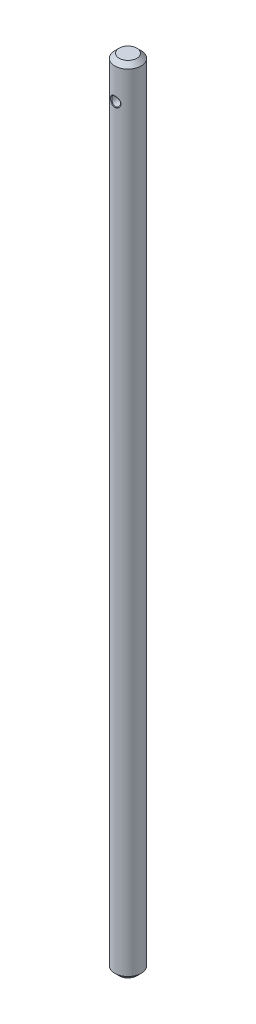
ISO-10303-21;
HEADER;
FILE_DESCRIPTION(('STEP AP214'),'2;1');
FILE_NAME('part.step','',(''),(''),'','','');
FILE_SCHEMA(('AUTOMOTIVE_DESIGN { 1 0 10303 214 1 1 1 1 }'));
ENDSEC;
DATA;
#1=APPLICATION_CONTEXT('core data for automotive mechanical design processes');
#2=APPLICATION_PROTOCOL_DEFINITION('international standard','automotive_design',2000,#1);
#3=PRODUCT_CONTEXT('',#1,'mechanical');
#4=PRODUCT('Part','Part','',(#3));
#5=PRODUCT_RELATED_PRODUCT_CATEGORY('part','',(#4));
#6=PRODUCT_DEFINITION_FORMATION('','',#4);
#7=PRODUCT_DEFINITION_CONTEXT('part definition',#1,'design');
#8=PRODUCT_DEFINITION('design','',#6,#7);
#9=PRODUCT_DEFINITION_SHAPE('','',#8);
#10=(LENGTH_UNIT() NAMED_UNIT(*) SI_UNIT(.MILLI.,.METRE.));
#11=(NAMED_UNIT(*) PLANE_ANGLE_UNIT() SI_UNIT($,.RADIAN.));
#12=(NAMED_UNIT(*) SI_UNIT($,.STERADIAN.) SOLID_ANGLE_UNIT());
#13=UNCERTAINTY_MEASURE_WITH_UNIT(LENGTH_MEASURE(1.E-05),#10,'distance_accuracy_value','');
#14=(GEOMETRIC_REPRESENTATION_CONTEXT(3) GLOBAL_UNCERTAINTY_ASSIGNED_CONTEXT((#13)) GLOBAL_UNIT_ASSIGNED_CONTEXT((#10,
#11,#12)) REPRESENTATION_CONTEXT('',''));
#15=CARTESIAN_POINT('',(0.,0.,0.));
#16=DIRECTION('',(0.,0.,1.));
#17=DIRECTION('',(1.,0.,0.));
#18=AXIS2_PLACEMENT_3D('',#15,#16,#17);
#19=CARTESIAN_POINT('',(-0.999999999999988,90.,0.));
#20=DIRECTION('',(0.,1.,0.));
#21=DIRECTION('',(-1.,0.,0.));
#22=AXIS2_PLACEMENT_3D('',#19,#20,#21);
#23=PLANE('',#22);
#24=CARTESIAN_POINT('',(0.,90.,0.));
#25=DIRECTION('',(0.,1.,0.));
#26=DIRECTION('',(-1.,0.,0.));
#27=AXIS2_PLACEMENT_3D('',#24,#25,#26);
#28=CIRCLE('',#27,0.999999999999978);
#29=CARTESIAN_POINT('',(-0.999999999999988,90.,0.));
#30=VERTEX_POINT('',#29);
#31=EDGE_CURVE('E57',#30,#30,#28,.T.);
#32=ORIENTED_EDGE('',*,*,#31,.T.);
#33=EDGE_LOOP('',(#32));
#34=FACE_BOUND('',#33,.T.);
#35=ADVANCED_FACE('F30',(#34),#23,.T.);
#36=CARTESIAN_POINT('',(0.,90.,0.));
#37=DIRECTION('',(0.,-1.,0.));
#38=DIRECTION('',(1.,0.,0.));
#39=AXIS2_PLACEMENT_3D('',#36,#37,#38);
#40=CONICAL_SURFACE('',#39,0.999999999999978,0.785398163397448);
#41=CARTESIAN_POINT('',(0.,89.5,0.));
#42=DIRECTION('',(0.,1.,0.));
#43=DIRECTION('',(-1.,0.,0.));
#44=AXIS2_PLACEMENT_3D('',#41,#42,#43);
#45=CIRCLE('',#44,1.49999999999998);
#46=CARTESIAN_POINT('',(-1.49999999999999,89.5,0.));
#47=VERTEX_POINT('',#46);
#48=EDGE_CURVE('E62',#47,#47,#45,.T.);
#49=ORIENTED_EDGE('',*,*,#48,.T.);
#50=EDGE_LOOP('',(#49));
#51=FACE_BOUND('',#50,.T.);
#52=ORIENTED_EDGE('',*,*,#31,.F.);
#53=EDGE_LOOP('',(#52));
#54=FACE_BOUND('',#53,.T.);
#55=ADVANCED_FACE('F110',(#51,#54),#40,.T.);
#56=CARTESIAN_POINT('',(0.,90.,0.));
#57=DIRECTION('',(0.,1.,0.));
#58=DIRECTION('',(-1.,0.,0.));
#59=AXIS2_PLACEMENT_3D('',#56,#57,#58);
#60=CYLINDRICAL_SURFACE('',#59,1.49999999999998);
#61=CARTESIAN_POINT('',(0.590285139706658,86.,-1.3789718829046));
#62=CARTESIAN_POINT('',(0.590285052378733,85.99045801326,-1.37897192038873));
#63=CARTESIAN_POINT('',(0.590039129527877,85.9809749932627,-1.3790772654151));
#64=CARTESIAN_POINT('',(0.589066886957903,85.9620822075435,-1.3794928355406));
#65=CARTESIAN_POINT('',(0.588340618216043,85.9526795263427,-1.37980302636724));
#66=CARTESIAN_POINT('',(0.585453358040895,85.9246001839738,-1.38103178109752));
#67=CARTESIAN_POINT('',(0.582585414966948,85.9060519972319,-1.38224861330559));
#68=CARTESIAN_POINT('',(0.574983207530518,85.8692921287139,-1.38542818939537));
#69=CARTESIAN_POINT('',(0.570248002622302,85.8510818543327,-1.38739129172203));
#70=CARTESIAN_POINT('',(0.561720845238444,85.8240163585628,-1.39085557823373));
#71=CARTESIAN_POINT('',(0.558629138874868,85.8150124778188,-1.39210134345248));
#72=CARTESIAN_POINT('',(0.552022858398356,85.7972551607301,-1.39473416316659));
#73=CARTESIAN_POINT('',(0.548509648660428,85.7884978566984,-1.39612075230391));
#74=CARTESIAN_POINT('',(0.537365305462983,85.7626198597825,-1.40046489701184));
#75=CARTESIAN_POINT('',(0.52911150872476,85.7458243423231,-1.40361464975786));
#76=CARTESIAN_POINT('',(0.511017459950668,85.713178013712,-1.41030285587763));
#77=CARTESIAN_POINT('',(0.501170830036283,85.6973120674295,-1.41384389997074));
#78=CARTESIAN_POINT('',(0.485202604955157,85.6742028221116,-1.41936965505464));
#79=CARTESIAN_POINT('',(0.479673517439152,85.666607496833,-1.42124932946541));
#80=CARTESIAN_POINT('',(0.468218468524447,85.6516600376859,-1.42506421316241));
#81=CARTESIAN_POINT('',(0.462266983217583,85.6442781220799,-1.42700754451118));
#82=CARTESIAN_POINT('',(0.450032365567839,85.6298483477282,-1.43091301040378));
#83=CARTESIAN_POINT('',(0.443760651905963,85.6228106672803,-1.43287183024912));
#84=CARTESIAN_POINT('',(0.430899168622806,85.6090668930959,-1.43679194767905));
#85=CARTESIAN_POINT('',(0.424311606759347,85.6023632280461,-1.43875257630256));
#86=CARTESIAN_POINT('',(0.404080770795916,85.5827486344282,-1.4446161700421));
#87=CARTESIAN_POINT('',(0.389970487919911,85.570332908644,-1.44850092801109));
#88=CARTESIAN_POINT('',(0.367856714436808,85.5526927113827,-1.45421434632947));
#89=CARTESIAN_POINT('',(0.360327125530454,85.5469768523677,-1.45609992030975));
#90=CARTESIAN_POINT('',(0.344945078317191,85.5358764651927,-1.45982036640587));
#91=CARTESIAN_POINT('',(0.337092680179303,85.5304921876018,-1.46165518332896));
#92=CARTESIAN_POINT('',(0.321056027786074,85.5200595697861,-1.46526133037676));
#93=CARTESIAN_POINT('',(0.312860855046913,85.5150071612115,-1.46703430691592));
#94=CARTESIAN_POINT('',(0.296319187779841,85.5053546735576,-1.47046457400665));
#95=CARTESIAN_POINT('',(0.287935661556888,85.5007299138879,-1.47213035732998));
#96=CARTESIAN_POINT('',(0.262502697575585,85.48748859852,-1.47695280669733));
#97=CARTESIAN_POINT('',(0.245127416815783,85.4794745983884,-1.47994473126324));
#98=CARTESIAN_POINT('',(0.20955450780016,85.4650931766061,-1.48539915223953));
#99=CARTESIAN_POINT('',(0.191348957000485,85.4587229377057,-1.48786282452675));
#100=CARTESIAN_POINT('',(0.163397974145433,85.4504355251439,-1.49110359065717));
#101=CARTESIAN_POINT('',(0.153947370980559,85.4478804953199,-1.49210973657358));
#102=CARTESIAN_POINT('',(0.134944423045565,85.4432347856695,-1.49394812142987));
#103=CARTESIAN_POINT('',(0.125418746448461,85.4411487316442,-1.4947784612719));
#104=CARTESIAN_POINT('',(0.0967819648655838,85.4355972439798,-1.49699639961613));
#105=CARTESIAN_POINT('',(0.0775562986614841,85.4328178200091,-1.49811846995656));
#106=CARTESIAN_POINT('',(0.0389117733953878,85.4291064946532,-1.4996198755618));
#107=CARTESIAN_POINT('',(0.0194662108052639,85.4281723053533,-1.50000013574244));
#108=CARTESIAN_POINT('',(-0.00982631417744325,85.4281728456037,-1.49999993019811));
#109=CARTESIAN_POINT('',(-0.0196261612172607,85.4284093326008,-1.49990380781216));
#110=CARTESIAN_POINT('',(-0.0392944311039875,85.4293612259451,-1.4995175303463));
#111=CARTESIAN_POINT('',(-0.049121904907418,85.4300764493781,-1.49922745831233));
#112=CARTESIAN_POINT('',(-0.0783327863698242,85.4329145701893,-1.4980793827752));
#113=CARTESIAN_POINT('',(-0.0975567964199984,85.4357247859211,-1.49694513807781));
#114=CARTESIAN_POINT('',(-0.13550031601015,85.4431266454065,-1.49398855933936));
#115=CARTESIAN_POINT('',(-0.154223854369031,85.4477172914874,-1.49216655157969));
#116=CARTESIAN_POINT('',(-0.181941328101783,85.455932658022,-1.48895395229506));
#117=CARTESIAN_POINT('',(-0.191119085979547,85.4588930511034,-1.48780311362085));
#118=CARTESIAN_POINT('',(-0.209351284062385,85.4652619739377,-1.48534731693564));
#119=CARTESIAN_POINT('',(-0.218400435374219,85.4686683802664,-1.4840431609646));
#120=CARTESIAN_POINT('',(-0.236395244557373,85.4759453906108,-1.48128327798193));
#121=CARTESIAN_POINT('',(-0.245286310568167,85.4797953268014,-1.47983554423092));
#122=CARTESIAN_POINT('',(-0.262751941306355,85.4878616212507,-1.47683439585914));
#123=CARTESIAN_POINT('',(-0.271349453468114,85.4920872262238,-1.47527747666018));
#124=CARTESIAN_POINT('',(-0.296725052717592,85.50532108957,-1.47045934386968));
#125=CARTESIAN_POINT('',(-0.313102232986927,85.514891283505,-1.46704834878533));
#126=CARTESIAN_POINT('',(-0.34480340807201,85.5355023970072,-1.45992281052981));
#127=CARTESIAN_POINT('',(-0.360136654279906,85.5465519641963,-1.45620535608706));
#128=CARTESIAN_POINT('',(-0.38232585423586,85.5642262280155,-1.45047777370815));
#129=CARTESIAN_POINT('',(-0.389594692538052,85.5703098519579,-1.44854090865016));
#130=CARTESIAN_POINT('',(-0.403875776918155,85.5828672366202,-1.4446242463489));
#131=CARTESIAN_POINT('',(-0.410857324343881,85.5893157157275,-1.4426526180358));
#132=CARTESIAN_POINT('',(-0.431198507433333,85.6090464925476,-1.43675545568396));
#133=CARTESIAN_POINT('',(-0.444024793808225,85.6227641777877,-1.43283052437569));
#134=CARTESIAN_POINT('',(-0.468230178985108,85.6513099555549,-1.42510419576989));
#135=CARTESIAN_POINT('',(-0.479613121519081,85.6661402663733,-1.42130166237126));
#136=CARTESIAN_POINT('',(-0.500933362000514,85.6969424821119,-1.41392823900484));
#137=CARTESIAN_POINT('',(-0.510879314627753,85.7129293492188,-1.41035398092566));
#138=CARTESIAN_POINT('',(-0.529241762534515,85.7460587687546,-1.40356644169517));
#139=CARTESIAN_POINT('',(-0.537512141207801,85.7629325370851,-1.40040842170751));
#140=CARTESIAN_POINT('',(-0.552313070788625,85.7973584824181,-1.39463737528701));
#141=CARTESIAN_POINT('',(-0.558837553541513,85.8148999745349,-1.39202646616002));
#142=CARTESIAN_POINT('',(-0.570124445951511,85.8506549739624,-1.38744197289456));
#143=CARTESIAN_POINT('',(-0.574885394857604,85.8688675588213,-1.38546896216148));
#144=CARTESIAN_POINT('',(-0.580660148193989,85.8967187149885,-1.3830539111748));
#145=CARTESIAN_POINT('',(-0.582358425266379,85.9061194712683,-1.38233901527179));
#146=CARTESIAN_POINT('',(-0.585256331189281,85.9249155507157,-1.38111458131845));
#147=CARTESIAN_POINT('',(-0.586459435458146,85.9343150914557,-1.38060364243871));
#148=CARTESIAN_POINT('',(-0.589332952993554,85.9624730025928,-1.3793806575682));
#149=CARTESIAN_POINT('',(-0.590286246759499,85.9812633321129,-1.37897140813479));
#150=CARTESIAN_POINT('',(-0.590284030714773,86.0188022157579,-1.37897235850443));
#151=CARTESIAN_POINT('',(-0.589330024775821,86.0375702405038,-1.37938191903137));
#152=CARTESIAN_POINT('',(-0.586458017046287,86.0656915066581,-1.38060423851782));
#153=CARTESIAN_POINT('',(-0.585257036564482,86.0750748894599,-1.38111427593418));
#154=CARTESIAN_POINT('',(-0.582370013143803,86.0938103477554,-1.38233412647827));
#155=CARTESIAN_POINT('',(-0.580672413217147,86.1032157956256,-1.38304877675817));
#156=CARTESIAN_POINT('',(-0.576816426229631,86.121825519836,-1.38466139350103));
#157=CARTESIAN_POINT('',(-0.574660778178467,86.1310322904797,-1.38555823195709));
#158=CARTESIAN_POINT('',(-0.569902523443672,86.1492659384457,-1.38752215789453));
#159=CARTESIAN_POINT('',(-0.567300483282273,86.1582910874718,-1.3885890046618));
#160=CARTESIAN_POINT('',(-0.558837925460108,86.1850984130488,-1.39202631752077));
#161=CARTESIAN_POINT('',(-0.552322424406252,86.2026129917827,-1.39463353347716));
#162=CARTESIAN_POINT('',(-0.537565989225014,86.2369489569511,-1.40038761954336));
#163=CARTESIAN_POINT('',(-0.529323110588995,86.253771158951,-1.40353518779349));
#164=CARTESIAN_POINT('',(-0.515645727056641,86.2784825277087,-1.40859269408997));
#165=CARTESIAN_POINT('',(-0.510852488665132,86.2866525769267,-1.41033960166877));
#166=CARTESIAN_POINT('',(-0.500885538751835,86.3027086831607,-1.41391006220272));
#167=CARTESIAN_POINT('',(-0.495722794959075,86.3105807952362,-1.41572985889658));
#168=CARTESIAN_POINT('',(-0.479713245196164,86.3337241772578,-1.42126784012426));
#169=CARTESIAN_POINT('',(-0.468320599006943,86.3485750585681,-1.4250743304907));
#170=CARTESIAN_POINT('',(-0.444148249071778,86.3770985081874,-1.43279211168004));
#171=CARTESIAN_POINT('',(-0.431357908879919,86.3907855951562,-1.43670713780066));
#172=CARTESIAN_POINT('',(-0.411116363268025,86.4104395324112,-1.44257855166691));
#173=CARTESIAN_POINT('',(-0.404182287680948,86.4168528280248,-1.44453827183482));
#174=CARTESIAN_POINT('',(-0.38996651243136,86.4293731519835,-1.44844076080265));
#175=CARTESIAN_POINT('',(-0.382655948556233,86.4355026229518,-1.45039086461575));
#176=CARTESIAN_POINT('',(-0.360333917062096,86.4533068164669,-1.45615773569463));
#177=CARTESIAN_POINT('',(-0.344962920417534,86.4643884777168,-1.45988560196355));
#178=CARTESIAN_POINT('',(-0.313179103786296,86.4850641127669,-1.46703241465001));
#179=CARTESIAN_POINT('',(-0.296777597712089,86.4946497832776,-1.47044887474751));
#180=CARTESIAN_POINT('',(-0.26292937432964,86.5123057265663,-1.47687671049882));
#181=CARTESIAN_POINT('',(-0.24548995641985,86.5203733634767,-1.47988727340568));
#182=CARTESIAN_POINT('',(-0.209478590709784,86.5349429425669,-1.4854126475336));
#183=CARTESIAN_POINT('',(-0.191202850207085,86.5413228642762,-1.48788071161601));
#184=CARTESIAN_POINT('',(-0.154168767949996,86.5522984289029,-1.49217271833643));
#185=CARTESIAN_POINT('',(-0.135401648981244,86.556897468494,-1.49399811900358));
#186=CARTESIAN_POINT('',(-0.106871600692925,86.5624556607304,-1.49621837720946));
#187=CARTESIAN_POINT('',(-0.0972982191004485,86.5640846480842,-1.49687216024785));
#188=CARTESIAN_POINT('',(-0.0780225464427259,86.5668887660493,-1.4980005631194));
#189=CARTESIAN_POINT('',(-0.0683192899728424,86.5680637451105,-1.49847511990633));
#190=CARTESIAN_POINT('',(-0.0487846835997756,86.569950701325,-1.49923845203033));
#191=CARTESIAN_POINT('',(-0.0389305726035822,86.570661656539,-1.49952681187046));
#192=CARTESIAN_POINT('',(-0.0193521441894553,86.5715984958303,-1.4999069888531));
#193=CARTESIAN_POINT('',(-0.00957388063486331,86.5718303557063,-1.50000123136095));
#194=CARTESIAN_POINT('',(0.0196476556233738,86.5718212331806,-1.499997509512));
#195=CARTESIAN_POINT('',(0.03904633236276,86.5708839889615,-1.49961601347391));
#196=CARTESIAN_POINT('',(0.07763410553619,86.5671712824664,-1.49811407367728));
#197=CARTESIAN_POINT('',(0.0968441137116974,86.5643924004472,-1.49699224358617));
#198=CARTESIAN_POINT('',(0.125474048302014,86.5588396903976,-1.4947738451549));
#199=CARTESIAN_POINT('',(0.134998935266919,86.5567529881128,-1.49394326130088));
#200=CARTESIAN_POINT('',(0.154013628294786,86.5521021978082,-1.49210291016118));
#201=CARTESIAN_POINT('',(0.163445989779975,86.5495508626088,-1.49109825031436));
#202=CARTESIAN_POINT('',(0.191344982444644,86.5412769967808,-1.48786283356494));
#203=CARTESIAN_POINT('',(0.209510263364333,86.5349211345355,-1.48540475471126));
#204=CARTESIAN_POINT('',(0.244979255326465,86.5205888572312,-1.4799686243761));
#205=CARTESIAN_POINT('',(0.262288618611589,86.5126121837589,-1.47699026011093));
#206=CARTESIAN_POINT('',(0.287626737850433,86.4994361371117,-1.47219046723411));
#207=CARTESIAN_POINT('',(0.295968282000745,86.4948419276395,-1.47053511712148));
#208=CARTESIAN_POINT('',(0.312442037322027,86.4852450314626,-1.46712328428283));
#209=CARTESIAN_POINT('',(0.320569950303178,86.4802450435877,-1.46536772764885));
#210=CARTESIAN_POINT('',(0.336631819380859,86.4698185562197,-1.46176155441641));
#211=CARTESIAN_POINT('',(0.344536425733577,86.4644089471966,-1.45991704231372));
#212=CARTESIAN_POINT('',(0.359964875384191,86.4532935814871,-1.4561895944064));
#213=CARTESIAN_POINT('',(0.367517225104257,86.4475694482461,-1.45430027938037));
#214=CARTESIAN_POINT('',(0.389665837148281,86.4299268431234,-1.44858308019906));
#215=CARTESIAN_POINT('',(0.403779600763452,86.4175231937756,-1.44470018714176));
#216=CARTESIAN_POINT('',(0.430720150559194,86.3914431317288,-1.43689835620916));
#217=CARTESIAN_POINT('',(0.443556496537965,86.3777535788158,-1.4329759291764));
#218=CARTESIAN_POINT('',(0.467907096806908,86.3491045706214,-1.4252112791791));
#219=CARTESIAN_POINT('',(0.479498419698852,86.3340215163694,-1.42134108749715));
#220=CARTESIAN_POINT('',(0.500903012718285,86.3031052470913,-1.41393897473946));
#221=CARTESIAN_POINT('',(0.510797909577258,86.2871914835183,-1.41038261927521));
#222=CARTESIAN_POINT('',(0.528956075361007,86.2544821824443,-1.40367346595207));
#223=CARTESIAN_POINT('',(0.537229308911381,86.2376700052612,-1.40051715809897));
#224=CARTESIAN_POINT('',(0.548392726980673,86.211786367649,-1.39616669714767));
#225=CARTESIAN_POINT('',(0.5519105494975,86.2030311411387,-1.39477861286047));
#226=CARTESIAN_POINT('',(0.558521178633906,86.1852928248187,-1.39214466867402));
#227=CARTESIAN_POINT('',(0.561617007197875,86.1762942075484,-1.39089751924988));
#228=CARTESIAN_POINT('',(0.570162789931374,86.1492254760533,-1.38742638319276));
#229=CARTESIAN_POINT('',(0.574911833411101,86.1310058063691,-1.38545785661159));
#230=CARTESIAN_POINT('',(0.582542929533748,86.0941999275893,-1.38226656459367));
#231=CARTESIAN_POINT('',(0.585425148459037,86.0756149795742,-1.38104375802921));
#232=CARTESIAN_POINT('',(0.588328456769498,86.0474679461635,-1.37980821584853));
#233=CARTESIAN_POINT('',(0.589059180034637,86.03803465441,-1.37949612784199));
#234=CARTESIAN_POINT('',(0.590037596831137,86.019087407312,-1.37907792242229));
#235=CARTESIAN_POINT('',(0.590285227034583,86.0095419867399,-1.37897184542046));
#236=CARTESIAN_POINT('',(0.590285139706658,86.,-1.3789718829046));
#237=B_SPLINE_CURVE_WITH_KNOTS('',3,(#61,#62,#63,#64,#65,#66,#67,#68,#69,#70,#71,#72,#73,#74,
#75,#76,#77,#78,#79,#80,#81,#82,#83,#84,#85,#86,#87,#88,#89,#90,#91,#92,#93,#94,#95,#96,#97,#98,
#99,#100,#101,#102,#103,#104,#105,#106,#107,#108,#109,#110,#111,#112,#113,#114,#115,#116,#117,
#118,#119,#120,#121,#122,#123,#124,#125,#126,#127,#128,#129,#130,#131,#132,#133,#134,#135,#136,
#137,#138,#139,#140,#141,#142,#143,#144,#145,#146,#147,#148,#149,#150,#151,#152,#153,#154,#155,
#156,#157,#158,#159,#160,#161,#162,#163,#164,#165,#166,#167,#168,#169,#170,#171,#172,#173,#174,
#175,#176,#177,#178,#179,#180,#181,#182,#183,#184,#185,#186,#187,#188,#189,#190,#191,#192,#193,
#194,#195,#196,#197,#198,#199,#200,#201,#202,#203,#204,#205,#206,#207,#208,#209,#210,#211,#212,
#213,#214,#215,#216,#217,#218,#219,#220,#221,#222,#223,#224,#225,#226,#227,#228,#229,#230,#231,
#232,#233,#234,#235,#236),.UNSPECIFIED.,.T.,.F.,(4,2,2,2,2,2,2,2,2,2,2,2,2,2,2,2,2,2,2,2,2,2,2,
2,2,2,2,2,2,2,2,2,2,2,2,2,2,2,2,2,2,2,2,2,2,2,2,2,2,2,2,2,2,2,2,2,2,2,2,2,2,2,2,2,2,2,2,2,2,2,2,
2,2,2,2,2,2,2,2,2,2,2,2,2,2,2,2,4),(-6.58897955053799E-06,2.16479036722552E-05,
4.98847868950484E-05,0.000106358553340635,0.000162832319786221,0.000191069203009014,
0.000219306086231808,0.000275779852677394,0.00033225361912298,0.000360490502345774,
0.000388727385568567,0.00041696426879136,0.000445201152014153,0.000501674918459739,
0.000529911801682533,0.000558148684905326,0.000586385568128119,0.000614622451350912,
0.000671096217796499,0.000727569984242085,0.000755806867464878,0.000784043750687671,
0.000840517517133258,0.000896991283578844,0.000925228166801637,0.000953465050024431,
0.00100993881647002,0.0010664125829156,0.0010946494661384,0.00112288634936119,
0.00115112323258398,0.00117936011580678,0.00123583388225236,0.00129230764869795,
0.00132054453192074,0.00134878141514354,0.00140525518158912,0.00146172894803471,
0.00151820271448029,0.00157467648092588,0.00163115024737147,0.00168762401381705,
0.00171586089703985,0.00174409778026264,0.00180057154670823,0.00185704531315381,
0.00188528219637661,0.0019135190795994,0.00194175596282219,0.00196999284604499,
0.00202646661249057,0.00208294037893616,0.00211117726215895,0.00213941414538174,
0.00219588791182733,0.00225236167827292,0.00228059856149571,0.0023088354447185,
0.00236530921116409,0.00242178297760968,0.00247825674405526,0.00253473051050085,
0.00259120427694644,0.00261944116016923,0.00264767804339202,0.00267591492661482,
0.00270415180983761,0.00276062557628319,0.00281709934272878,0.00284533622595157,
0.00287357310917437,0.00293004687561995,0.00298652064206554,0.00301475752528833,
0.00304299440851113,0.00307123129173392,0.00309946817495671,0.0031559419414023,
0.00321241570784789,0.00326888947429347,0.00332536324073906,0.00338183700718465,
0.00341007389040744,0.00343831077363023,0.00349478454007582,0.0035512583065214,
0.0035794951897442,0.00360773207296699),.UNSPECIFIED.);
#238=CARTESIAN_POINT('',(0.590285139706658,86.,-1.3789718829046));
#239=VERTEX_POINT('',#238);
#240=EDGE_CURVE('E10',#239,#239,#237,.F.);
#241=ORIENTED_EDGE('',*,*,#240,.T.);
#242=EDGE_LOOP('',(#241));
#243=FACE_BOUND('',#242,.T.);
#244=CARTESIAN_POINT('',(0.590285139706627,86.,1.37897188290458));
#245=CARTESIAN_POINT('',(0.590285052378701,86.00954198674,1.37897192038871));
#246=CARTESIAN_POINT('',(0.590039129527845,86.0190250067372,1.37907726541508));
#247=CARTESIAN_POINT('',(0.589066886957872,86.0379177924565,1.37949283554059));
#248=CARTESIAN_POINT('',(0.588340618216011,86.0473204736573,1.37980302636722));
#249=CARTESIAN_POINT('',(0.585453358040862,86.0753998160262,1.3810317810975));
#250=CARTESIAN_POINT('',(0.582585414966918,86.0939480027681,1.38224861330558));
#251=CARTESIAN_POINT('',(0.574983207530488,86.1307078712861,1.38542818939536));
#252=CARTESIAN_POINT('',(0.57024800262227,86.1489181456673,1.38739129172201));
#253=CARTESIAN_POINT('',(0.561720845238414,86.1759836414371,1.39085557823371));
#254=CARTESIAN_POINT('',(0.558629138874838,86.1849875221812,1.39210134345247));
#255=CARTESIAN_POINT('',(0.552022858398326,86.2027448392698,1.39473416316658));
#256=CARTESIAN_POINT('',(0.548509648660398,86.2115021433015,1.3961207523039));
#257=CARTESIAN_POINT('',(0.537365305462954,86.2373801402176,1.40046489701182));
#258=CARTESIAN_POINT('',(0.529111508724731,86.2541756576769,1.40361464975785));
#259=CARTESIAN_POINT('',(0.511017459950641,86.286821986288,1.41030285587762));
#260=CARTESIAN_POINT('',(0.501170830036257,86.3026879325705,1.41384389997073));
#261=CARTESIAN_POINT('',(0.485202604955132,86.3257971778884,1.41936965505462));
#262=CARTESIAN_POINT('',(0.479673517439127,86.333392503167,1.42124932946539));
#263=CARTESIAN_POINT('',(0.468218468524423,86.348339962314,1.4250642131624));
#264=CARTESIAN_POINT('',(0.462266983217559,86.3557218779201,1.42700754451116));
#265=CARTESIAN_POINT('',(0.450032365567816,86.3701516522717,1.43091301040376));
#266=CARTESIAN_POINT('',(0.44376065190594,86.3771893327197,1.4328718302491));
#267=CARTESIAN_POINT('',(0.430899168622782,86.3909331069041,1.43679194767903));
#268=CARTESIAN_POINT('',(0.424311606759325,86.3976367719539,1.43875257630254));
#269=CARTESIAN_POINT('',(0.404080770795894,86.4172513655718,1.44461617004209));
#270=CARTESIAN_POINT('',(0.389970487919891,86.429667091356,1.44850092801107));
#271=CARTESIAN_POINT('',(0.367856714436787,86.4473072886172,1.45421434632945));
#272=CARTESIAN_POINT('',(0.360327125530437,86.4530231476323,1.45609992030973));
#273=CARTESIAN_POINT('',(0.344945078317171,86.4641235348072,1.45982036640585));
#274=CARTESIAN_POINT('',(0.337092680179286,86.4695078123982,1.46165518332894));
#275=CARTESIAN_POINT('',(0.321056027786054,86.4799404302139,1.46526133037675));
#276=CARTESIAN_POINT('',(0.312860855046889,86.4849928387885,1.46703430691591));
#277=CARTESIAN_POINT('',(0.29631918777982,86.4946453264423,1.47046457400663));
#278=CARTESIAN_POINT('',(0.287935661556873,86.4992700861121,1.47213035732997));
#279=CARTESIAN_POINT('',(0.262502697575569,86.51251140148,1.47695280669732));
#280=CARTESIAN_POINT('',(0.245127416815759,86.5205254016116,1.47994473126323));
#281=CARTESIAN_POINT('',(0.209554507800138,86.5349068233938,1.48539915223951));
#282=CARTESIAN_POINT('',(0.191348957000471,86.5412770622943,1.48786282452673));
#283=CARTESIAN_POINT('',(0.163397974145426,86.549564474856,1.49110359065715));
#284=CARTESIAN_POINT('',(0.153947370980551,86.5521195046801,1.49210973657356));
#285=CARTESIAN_POINT('',(0.134944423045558,86.5567652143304,1.49394812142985));
#286=CARTESIAN_POINT('',(0.125418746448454,86.5588512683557,1.49477846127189));
#287=CARTESIAN_POINT('',(0.0967819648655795,86.5644027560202,1.49699639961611));
#288=CARTESIAN_POINT('',(0.0775562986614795,86.5671821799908,1.49811846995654));
#289=CARTESIAN_POINT('',(0.0389117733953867,86.5708935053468,1.49961987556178));
#290=CARTESIAN_POINT('',(0.0194662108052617,86.5718276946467,1.50000013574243));
#291=CARTESIAN_POINT('',(-0.00982631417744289,86.5718271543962,1.4999999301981));
#292=CARTESIAN_POINT('',(-0.0196261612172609,86.5715906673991,1.49990380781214));
#293=CARTESIAN_POINT('',(-0.039294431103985,86.5706387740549,1.49951753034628));
#294=CARTESIAN_POINT('',(-0.0491219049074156,86.5699235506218,1.49922745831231));
#295=CARTESIAN_POINT('',(-0.0783327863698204,86.5670854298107,1.49807938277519));
#296=CARTESIAN_POINT('',(-0.0975567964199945,86.5642752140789,1.49694513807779));
#297=CARTESIAN_POINT('',(-0.135500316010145,86.5568733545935,1.49398855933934));
#298=CARTESIAN_POINT('',(-0.15422385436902,86.5522827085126,1.49216655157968));
#299=CARTESIAN_POINT('',(-0.181941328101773,86.544067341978,1.48895395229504));
#300=CARTESIAN_POINT('',(-0.191119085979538,86.5411069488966,1.48780311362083));
#301=CARTESIAN_POINT('',(-0.209351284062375,86.5347380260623,1.48534731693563));
#302=CARTESIAN_POINT('',(-0.218400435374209,86.5313316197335,1.48404316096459));
#303=CARTESIAN_POINT('',(-0.23639524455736,86.5240546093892,1.48128327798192));
#304=CARTESIAN_POINT('',(-0.245286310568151,86.5202046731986,1.47983554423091));
#305=CARTESIAN_POINT('',(-0.262751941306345,86.5121383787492,1.47683439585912));
#306=CARTESIAN_POINT('',(-0.271349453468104,86.5079127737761,1.47527747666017));
#307=CARTESIAN_POINT('',(-0.296725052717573,86.49467891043,1.47045934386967));
#308=CARTESIAN_POINT('',(-0.313102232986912,86.4851087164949,1.46704834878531));
#309=CARTESIAN_POINT('',(-0.344803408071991,86.4644976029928,1.4599228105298));
#310=CARTESIAN_POINT('',(-0.36013665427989,86.4534480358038,1.45620535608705));
#311=CARTESIAN_POINT('',(-0.382325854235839,86.4357737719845,1.45047777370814));
#312=CARTESIAN_POINT('',(-0.389594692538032,86.4296901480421,1.44854090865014));
#313=CARTESIAN_POINT('',(-0.403875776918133,86.4171327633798,1.44462424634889));
#314=CARTESIAN_POINT('',(-0.41085732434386,86.4106842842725,1.44265261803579));
#315=CARTESIAN_POINT('',(-0.431198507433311,86.3909535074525,1.43675545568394));
#316=CARTESIAN_POINT('',(-0.444024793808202,86.3772358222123,1.43283052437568));
#317=CARTESIAN_POINT('',(-0.468230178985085,86.3486900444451,1.42510419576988));
#318=CARTESIAN_POINT('',(-0.479613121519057,86.3338597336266,1.42130166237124));
#319=CARTESIAN_POINT('',(-0.500933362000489,86.303057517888,1.41392823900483));
#320=CARTESIAN_POINT('',(-0.510879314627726,86.2870706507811,1.41035398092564));
#321=CARTESIAN_POINT('',(-0.529241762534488,86.2539412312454,1.40356644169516));
#322=CARTESIAN_POINT('',(-0.537512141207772,86.2370674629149,1.40040842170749));
#323=CARTESIAN_POINT('',(-0.552313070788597,86.2026415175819,1.394637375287));
#324=CARTESIAN_POINT('',(-0.558837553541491,86.1851000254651,1.39202646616));
#325=CARTESIAN_POINT('',(-0.570124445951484,86.1493450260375,1.38744197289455));
#326=CARTESIAN_POINT('',(-0.574885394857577,86.1311324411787,1.38546896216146));
#327=CARTESIAN_POINT('',(-0.580660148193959,86.1032812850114,1.38305391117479));
#328=CARTESIAN_POINT('',(-0.582358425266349,86.0938805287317,1.38233901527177));
#329=CARTESIAN_POINT('',(-0.58525633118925,86.0750844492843,1.38111458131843));
#330=CARTESIAN_POINT('',(-0.586459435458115,86.0656849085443,1.38060364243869));
#331=CARTESIAN_POINT('',(-0.589332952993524,86.0375269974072,1.37938065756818));
#332=CARTESIAN_POINT('',(-0.590286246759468,86.0187366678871,1.37897140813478));
#333=CARTESIAN_POINT('',(-0.590284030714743,85.9811977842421,1.37897235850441));
#334=CARTESIAN_POINT('',(-0.589330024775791,85.9624297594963,1.37938191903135));
#335=CARTESIAN_POINT('',(-0.586458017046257,85.9343084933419,1.38060423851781));
#336=CARTESIAN_POINT('',(-0.585257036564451,85.9249251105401,1.38111427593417));
#337=CARTESIAN_POINT('',(-0.582370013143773,85.9061896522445,1.38233412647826));
#338=CARTESIAN_POINT('',(-0.580672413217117,85.8967842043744,1.38304877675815));
#339=CARTESIAN_POINT('',(-0.576816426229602,85.878174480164,1.38466139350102));
#340=CARTESIAN_POINT('',(-0.574660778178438,85.8689677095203,1.38555823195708));
#341=CARTESIAN_POINT('',(-0.569902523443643,85.8507340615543,1.38752215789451));
#342=CARTESIAN_POINT('',(-0.567300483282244,85.8417089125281,1.38858900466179));
#343=CARTESIAN_POINT('',(-0.55883792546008,85.8149015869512,1.39202631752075));
#344=CARTESIAN_POINT('',(-0.552322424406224,85.7973870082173,1.39463353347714));
#345=CARTESIAN_POINT('',(-0.537565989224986,85.7630510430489,1.40038761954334));
#346=CARTESIAN_POINT('',(-0.529323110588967,85.7462288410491,1.40353518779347));
#347=CARTESIAN_POINT('',(-0.515645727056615,85.7215174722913,1.40859269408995));
#348=CARTESIAN_POINT('',(-0.510852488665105,85.7133474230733,1.41033960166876));
#349=CARTESIAN_POINT('',(-0.500885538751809,85.6972913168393,1.4139100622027));
#350=CARTESIAN_POINT('',(-0.495722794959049,85.6894192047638,1.41572985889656));
#351=CARTESIAN_POINT('',(-0.47971324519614,85.6662758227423,1.42126784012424));
#352=CARTESIAN_POINT('',(-0.468320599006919,85.6514249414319,1.42507433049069));
#353=CARTESIAN_POINT('',(-0.444148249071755,85.6229014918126,1.43279211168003));
#354=CARTESIAN_POINT('',(-0.431357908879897,85.6092144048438,1.43670713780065));
#355=CARTESIAN_POINT('',(-0.411116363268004,85.5895604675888,1.44257855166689));
#356=CARTESIAN_POINT('',(-0.404182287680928,85.5831471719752,1.4445382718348));
#357=CARTESIAN_POINT('',(-0.38996651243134,85.5706268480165,1.44844076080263));
#358=CARTESIAN_POINT('',(-0.382655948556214,85.5644973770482,1.45039086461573));
#359=CARTESIAN_POINT('',(-0.360333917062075,85.5466931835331,1.45615773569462));
#360=CARTESIAN_POINT('',(-0.344962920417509,85.5356115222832,1.45988560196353));
#361=CARTESIAN_POINT('',(-0.313179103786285,85.5149358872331,1.46703241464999));
#362=CARTESIAN_POINT('',(-0.29677759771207,85.5053502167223,1.4704488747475));
#363=CARTESIAN_POINT('',(-0.26292937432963,85.4876942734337,1.47687671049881));
#364=CARTESIAN_POINT('',(-0.245489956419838,85.4796266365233,1.47988727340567));
#365=CARTESIAN_POINT('',(-0.209478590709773,85.4650570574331,1.48541264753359));
#366=CARTESIAN_POINT('',(-0.191202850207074,85.4586771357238,1.487880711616));
#367=CARTESIAN_POINT('',(-0.154168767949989,85.4477015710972,1.49217271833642));
#368=CARTESIAN_POINT('',(-0.135401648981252,85.4431025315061,1.49399811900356));
#369=CARTESIAN_POINT('',(-0.106871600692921,85.4375443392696,1.49621837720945));
#370=CARTESIAN_POINT('',(-0.097298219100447,85.4359153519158,1.49687216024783));
#371=CARTESIAN_POINT('',(-0.07802254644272,85.4331112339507,1.49800056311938));
#372=CARTESIAN_POINT('',(-0.0683192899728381,85.4319362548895,1.49847511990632));
#373=CARTESIAN_POINT('',(-0.0487846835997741,85.4300492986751,1.49923845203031));
#374=CARTESIAN_POINT('',(-0.0389305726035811,85.429338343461,1.49952681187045));
#375=CARTESIAN_POINT('',(-0.0193521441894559,85.4284015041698,1.49990698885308));
#376=CARTESIAN_POINT('',(-0.00957388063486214,85.4281696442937,1.50000123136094));
#377=CARTESIAN_POINT('',(0.0196476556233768,85.4281787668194,1.49999750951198));
#378=CARTESIAN_POINT('',(0.0390463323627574,85.4291160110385,1.49961601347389));
#379=CARTESIAN_POINT('',(0.0776341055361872,85.4328287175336,1.49811407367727));
#380=CARTESIAN_POINT('',(0.0968441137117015,85.4356075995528,1.49699224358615));
#381=CARTESIAN_POINT('',(0.125474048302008,85.4411603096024,1.49477384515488));
#382=CARTESIAN_POINT('',(0.134998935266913,85.4432470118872,1.49394326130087));
#383=CARTESIAN_POINT('',(0.154013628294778,85.4478978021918,1.49210291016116));
#384=CARTESIAN_POINT('',(0.163445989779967,85.4504491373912,1.49109825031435));
#385=CARTESIAN_POINT('',(0.191344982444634,85.4587230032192,1.48786283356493));
#386=CARTESIAN_POINT('',(0.20951026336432,85.4650788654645,1.48540475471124));
#387=CARTESIAN_POINT('',(0.244979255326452,85.4794111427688,1.47996862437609));
#388=CARTESIAN_POINT('',(0.262288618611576,85.4873878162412,1.47699026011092));
#389=CARTESIAN_POINT('',(0.287626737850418,85.5005638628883,1.4721904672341));
#390=CARTESIAN_POINT('',(0.295968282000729,85.5051580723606,1.47053511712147));
#391=CARTESIAN_POINT('',(0.31244203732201,85.5147549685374,1.46712328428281));
#392=CARTESIAN_POINT('',(0.320569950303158,85.5197549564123,1.46536772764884));
#393=CARTESIAN_POINT('',(0.336631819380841,85.5301814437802,1.4617615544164));
#394=CARTESIAN_POINT('',(0.344536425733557,85.5355910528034,1.4599170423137));
#395=CARTESIAN_POINT('',(0.359964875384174,85.5467064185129,1.45618959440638));
#396=CARTESIAN_POINT('',(0.367517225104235,85.5524305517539,1.45430027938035));
#397=CARTESIAN_POINT('',(0.389665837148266,85.5700731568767,1.44858308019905));
#398=CARTESIAN_POINT('',(0.403779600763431,85.5824768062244,1.44470018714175));
#399=CARTESIAN_POINT('',(0.430720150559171,85.6085568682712,1.43689835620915));
#400=CARTESIAN_POINT('',(0.44355649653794,85.6222464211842,1.43297592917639));
#401=CARTESIAN_POINT('',(0.467907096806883,85.6508954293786,1.42521127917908));
#402=CARTESIAN_POINT('',(0.479498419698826,85.6659784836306,1.42134108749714));
#403=CARTESIAN_POINT('',(0.500903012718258,85.6968947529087,1.41393897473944));
#404=CARTESIAN_POINT('',(0.510797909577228,85.7128085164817,1.4103826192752));
#405=CARTESIAN_POINT('',(0.528956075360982,85.7455178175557,1.40367346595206));
#406=CARTESIAN_POINT('',(0.537229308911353,85.7623299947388,1.40051715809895));
#407=CARTESIAN_POINT('',(0.548392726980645,85.788213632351,1.39616669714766));
#408=CARTESIAN_POINT('',(0.55191054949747,85.7969688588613,1.39477861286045));
#409=CARTESIAN_POINT('',(0.558521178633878,85.8147071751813,1.392144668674));
#410=CARTESIAN_POINT('',(0.561617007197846,85.8237057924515,1.39089751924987));
#411=CARTESIAN_POINT('',(0.570162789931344,85.8507745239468,1.38742638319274));
#412=CARTESIAN_POINT('',(0.574911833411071,85.8689941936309,1.38545785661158));
#413=CARTESIAN_POINT('',(0.582542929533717,85.9058000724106,1.38226656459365));
#414=CARTESIAN_POINT('',(0.585425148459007,85.9243850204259,1.3810437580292));
#415=CARTESIAN_POINT('',(0.588328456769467,85.9525320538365,1.37980821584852));
#416=CARTESIAN_POINT('',(0.589059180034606,85.96196534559,1.37949612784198));
#417=CARTESIAN_POINT('',(0.590037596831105,85.980912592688,1.37907792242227));
#418=CARTESIAN_POINT('',(0.590285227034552,85.9904580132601,1.37897184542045));
#419=CARTESIAN_POINT('',(0.590285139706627,86.,1.37897188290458));
#420=B_SPLINE_CURVE_WITH_KNOTS('',3,(#244,#245,#246,#247,#248,#249,#250,#251,#252,#253,#254,
#255,#256,#257,#258,#259,#260,#261,#262,#263,#264,#265,#266,#267,#268,#269,#270,#271,#272,#273,
#274,#275,#276,#277,#278,#279,#280,#281,#282,#283,#284,#285,#286,#287,#288,#289,#290,#291,#292,
#293,#294,#295,#296,#297,#298,#299,#300,#301,#302,#303,#304,#305,#306,#307,#308,#309,#310,#311,
#312,#313,#314,#315,#316,#317,#318,#319,#320,#321,#322,#323,#324,#325,#326,#327,#328,#329,#330,
#331,#332,#333,#334,#335,#336,#337,#338,#339,#340,#341,#342,#343,#344,#345,#346,#347,#348,#349,
#350,#351,#352,#353,#354,#355,#356,#357,#358,#359,#360,#361,#362,#363,#364,#365,#366,#367,#368,
#369,#370,#371,#372,#373,#374,#375,#376,#377,#378,#379,#380,#381,#382,#383,#384,#385,#386,#387,
#388,#389,#390,#391,#392,#393,#394,#395,#396,#397,#398,#399,#400,#401,#402,#403,#404,#405,#406,
#407,#408,#409,#410,#411,#412,#413,#414,#415,#416,#417,#418,#419),.UNSPECIFIED.,.T.,.F.,(4,2,2,
2,2,2,2,2,2,2,2,2,2,2,2,2,2,2,2,2,2,2,2,2,2,2,2,2,2,2,2,2,2,2,2,2,2,2,2,2,2,2,2,2,2,2,2,2,2,2,2,
2,2,2,2,2,2,2,2,2,2,2,2,2,2,2,2,2,2,2,2,2,2,2,2,2,2,2,2,2,2,2,2,2,2,2,2,4),
(-6.58897955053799E-06,2.16479036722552E-05,4.98847868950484E-05,0.000106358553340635,
0.000162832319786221,0.000191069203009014,0.000219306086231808,0.000275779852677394,
0.00033225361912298,0.000360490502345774,0.000388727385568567,0.00041696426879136,
0.000445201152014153,0.00050167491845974,0.000529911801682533,0.000558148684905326,
0.000586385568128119,0.000614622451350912,0.000671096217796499,0.000727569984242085,
0.000755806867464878,0.000784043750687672,0.000840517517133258,0.000896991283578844,
0.000925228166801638,0.000953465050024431,0.00100993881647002,0.0010664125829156,
0.0010946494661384,0.00112288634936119,0.00115112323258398,0.00117936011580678,
0.00123583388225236,0.00129230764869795,0.00132054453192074,0.00134878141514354,
0.00140525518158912,0.00146172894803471,0.00151820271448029,0.00157467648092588,
0.00163115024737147,0.00168762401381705,0.00171586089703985,0.00174409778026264,
0.00180057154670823,0.00185704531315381,0.00188528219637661,0.0019135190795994,
0.00194175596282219,0.00196999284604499,0.00202646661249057,0.00208294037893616,
0.00211117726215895,0.00213941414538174,0.00219588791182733,0.00225236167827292,
0.00228059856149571,0.0023088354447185,0.00236530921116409,0.00242178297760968,
0.00247825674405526,0.00253473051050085,0.00259120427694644,0.00261944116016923,
0.00264767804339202,0.00267591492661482,0.00270415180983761,0.0027606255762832,
0.00281709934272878,0.00284533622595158,0.00287357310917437,0.00293004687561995,
0.00298652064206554,0.00301475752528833,0.00304299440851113,0.00307123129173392,
0.00309946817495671,0.0031559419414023,0.00321241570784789,0.00326888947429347,
0.00332536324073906,0.00338183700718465,0.00341007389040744,0.00343831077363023,
0.00349478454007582,0.0035512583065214,0.0035794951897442,0.00360773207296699),.UNSPECIFIED.);
#421=CARTESIAN_POINT('',(0.590285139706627,86.,1.37897188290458));
#422=VERTEX_POINT('',#421);
#423=EDGE_CURVE('E42',#422,#422,#420,.F.);
#424=ORIENTED_EDGE('',*,*,#423,.T.);
#425=EDGE_LOOP('',(#424));
#426=FACE_BOUND('',#425,.T.);
#427=CARTESIAN_POINT('',(0.,0.500000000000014,0.));
#428=DIRECTION('',(0.,1.,0.));
#429=DIRECTION('',(-1.,0.,0.));
#430=AXIS2_PLACEMENT_3D('',#427,#428,#429);
#431=CIRCLE('',#430,1.49999999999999);
#432=CARTESIAN_POINT('',(-1.49999999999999,0.500000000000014,0.));
#433=VERTEX_POINT('',#432);
#434=EDGE_CURVE('E67',#433,#433,#431,.T.);
#435=ORIENTED_EDGE('',*,*,#434,.T.);
#436=EDGE_LOOP('',(#435));
#437=FACE_BOUND('',#436,.T.);
#438=ORIENTED_EDGE('',*,*,#48,.F.);
#439=EDGE_LOOP('',(#438));
#440=FACE_BOUND('',#439,.T.);
#441=ADVANCED_FACE('F100',(#243,#426,#437,#440),#60,.T.);
#442=CARTESIAN_POINT('',(0.,0.500000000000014,0.));
#443=DIRECTION('',(0.,1.,0.));
#444=DIRECTION('',(-1.,0.,0.));
#445=AXIS2_PLACEMENT_3D('',#442,#443,#444);
#446=CONICAL_SURFACE('',#445,1.49999999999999,0.785398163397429);
#447=CARTESIAN_POINT('',(0.,0.,0.));
#448=DIRECTION('',(0.,1.,0.));
#449=DIRECTION('',(-1.,0.,0.));
#450=AXIS2_PLACEMENT_3D('',#447,#448,#449);
#451=CIRCLE('',#450,0.999999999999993);
#452=CARTESIAN_POINT('',(-0.999999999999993,0.,0.));
#453=VERTEX_POINT('',#452);
#454=EDGE_CURVE('E222',#453,#453,#451,.T.);
#455=ORIENTED_EDGE('',*,*,#454,.T.);
#456=EDGE_LOOP('',(#455));
#457=FACE_BOUND('',#456,.T.);
#458=ORIENTED_EDGE('',*,*,#434,.F.);
#459=EDGE_LOOP('',(#458));
#460=FACE_BOUND('',#459,.T.);
#461=ADVANCED_FACE('F109',(#457,#460),#446,.T.);
#462=CARTESIAN_POINT('',(0.,0.,0.));
#463=DIRECTION('',(0.,-1.,0.));
#464=DIRECTION('',(1.,0.,0.));
#465=AXIS2_PLACEMENT_3D('',#462,#463,#464);
#466=PLANE('',#465);
#467=ORIENTED_EDGE('',*,*,#454,.F.);
#468=EDGE_LOOP('',(#467));
#469=FACE_BOUND('',#468,.T.);
#470=ADVANCED_FACE('F85',(#469),#466,.T.);
#471=CARTESIAN_POINT('',(0.,86.,-5.));
#472=DIRECTION('',(0.,0.,1.));
#473=DIRECTION('',(1.,0.,0.));
#474=AXIS2_PLACEMENT_3D('',#471,#472,#473);
#475=CYLINDRICAL_SURFACE('',#474,0.500000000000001);
#476=CARTESIAN_POINT('',(0.499999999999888,86.,-1.33585239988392));
#477=CARTESIAN_POINT('',(0.500000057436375,86.0061323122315,-1.33585227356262));
#478=CARTESIAN_POINT('',(0.499887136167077,86.0122645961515,-1.33590765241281));
#479=CARTESIAN_POINT('',(0.499437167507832,86.0244880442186,-1.33612782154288));
#480=CARTESIAN_POINT('',(0.499101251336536,86.0305792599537,-1.33629205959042));
#481=CARTESIAN_POINT('',(0.498208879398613,86.0427173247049,-1.33672750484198));
#482=CARTESIAN_POINT('',(0.497653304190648,86.0487642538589,-1.3369982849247));
#483=CARTESIAN_POINT('',(0.496324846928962,86.0608144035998,-1.33764411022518));
#484=CARTESIAN_POINT('',(0.495552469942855,86.0668176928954,-1.33801891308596));
#485=CARTESIAN_POINT('',(0.493791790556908,86.0787813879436,-1.33887003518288));
#486=CARTESIAN_POINT('',(0.492803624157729,86.0847418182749,-1.33934629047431));
#487=CARTESIAN_POINT('',(0.490613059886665,86.0966196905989,-1.34039766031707));
#488=CARTESIAN_POINT('',(0.48941047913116,86.1025370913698,-1.340972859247));
#489=CARTESIAN_POINT('',(0.486791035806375,86.1143291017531,-1.3422194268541));
#490=CARTESIAN_POINT('',(0.485373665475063,86.1202035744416,-1.34289102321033));
#491=CARTESIAN_POINT('',(0.482323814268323,86.1319106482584,-1.34432748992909));
#492=CARTESIAN_POINT('',(0.480690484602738,86.1377429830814,-1.34509272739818));
#493=CARTESIAN_POINT('',(0.477207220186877,86.1493658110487,-1.34671393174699));
#494=CARTESIAN_POINT('',(0.475356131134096,86.1551558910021,-1.34757037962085));
#495=CARTESIAN_POINT('',(0.47144817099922,86.166653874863,-1.34936484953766));
#496=CARTESIAN_POINT('',(0.46939128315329,86.1723617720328,-1.35030287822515));
#497=CARTESIAN_POINT('',(0.465084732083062,86.183664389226,-1.35225049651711));
#498=CARTESIAN_POINT('',(0.462835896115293,86.1892594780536,-1.3532597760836));
#499=CARTESIAN_POINT('',(0.458148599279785,86.2003391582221,-1.35534437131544));
#500=CARTESIAN_POINT('',(0.455710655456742,86.2058240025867,-1.35641950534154));
#501=CARTESIAN_POINT('',(0.450646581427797,86.216687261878,-1.35863063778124));
#502=CARTESIAN_POINT('',(0.448020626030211,86.2220657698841,-1.35976657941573));
#503=CARTESIAN_POINT('',(0.442582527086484,86.2327155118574,-1.36209386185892));
#504=CARTESIAN_POINT('',(0.43977038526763,86.2379867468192,-1.36328520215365));
#505=CARTESIAN_POINT('',(0.433959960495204,86.2484237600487,-1.3657183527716));
#506=CARTESIAN_POINT('',(0.430961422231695,86.2535893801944,-1.3669602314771));
#507=CARTESIAN_POINT('',(0.424778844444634,86.2638147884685,-1.36948901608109));
#508=CARTESIAN_POINT('',(0.421594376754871,86.2688742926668,-1.37077602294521));
#509=CARTESIAN_POINT('',(0.4150378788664,86.2788892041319,-1.37339056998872));
#510=CARTESIAN_POINT('',(0.411665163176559,86.2838441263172,-1.37471824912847));
#511=CARTESIAN_POINT('',(0.404734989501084,86.293641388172,-1.37740710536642));
#512=CARTESIAN_POINT('',(0.401176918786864,86.2984832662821,-1.37876838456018));
#513=CARTESIAN_POINT('',(0.393900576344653,86.3080220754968,-1.38150971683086));
#514=CARTESIAN_POINT('',(0.390182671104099,86.3127192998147,-1.38288972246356));
#515=CARTESIAN_POINT('',(0.382599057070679,86.3219527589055,-1.38565832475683));
#516=CARTESIAN_POINT('',(0.378734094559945,86.3264896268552,-1.38704685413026));
#517=CARTESIAN_POINT('',(0.37085500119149,86.3354119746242,-1.38982862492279));
#518=CARTESIAN_POINT('',(0.366841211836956,86.3397977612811,-1.39122184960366));
#519=CARTESIAN_POINT('',(0.358666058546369,86.3484162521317,-1.39400715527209));
#520=CARTESIAN_POINT('',(0.354504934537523,86.3526491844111,-1.39539923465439));
#521=CARTESIAN_POINT('',(0.346035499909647,86.3609636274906,-1.39817715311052));
#522=CARTESIAN_POINT('',(0.341727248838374,86.3650451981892,-1.39956299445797));
#523=CARTESIAN_POINT('',(0.332962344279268,86.3730571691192,-1.40232352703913));
#524=CARTESIAN_POINT('',(0.328505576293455,86.3769874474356,-1.40369820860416));
#525=CARTESIAN_POINT('',(0.319442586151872,86.384697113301,-1.40643144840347));
#526=CARTESIAN_POINT('',(0.314836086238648,86.3884761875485,-1.40778996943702));
#527=CARTESIAN_POINT('',(0.305471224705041,86.3958826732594,-1.41048601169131));
#528=CARTESIAN_POINT('',(0.300712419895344,86.3995095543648,-1.41182345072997));
#529=CARTESIAN_POINT('',(0.291040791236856,86.4066096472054,-1.41447212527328));
#530=CARTESIAN_POINT('',(0.286127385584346,86.4100821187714,-1.41578322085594));
#531=CARTESIAN_POINT('',(0.276180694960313,86.4168456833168,-1.41836436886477));
#532=CARTESIAN_POINT('',(0.27114764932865,86.4201371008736,-1.41963449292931));
#533=CARTESIAN_POINT('',(0.260985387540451,86.4265237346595,-1.42212329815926));
#534=CARTESIAN_POINT('',(0.2558568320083,86.4296199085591,-1.42334221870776));
#535=CARTESIAN_POINT('',(0.245502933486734,86.4356190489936,-1.42572519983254));
#536=CARTESIAN_POINT('',(0.240278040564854,86.4385227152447,-1.42688945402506));
#537=CARTESIAN_POINT('',(0.229732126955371,86.44413830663,-1.42915935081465));
#538=CARTESIAN_POINT('',(0.22441139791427,86.4468507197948,-1.430265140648));
#539=CARTESIAN_POINT('',(0.213673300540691,86.4520838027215,-1.4324144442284));
#540=CARTESIAN_POINT('',(0.20825607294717,86.4546047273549,-1.43345804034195));
#541=CARTESIAN_POINT('',(0.197324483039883,86.4594550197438,-1.43547931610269));
#542=CARTESIAN_POINT('',(0.191810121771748,86.4617843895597,-1.43645699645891));
#543=CARTESIAN_POINT('',(0.180682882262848,86.4662506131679,-1.4383427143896));
#544=CARTESIAN_POINT('',(0.175069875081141,86.4683871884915,-1.43925065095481));
#545=CARTESIAN_POINT('',(0.163744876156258,86.4724654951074,-1.44099310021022));
#546=CARTESIAN_POINT('',(0.158032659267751,86.4744066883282,-1.44182740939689));
#547=CARTESIAN_POINT('',(0.146506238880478,86.4780925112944,-1.44341894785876));
#548=CARTESIAN_POINT('',(0.140691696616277,86.4798362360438,-1.44417582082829));
#549=CARTESIAN_POINT('',(0.128970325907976,86.4831191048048,-1.44560661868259));
#550=CARTESIAN_POINT('',(0.123063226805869,86.4846574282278,-1.44628021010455));
#551=CARTESIAN_POINT('',(0.111217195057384,86.487511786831,-1.44753444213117));
#552=CARTESIAN_POINT('',(0.105278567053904,86.4888288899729,-1.44811552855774));
#553=CARTESIAN_POINT('',(0.0933796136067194,86.49124013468,-1.44918232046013));
#554=CARTESIAN_POINT('',(0.087419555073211,86.4923353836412,-1.4496684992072));
#555=CARTESIAN_POINT('',(0.0754742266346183,86.4943072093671,-1.45054583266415));
#556=CARTESIAN_POINT('',(0.0694890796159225,86.4951844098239,-1.45093725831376));
#557=CARTESIAN_POINT('',(0.0574967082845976,86.4967198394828,-1.45162361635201));
#558=CARTESIAN_POINT('',(0.0514895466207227,86.4973784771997,-1.45191872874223));
#559=CARTESIAN_POINT('',(0.0394529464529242,86.4984776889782,-1.45241166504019));
#560=CARTESIAN_POINT('',(0.0334235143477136,86.4989183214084,-1.45260951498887));
#561=CARTESIAN_POINT('',(0.0213429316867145,86.4995809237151,-1.45290731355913));
#562=CARTESIAN_POINT('',(0.0152917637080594,86.4998026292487,-1.45300714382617));
#563=CARTESIAN_POINT('',(0.0031679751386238,86.5000266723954,-1.45310803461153));
#564=CARTESIAN_POINT('',(-0.00290465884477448,86.5000284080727,-1.45310882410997));
#565=CARTESIAN_POINT('',(-0.0150736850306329,86.4998100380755,-1.45301056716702));
#566=CARTESIAN_POINT('',(-0.0211700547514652,86.4995888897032,-1.45291105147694));
#567=CARTESIAN_POINT('',(-0.033380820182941,86.4989221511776,-1.45261135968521));
#568=CARTESIAN_POINT('',(-0.0394951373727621,86.4984753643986,-1.45241064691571));
#569=CARTESIAN_POINT('',(-0.0516808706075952,86.4973594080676,-1.45191017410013));
#570=CARTESIAN_POINT('',(-0.0577523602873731,86.4966909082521,-1.45161071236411));
#571=CARTESIAN_POINT('',(-0.0698354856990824,86.4951362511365,-1.45091586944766));
#572=CARTESIAN_POINT('',(-0.0758472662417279,86.4942510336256,-1.45052090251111));
#573=CARTESIAN_POINT('',(-0.0878117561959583,86.4922659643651,-1.44963774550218));
#574=CARTESIAN_POINT('',(-0.093764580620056,86.491166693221,-1.4491498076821));
#575=CARTESIAN_POINT('',(-0.105612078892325,86.4887562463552,-1.44808341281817));
#576=CARTESIAN_POINT('',(-0.111506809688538,86.4874453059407,-1.44750505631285));
#577=CARTESIAN_POINT('',(-0.123238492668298,86.4846123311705,-1.44626032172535));
#578=CARTESIAN_POINT('',(-0.129075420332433,86.4830902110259,-1.44559390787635));
#579=CARTESIAN_POINT('',(-0.140691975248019,86.4798357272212,-1.4441755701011));
#580=CARTESIAN_POINT('',(-0.146471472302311,86.4781029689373,-1.44342348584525));
#581=CARTESIAN_POINT('',(-0.157974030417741,86.4744268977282,-1.44183609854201));
#582=CARTESIAN_POINT('',(-0.163696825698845,86.4724828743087,-1.441000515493));
#583=CARTESIAN_POINT('',(-0.175084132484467,86.4683829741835,-1.43924879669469));
#584=CARTESIAN_POINT('',(-0.180748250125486,86.4662261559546,-1.43833230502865));
#585=CARTESIAN_POINT('',(-0.192002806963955,86.4617053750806,-1.43642372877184));
#586=CARTESIAN_POINT('',(-0.197592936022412,86.4593407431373,-1.43543140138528));
#587=CARTESIAN_POINT('',(-0.20865048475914,86.4544247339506,-1.43338332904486));
#588=CARTESIAN_POINT('',(-0.214118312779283,86.4518741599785,-1.43232786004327));
#589=CARTESIAN_POINT('',(-0.224930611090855,86.446590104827,-1.43015865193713));
#590=CARTESIAN_POINT('',(-0.230275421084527,86.4438572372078,-1.42904511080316));
#591=CARTESIAN_POINT('',(-0.240845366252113,86.4382114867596,-1.42676434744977));
#592=CARTESIAN_POINT('',(-0.246070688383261,86.4352989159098,-1.42559721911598));
#593=CARTESIAN_POINT('',(-0.256402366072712,86.429294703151,-1.42321377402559));
#594=CARTESIAN_POINT('',(-0.261508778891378,86.4262031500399,-1.42199748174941));
#595=CARTESIAN_POINT('',(-0.271603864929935,86.4198417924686,-1.41952022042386));
#596=CARTESIAN_POINT('',(-0.276592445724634,86.4165718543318,-1.41825921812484));
#597=CARTESIAN_POINT('',(-0.286452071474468,86.409854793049,-1.41569715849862));
#598=CARTESIAN_POINT('',(-0.291322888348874,86.4064073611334,-1.41439603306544));
#599=CARTESIAN_POINT('',(-0.300948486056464,86.3993322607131,-1.41175769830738));
#600=CARTESIAN_POINT('',(-0.305702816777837,86.3957040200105,-1.41042038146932));
#601=CARTESIAN_POINT('',(-0.31509698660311,86.3882652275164,-1.40771376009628));
#602=CARTESIAN_POINT('',(-0.31973615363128,86.3844538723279,-1.40634433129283));
#603=CARTESIAN_POINT('',(-0.328872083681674,86.3766685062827,-1.40358611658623));
#604=CARTESIAN_POINT('',(-0.333368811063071,86.3726944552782,-1.40219732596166));
#605=CARTESIAN_POINT('',(-0.342195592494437,86.364606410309,-1.39941337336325));
#606=CARTESIAN_POINT('',(-0.346526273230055,86.3604930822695,-1.39801826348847));
#607=CARTESIAN_POINT('',(-0.355021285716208,86.3521297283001,-1.39522756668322));
#608=CARTESIAN_POINT('',(-0.359186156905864,86.3478802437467,-1.39383199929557));
#609=CARTESIAN_POINT('',(-0.367354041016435,86.3392436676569,-1.39104486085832));
#610=CARTESIAN_POINT('',(-0.371357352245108,86.3348568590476,-1.38965328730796));
#611=CARTESIAN_POINT('',(-0.379202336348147,86.3259462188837,-1.38687955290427));
#612=CARTESIAN_POINT('',(-0.38304416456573,86.3214225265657,-1.38549738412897));
#613=CARTESIAN_POINT('',(-0.390567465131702,86.3122375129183,-1.38274748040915));
#614=CARTESIAN_POINT('',(-0.394248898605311,86.3075761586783,-1.381379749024));
#615=CARTESIAN_POINT('',(-0.401450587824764,86.2981150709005,-1.37866419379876));
#616=CARTESIAN_POINT('',(-0.404970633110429,86.2933151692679,-1.3773163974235));
#617=CARTESIAN_POINT('',(-0.411848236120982,86.2835777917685,-1.37464644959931));
#618=CARTESIAN_POINT('',(-0.415205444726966,86.2786400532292,-1.3733243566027));
#619=CARTESIAN_POINT('',(-0.42175840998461,86.2686189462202,-1.37071019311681));
#620=CARTESIAN_POINT('',(-0.424953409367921,86.2635350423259,-1.36941827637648));
#621=CARTESIAN_POINT('',(-0.431171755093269,86.2532334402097,-1.36687357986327));
#622=CARTESIAN_POINT('',(-0.434194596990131,86.2480154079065,-1.36562091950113));
#623=CARTESIAN_POINT('',(-0.440040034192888,86.2374887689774,-1.3631714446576));
#624=CARTESIAN_POINT('',(-0.442863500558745,86.2321807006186,-1.36197439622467));
#625=CARTESIAN_POINT('',(-0.448308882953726,86.2214829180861,-1.35964225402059));
#626=CARTESIAN_POINT('',(-0.450931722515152,86.2160937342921,-1.35850688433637));
#627=CARTESIAN_POINT('',(-0.455977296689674,86.2052328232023,-1.3563022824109));
#628=CARTESIAN_POINT('',(-0.458400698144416,86.1997614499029,-1.35523283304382));
#629=CARTESIAN_POINT('',(-0.46304890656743,86.1887364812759,-1.3531644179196));
#630=CARTESIAN_POINT('',(-0.465274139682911,86.1831830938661,-1.35216530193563));
#631=CARTESIAN_POINT('',(-0.469525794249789,86.1719933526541,-1.35024176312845));
#632=CARTESIAN_POINT('',(-0.471552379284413,86.1663570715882,-1.34931727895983));
#633=CARTESIAN_POINT('',(-0.475406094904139,86.1550007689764,-1.3475473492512));
#634=CARTESIAN_POINT('',(-0.477233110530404,86.1492807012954,-1.34670194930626));
#635=CARTESIAN_POINT('',(-0.480686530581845,86.1377558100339,-1.34509450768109));
#636=CARTESIAN_POINT('',(-0.482312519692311,86.1319508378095,-1.34433263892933));
#637=CARTESIAN_POINT('',(-0.485361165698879,86.1202547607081,-1.34289677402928));
#638=CARTESIAN_POINT('',(-0.486783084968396,86.1143634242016,-1.34222309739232));
#639=CARTESIAN_POINT('',(-0.489420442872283,86.102492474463,-1.34096809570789));
#640=CARTESIAN_POINT('',(-0.490634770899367,86.0965125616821,-1.34038726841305));
#641=CARTESIAN_POINT('',(-0.492845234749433,86.0845028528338,-1.33932618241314));
#642=CARTESIAN_POINT('',(-0.493841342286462,86.0784730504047,-1.33884593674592));
#643=CARTESIAN_POINT('',(-0.495607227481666,86.0664109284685,-1.33799218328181));
#644=CARTESIAN_POINT('',(-0.496378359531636,86.0603788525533,-1.33761803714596));
#645=CARTESIAN_POINT('',(-0.497697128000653,86.0483140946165,-1.3369769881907));
#646=CARTESIAN_POINT('',(-0.49824582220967,86.0422815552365,-1.33670957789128));
#647=CARTESIAN_POINT('',(-0.499122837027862,86.0302132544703,-1.3362816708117));
#648=CARTESIAN_POINT('',(-0.499451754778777,86.0241775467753,-1.33612088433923));
#649=CARTESIAN_POINT('',(-0.499890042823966,86.0121041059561,-1.33590639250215));
#650=CARTESIAN_POINT('',(-0.499999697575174,86.0060663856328,-1.33585254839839));
#651=CARTESIAN_POINT('',(-0.50000030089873,85.9939885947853,-1.33585225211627));
#652=CARTESIAN_POINT('',(-0.49989116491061,85.9879485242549,-1.33590584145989));
#653=CARTESIAN_POINT('',(-0.499453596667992,85.9758668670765,-1.33611997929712));
#654=CARTESIAN_POINT('',(-0.499124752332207,85.9698252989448,-1.33628072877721));
#655=CARTESIAN_POINT('',(-0.498247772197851,85.9577433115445,-1.33670862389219));
#656=CARTESIAN_POINT('',(-0.497698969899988,85.9517029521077,-1.336976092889));
#657=CARTESIAN_POINT('',(-0.496378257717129,85.9396171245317,-1.33761809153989));
#658=CARTESIAN_POINT('',(-0.495605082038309,85.9335718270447,-1.33799322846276));
#659=CARTESIAN_POINT('',(-0.49383549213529,85.9214894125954,-1.33884875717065));
#660=CARTESIAN_POINT('',(-0.492837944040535,85.9154524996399,-1.3393296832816));
#661=CARTESIAN_POINT('',(-0.49062675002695,85.9034465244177,-1.34039110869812));
#662=CARTESIAN_POINT('',(-0.489413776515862,85.897477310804,-1.34097129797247));
#663=CARTESIAN_POINT('',(-0.486779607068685,85.8856235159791,-1.34222485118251));
#664=CARTESIAN_POINT('',(-0.485359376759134,85.8797386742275,-1.34289778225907));
#665=CARTESIAN_POINT('',(-0.482312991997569,85.868050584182,-1.34433254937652));
#666=CARTESIAN_POINT('',(-0.480687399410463,85.8622471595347,-1.34509414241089));
#667=CARTESIAN_POINT('',(-0.47723340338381,85.8507201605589,-1.34670178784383));
#668=CARTESIAN_POINT('',(-0.475405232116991,85.8449965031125,-1.34754774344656));
#669=CARTESIAN_POINT('',(-0.47154729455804,85.8336281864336,-1.34931962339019));
#670=CARTESIAN_POINT('',(-0.469517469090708,85.8279835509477,-1.35024557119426));
#671=CARTESIAN_POINT('',(-0.465256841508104,85.816772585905,-1.35217309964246));
#672=CARTESIAN_POINT('',(-0.463025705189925,85.8112064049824,-1.35317480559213));
#673=CARTESIAN_POINT('',(-0.458363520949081,85.800152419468,-1.3552493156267));
#674=CARTESIAN_POINT('',(-0.455931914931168,85.7946648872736,-1.35632231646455));
#675=CARTESIAN_POINT('',(-0.45086599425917,85.7837668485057,-1.35853554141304));
#676=CARTESIAN_POINT('',(-0.448230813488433,85.7783568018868,-1.35967604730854));
#677=CARTESIAN_POINT('',(-0.442757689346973,85.7676160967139,-1.36201947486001));
#678=CARTESIAN_POINT('',(-0.439918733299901,85.7622860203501,-1.36322269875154));
#679=CARTESIAN_POINT('',(-0.434061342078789,85.7517520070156,-1.36567632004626));
#680=CARTESIAN_POINT('',(-0.431043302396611,85.7465478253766,-1.36692661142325));
#681=CARTESIAN_POINT('',(-0.424837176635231,85.7362777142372,-1.36946546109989));
#682=CARTESIAN_POINT('',(-0.421649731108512,85.7312113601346,-1.37075386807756));
#683=CARTESIAN_POINT('',(-0.415108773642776,85.7212163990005,-1.37336255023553));
#684=CARTESIAN_POINT('',(-0.411755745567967,85.7162874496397,-1.37468272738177));
#685=CARTESIAN_POINT('',(-0.404884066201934,85.7065641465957,-1.37734978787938));
#686=CARTESIAN_POINT('',(-0.401365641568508,85.7017696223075,-1.37869663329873));
#687=CARTESIAN_POINT('',(-0.394163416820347,85.6923138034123,-1.38141171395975));
#688=CARTESIAN_POINT('',(-0.390479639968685,85.6876524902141,-1.38277994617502));
#689=CARTESIAN_POINT('',(-0.382946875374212,85.6784615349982,-1.38553257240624));
#690=CARTESIAN_POINT('',(-0.379097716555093,85.673932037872,-1.38691698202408));
#691=CARTESIAN_POINT('',(-0.371232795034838,85.6650050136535,-1.38969681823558));
#692=CARTESIAN_POINT('',(-0.36721668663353,85.6606077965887,-1.39109226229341));
#693=CARTESIAN_POINT('',(-0.359017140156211,85.651945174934,-1.39388897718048));
#694=CARTESIAN_POINT('',(-0.354833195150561,85.6476802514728,-1.39529025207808));
#695=CARTESIAN_POINT('',(-0.346294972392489,85.6392840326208,-1.39809336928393));
#696=CARTESIAN_POINT('',(-0.341940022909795,85.6351534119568,-1.39949518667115));
#697=CARTESIAN_POINT('',(-0.333089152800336,85.6270555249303,-1.40228427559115));
#698=CARTESIAN_POINT('',(-0.328593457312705,85.6230880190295,-1.40367156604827));
#699=CARTESIAN_POINT('',(-0.31948271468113,85.6153357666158,-1.40641961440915));
#700=CARTESIAN_POINT('',(-0.314868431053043,85.6115501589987,-1.40778047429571));
#701=CARTESIAN_POINT('',(-0.305517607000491,85.6041541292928,-1.41047260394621));
#702=CARTESIAN_POINT('',(-0.300781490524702,85.600543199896,-1.41180395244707));
#703=CARTESIAN_POINT('',(-0.291187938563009,85.5934967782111,-1.41443218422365));
#704=CARTESIAN_POINT('',(-0.286330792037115,85.5900609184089,-1.41572913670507));
#705=CARTESIAN_POINT('',(-0.276496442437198,85.5833645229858,-1.41828367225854));
#706=CARTESIAN_POINT('',(-0.271519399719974,85.5801037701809,-1.41954130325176));
#707=CARTESIAN_POINT('',(-0.261443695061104,85.5737571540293,-1.4220130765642));
#708=CARTESIAN_POINT('',(-0.256345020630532,85.5706713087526,-1.42322721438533));
#709=CARTESIAN_POINT('',(-0.246025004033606,85.5646753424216,-1.42560750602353));
#710=CARTESIAN_POINT('',(-0.240803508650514,85.561765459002,-1.42677359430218));
#711=CARTESIAN_POINT('',(-0.230235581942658,85.5561221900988,-1.42905349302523));
#712=CARTESIAN_POINT('',(-0.224888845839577,85.5533893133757,-1.4301671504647));
#713=CARTESIAN_POINT('',(-0.214067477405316,85.5481023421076,-1.43233768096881));
#714=CARTESIAN_POINT('',(-0.208592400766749,85.5455490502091,-1.43339429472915));
#715=CARTESIAN_POINT('',(-0.197527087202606,85.5406311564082,-1.43544319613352));
#716=CARTESIAN_POINT('',(-0.191936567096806,85.5382671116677,-1.43643529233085));
#717=CARTESIAN_POINT('',(-0.180692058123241,85.5337522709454,-1.43834150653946));
#718=CARTESIAN_POINT('',(-0.175038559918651,85.5316004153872,-1.43925600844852));
#719=CARTESIAN_POINT('',(-0.163673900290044,85.5275096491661,-1.44100387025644));
#720=CARTESIAN_POINT('',(-0.157963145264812,85.5255697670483,-1.44183759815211));
#721=CARTESIAN_POINT('',(-0.146484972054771,85.5219012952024,-1.4434216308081));
#722=CARTESIAN_POINT('',(-0.140717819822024,85.5201719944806,-1.44417221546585));
#723=CARTESIAN_POINT('',(-0.129126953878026,85.5169237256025,-1.44558782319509));
#724=CARTESIAN_POINT('',(-0.123303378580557,85.5154043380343,-1.44625301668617));
#725=CARTESIAN_POINT('',(-0.111599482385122,85.5125760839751,-1.4474956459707));
#726=CARTESIAN_POINT('',(-0.105719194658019,85.5112671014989,-1.44807313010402));
#727=CARTESIAN_POINT('',(-0.0939014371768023,85.5088596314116,-1.44913811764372));
#728=CARTESIAN_POINT('',(-0.0879639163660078,85.5077613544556,-1.44962553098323));
#729=CARTESIAN_POINT('',(-0.076031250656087,85.5057776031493,-1.45050801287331));
#730=CARTESIAN_POINT('',(-0.0700359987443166,85.504892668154,-1.45090284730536));
#731=CARTESIAN_POINT('',(-0.05798768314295,85.5033369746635,-1.45159817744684));
#732=CARTESIAN_POINT('',(-0.0519344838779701,85.5026670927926,-1.45189828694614));
#733=CARTESIAN_POINT('',(-0.039769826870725,85.501546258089,-1.45240095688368));
#734=CARTESIAN_POINT('',(-0.0336582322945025,85.5010965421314,-1.45260296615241));
#735=CARTESIAN_POINT('',(-0.0214289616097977,85.5004218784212,-1.45290620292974));
#736=CARTESIAN_POINT('',(-0.015311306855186,85.5001966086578,-1.45300757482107));
#737=CARTESIAN_POINT('',(-0.00310615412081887,85.4999723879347,-1.45310846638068));
#738=CARTESIAN_POINT('',(0.00298131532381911,85.4999721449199,-1.45310856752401));
#739=CARTESIAN_POINT('',(0.015133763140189,85.5001928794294,-1.45300916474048));
#740=CARTESIAN_POINT('',(0.0211987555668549,85.5004132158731,-1.45290994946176));
#741=CARTESIAN_POINT('',(0.0333046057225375,85.501073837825,-1.45261303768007));
#742=CARTESIAN_POINT('',(0.0393454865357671,85.5015137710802,-1.45241549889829));
#743=CARTESIAN_POINT('',(0.0514015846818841,85.5026122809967,-1.45192286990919));
#744=CARTESIAN_POINT('',(0.0574168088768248,85.5032707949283,-1.45162780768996));
#745=CARTESIAN_POINT('',(0.0694224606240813,85.5048061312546,-1.45094147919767));
#746=CARTESIAN_POINT('',(0.0754128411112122,85.5056832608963,-1.45055007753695));
#747=CARTESIAN_POINT('',(0.0873659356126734,85.5076549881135,-1.44967277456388));
#748=CARTESIAN_POINT('',(0.0933285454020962,85.5087501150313,-1.44918664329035));
#749=CARTESIAN_POINT('',(0.105229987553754,85.5111606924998,-1.44812012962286));
#750=CARTESIAN_POINT('',(0.11116857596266,85.5124771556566,-1.44753931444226));
#751=CARTESIAN_POINT('',(0.123015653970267,85.5153305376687,-1.446285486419));
#752=CARTESIAN_POINT('',(0.128923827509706,85.5168685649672,-1.44561201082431));
#753=CARTESIAN_POINT('',(0.140656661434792,85.5201534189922,-1.44418031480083));
#754=CARTESIAN_POINT('',(0.146481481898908,85.5218997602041,-1.44342229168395));
#755=CARTESIAN_POINT('',(0.158030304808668,85.5255922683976,-1.44182784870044));
#756=CARTESIAN_POINT('',(0.163754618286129,85.5275376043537,-1.44099175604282));
#757=CARTESIAN_POINT('',(0.175105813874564,85.5316259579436,-1.4392450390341));
#758=CARTESIAN_POINT('',(0.180732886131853,85.5337685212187,-1.43833458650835));
#759=CARTESIAN_POINT('',(0.191890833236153,85.5382489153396,-1.43644297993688));
#760=CARTESIAN_POINT('',(0.197421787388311,85.5405865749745,-1.43546188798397));
#761=CARTESIAN_POINT('',(0.208388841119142,85.5454560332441,-1.43343283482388));
#762=CARTESIAN_POINT('',(0.213824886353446,85.547987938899,-1.4323848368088));
#763=CARTESIAN_POINT('',(0.224601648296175,85.5532448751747,-1.43022608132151));
#764=CARTESIAN_POINT('',(0.229942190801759,85.5559702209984,-1.42911522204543));
#765=CARTESIAN_POINT('',(0.240530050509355,85.5616150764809,-1.42683403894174));
#766=CARTESIAN_POINT('',(0.245777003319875,85.5645351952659,-1.42566353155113));
#767=CARTESIAN_POINT('',(0.256177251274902,85.5705707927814,-1.42326691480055));
#768=CARTESIAN_POINT('',(0.261330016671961,85.5736870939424,-1.42204057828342));
#769=CARTESIAN_POINT('',(0.271525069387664,85.5801066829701,-1.41954013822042));
#770=CARTESIAN_POINT('',(0.276567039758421,85.5834104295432,-1.41826592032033));
#771=CARTESIAN_POINT('',(0.286501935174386,85.5901797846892,-1.41568404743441));
#772=CARTESIAN_POINT('',(0.291395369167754,85.5936447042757,-1.41437654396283));
#773=CARTESIAN_POINT('',(0.301033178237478,85.6007323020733,-1.41173397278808));
#774=CARTESIAN_POINT('',(0.305777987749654,85.6043544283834,-1.41039900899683));
#775=CARTESIAN_POINT('',(0.315121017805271,85.6117549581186,-1.40770656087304));
#776=CARTESIAN_POINT('',(0.319719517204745,85.6155330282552,-1.40634912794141));
#777=CARTESIAN_POINT('',(0.328771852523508,85.6232445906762,-1.40361668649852));
#778=CARTESIAN_POINT('',(0.333225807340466,85.6271779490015,-1.40224169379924));
#779=CARTESIAN_POINT('',(0.341989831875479,85.6352005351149,-1.39947913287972));
#780=CARTESIAN_POINT('',(0.346299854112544,85.6392898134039,-1.39809156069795));
#781=CARTESIAN_POINT('',(0.354777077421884,85.6476243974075,-1.39530879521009));
#782=CARTESIAN_POINT('',(0.358944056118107,85.6518699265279,-1.39391359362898));
#783=CARTESIAN_POINT('',(0.367134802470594,85.6605185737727,-1.39112067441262));
#784=CARTESIAN_POINT('',(0.37115816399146,85.6649220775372,-1.38972295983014));
#785=CARTESIAN_POINT('',(0.379061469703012,85.6738891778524,-1.38693005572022));
#786=CARTESIAN_POINT('',(0.382940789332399,85.6784533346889,-1.38553489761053));
#787=CARTESIAN_POINT('',(0.390545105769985,85.6877331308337,-1.38275592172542));
#788=CARTESIAN_POINT('',(0.394269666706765,85.6924491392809,-1.38137214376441));
#789=CARTESIAN_POINT('',(0.401532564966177,85.701994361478,-1.37863305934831));
#790=CARTESIAN_POINT('',(0.405071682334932,85.7068229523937,-1.37727765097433));
#791=CARTESIAN_POINT('',(0.411962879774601,85.7165884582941,-1.37460153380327));
#792=CARTESIAN_POINT('',(0.415315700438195,85.7215248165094,-1.37328070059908));
#793=CARTESIAN_POINT('',(0.421836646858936,85.7315054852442,-1.37067858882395));
#794=CARTESIAN_POINT('',(0.42500531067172,85.7365494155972,-1.36939720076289));
#795=CARTESIAN_POINT('',(0.431159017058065,85.7467460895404,-1.36687879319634));
#796=CARTESIAN_POINT('',(0.434144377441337,85.7518986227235,-1.36564169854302));
#797=CARTESIAN_POINT('',(0.439932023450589,85.7623125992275,-1.363216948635));
#798=CARTESIAN_POINT('',(0.442734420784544,85.7675739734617,-1.36202926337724));
#799=CARTESIAN_POINT('',(0.448155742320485,85.7782073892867,-1.35970831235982));
#800=CARTESIAN_POINT('',(0.450774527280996,85.7835795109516,-1.3585750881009));
#801=CARTESIAN_POINT('',(0.455826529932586,85.7944331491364,-1.35636855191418));
#802=CARTESIAN_POINT('',(0.458259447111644,85.7999148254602,-1.35529533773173));
#803=CARTESIAN_POINT('',(0.462938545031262,85.810991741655,-1.35321384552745));
#804=CARTESIAN_POINT('',(0.465184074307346,85.8165872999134,-1.35220579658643));
#805=CARTESIAN_POINT('',(0.469485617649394,85.8278950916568,-1.35025998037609));
#806=CARTESIAN_POINT('',(0.471540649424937,85.8336077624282,-1.34932258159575));
#807=CARTESIAN_POINT('',(0.475443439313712,85.8451118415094,-1.34753008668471));
#808=CARTESIAN_POINT('',(0.477291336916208,85.8509031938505,-1.34667493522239));
#809=CARTESIAN_POINT('',(0.480767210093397,85.8625253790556,-1.3450568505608));
#810=CARTESIAN_POINT('',(0.482396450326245,85.8683557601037,-1.34429339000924));
#811=CARTESIAN_POINT('',(0.485437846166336,85.8800565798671,-1.34286066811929));
#812=CARTESIAN_POINT('',(0.486850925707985,85.8859267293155,-1.34219100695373));
#813=CARTESIAN_POINT('',(0.489461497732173,85.8977072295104,-1.34094849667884));
#814=CARTESIAN_POINT('',(0.490659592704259,85.9036174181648,-1.34037537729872));
#815=CARTESIAN_POINT('',(0.492841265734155,85.9154778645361,-1.33932816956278));
#816=CARTESIAN_POINT('',(0.493825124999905,85.9214280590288,-1.33885395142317));
#817=CARTESIAN_POINT('',(0.49557751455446,85.933368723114,-1.33800677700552));
#818=CARTESIAN_POINT('',(0.496345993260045,85.9393592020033,-1.33763384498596));
#819=CARTESIAN_POINT('',(0.497667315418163,85.9513806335,-1.33699146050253));
#820=CARTESIAN_POINT('',(0.498219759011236,85.9574116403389,-1.33672219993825));
#821=CARTESIAN_POINT('',(0.499106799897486,85.9695143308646,-1.33628934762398));
#822=CARTESIAN_POINT('',(0.499440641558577,85.9755860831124,-1.33612612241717));
#823=CARTESIAN_POINT('',(0.499887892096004,85.987771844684,-1.33590728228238));
#824=CARTESIAN_POINT('',(0.500000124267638,85.9938859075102,-1.33585224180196));
#825=CARTESIAN_POINT('',(0.499999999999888,86.,-1.33585239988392));
#826=B_SPLINE_CURVE_WITH_KNOTS('',3,(#476,#477,#478,#479,#480,#481,#482,#483,#484,#485,#486,
#487,#488,#489,#490,#491,#492,#493,#494,#495,#496,#497,#498,#499,#500,#501,#502,#503,#504,#505,
#506,#507,#508,#509,#510,#511,#512,#513,#514,#515,#516,#517,#518,#519,#520,#521,#522,#523,#524,
#525,#526,#527,#528,#529,#530,#531,#532,#533,#534,#535,#536,#537,#538,#539,#540,#541,#542,#543,
#544,#545,#546,#547,#548,#549,#550,#551,#552,#553,#554,#555,#556,#557,#558,#559,#560,#561,#562,
#563,#564,#565,#566,#567,#568,#569,#570,#571,#572,#573,#574,#575,#576,#577,#578,#579,#580,#581,
#582,#583,#584,#585,#586,#587,#588,#589,#590,#591,#592,#593,#594,#595,#596,#597,#598,#599,#600,
#601,#602,#603,#604,#605,#606,#607,#608,#609,#610,#611,#612,#613,#614,#615,#616,#617,#618,#619,
#620,#621,#622,#623,#624,#625,#626,#627,#628,#629,#630,#631,#632,#633,#634,#635,#636,#637,#638,
#639,#640,#641,#642,#643,#644,#645,#646,#647,#648,#649,#650,#651,#652,#653,#654,#655,#656,#657,
#658,#659,#660,#661,#662,#663,#664,#665,#666,#667,#668,#669,#670,#671,#672,#673,#674,#675,#676,
#677,#678,#679,#680,#681,#682,#683,#684,#685,#686,#687,#688,#689,#690,#691,#692,#693,#694,#695,
#696,#697,#698,#699,#700,#701,#702,#703,#704,#705,#706,#707,#708,#709,#710,#711,#712,#713,#714,
#715,#716,#717,#718,#719,#720,#721,#722,#723,#724,#725,#726,#727,#728,#729,#730,#731,#732,#733,
#734,#735,#736,#737,#738,#739,#740,#741,#742,#743,#744,#745,#746,#747,#748,#749,#750,#751,#752,
#753,#754,#755,#756,#757,#758,#759,#760,#761,#762,#763,#764,#765,#766,#767,#768,#769,#770,#771,
#772,#773,#774,#775,#776,#777,#778,#779,#780,#781,#782,#783,#784,#785,#786,#787,#788,#789,#790,
#791,#792,#793,#794,#795,#796,#797,#798,#799,#800,#801,#802,#803,#804,#805,#806,#807,#808,#809,
#810,#811,#812,#813,#814,#815,#816,#817,#818,#819,#820,#821,#822,#823,#824,#825),.UNSPECIFIED.,
.F.,.F.,(4,2,2,2,2,2,2,2,2,2,2,2,2,2,2,2,2,2,2,2,2,2,2,2,2,2,2,2,2,2,2,2,2,2,2,2,2,2,2,2,2,2,2,
2,2,2,2,2,2,2,2,2,2,2,2,2,2,2,2,2,2,2,2,2,2,2,2,2,2,2,2,2,2,2,2,2,2,2,2,2,2,2,2,2,2,2,2,2,2,2,2,
2,2,2,2,2,2,2,2,2,2,2,2,2,2,2,2,2,2,2,2,2,2,2,2,2,2,2,2,2,2,2,2,2,2,2,2,2,2,2,2,2,2,2,2,2,2,2,2,
2,2,2,2,2,2,2,2,2,2,2,2,2,2,2,2,2,2,2,2,2,2,2,2,2,2,2,2,2,2,2,2,2,2,2,4),(0.,0.0183956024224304,
0.0366985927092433,0.0549289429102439,0.0731171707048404,0.091293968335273,0.109486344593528,
0.127722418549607,0.14603242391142,0.164444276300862,0.18285762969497,0.201195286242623,
0.219484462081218,0.237756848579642,0.256029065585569,0.27432688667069,0.292668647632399,
0.311082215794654,0.329561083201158,0.347999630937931,0.366354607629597,0.384669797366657,
0.402956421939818,0.421235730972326,0.439529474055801,0.457859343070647,0.476248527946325,
0.494718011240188,0.513153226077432,0.531489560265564,0.549755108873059,0.567972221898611,
0.586164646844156,0.604356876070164,0.62257497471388,0.640841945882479,0.659189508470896,
0.677608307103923,0.695935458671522,0.714168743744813,0.732349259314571,0.750495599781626,
0.768637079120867,0.78680043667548,0.805013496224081,0.823312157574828,0.841708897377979,
0.860050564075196,0.878314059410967,0.896528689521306,0.914723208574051,0.932925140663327,
0.951161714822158,0.969461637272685,0.98784650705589,1.00629292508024,1.02466390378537,
1.04297589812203,1.06125695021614,1.07952900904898,1.09781495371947,1.11613386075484,
1.1345149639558,1.1529857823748,1.17146118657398,1.1898581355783,1.20818930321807,
1.22648491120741,1.24476249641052,1.26304448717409,1.28134967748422,1.29969252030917,
1.31811432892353,1.3365875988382,1.35497440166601,1.37327071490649,1.3915031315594,
1.40969534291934,1.42787244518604,1.44605996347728,1.46428445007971,1.4825732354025,
1.50095699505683,1.519343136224,1.53761619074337,1.55580129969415,1.57393679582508,
1.59204874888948,1.61016770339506,1.62832073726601,1.64652919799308,1.66484244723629,
1.68325040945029,1.70160189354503,1.71987045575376,1.73809007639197,1.7562890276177,
1.77449333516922,1.79272844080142,1.81101614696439,1.82938646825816,1.84785542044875,
1.86628500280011,1.88464927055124,1.90296272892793,1.92125178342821,1.93953827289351,
1.95784415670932,1.97619004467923,1.99459627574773,2.01308394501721,2.03154341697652,
2.04990453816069,2.06820866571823,2.08647263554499,2.10471340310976,2.12295605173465,
2.14122281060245,2.15953993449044,2.17793431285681,2.19638099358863,2.21473032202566,
2.23299167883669,2.25118956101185,2.26935054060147,2.28750147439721,2.305670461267,
2.32388491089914,2.34217269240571,2.36056206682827,2.378925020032,2.39718253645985,
2.4153871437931,2.43356264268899,2.45173292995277,2.46992889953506,2.4881696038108,
2.50649615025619,2.52491778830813,2.54329730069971,2.56160297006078,2.57986747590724,
2.59811611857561,2.61637488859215,2.6346641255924,2.65301351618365,2.67144574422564,
2.68992520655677,2.70833186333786,2.72667843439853,2.74498764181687,2.76328138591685,
2.78158110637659,2.79990809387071,2.81828335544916,2.83673070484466,2.85522690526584,
2.87363775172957,2.89196922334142,2.9102441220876,2.92848638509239,2.94671740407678,
2.96496210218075,2.98323570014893,3.00157038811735,3.01999489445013,3.03840691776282,
3.05670738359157,3.07492729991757,3.0930953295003,3.11123936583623,3.12938774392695,
3.1475695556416,3.16581388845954,3.18415483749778),.UNSPECIFIED.);
#827=CARTESIAN_POINT('',(0.499999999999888,86.,-1.33585239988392));
#828=VERTEX_POINT('',#827);
#829=EDGE_CURVE('E47',#828,#828,#826,.F.);
#830=ORIENTED_EDGE('',*,*,#829,.T.);
#831=EDGE_LOOP('',(#830));
#832=FACE_BOUND('',#831,.T.);
#833=CARTESIAN_POINT('',(0.499999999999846,86.,1.3358523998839));
#834=CARTESIAN_POINT('',(0.500000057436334,85.9938676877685,1.3358522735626));
#835=CARTESIAN_POINT('',(0.499887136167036,85.9877354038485,1.33590765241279));
#836=CARTESIAN_POINT('',(0.499437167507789,85.9755119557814,1.33612782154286));
#837=CARTESIAN_POINT('',(0.499101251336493,85.9694207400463,1.3362920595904));
#838=CARTESIAN_POINT('',(0.498208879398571,85.9572826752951,1.33672750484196));
#839=CARTESIAN_POINT('',(0.497653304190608,85.9512357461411,1.33699828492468));
#840=CARTESIAN_POINT('',(0.49632484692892,85.9391855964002,1.33764411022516));
#841=CARTESIAN_POINT('',(0.495552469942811,85.9331823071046,1.33801891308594));
#842=CARTESIAN_POINT('',(0.493791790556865,85.9212186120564,1.33887003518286));
#843=CARTESIAN_POINT('',(0.49280362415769,85.9152581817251,1.33934629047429));
#844=CARTESIAN_POINT('',(0.490613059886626,85.9033803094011,1.34039766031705));
#845=CARTESIAN_POINT('',(0.489410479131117,85.8974629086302,1.34097285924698));
#846=CARTESIAN_POINT('',(0.486791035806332,85.8856708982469,1.34221942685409));
#847=CARTESIAN_POINT('',(0.485373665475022,85.8797964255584,1.34289102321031));
#848=CARTESIAN_POINT('',(0.482323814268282,85.8680893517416,1.34432748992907));
#849=CARTESIAN_POINT('',(0.480690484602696,85.8622570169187,1.34509272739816));
#850=CARTESIAN_POINT('',(0.477207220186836,85.8506341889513,1.34671393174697));
#851=CARTESIAN_POINT('',(0.475356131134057,85.844844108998,1.34757037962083));
#852=CARTESIAN_POINT('',(0.471448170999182,85.833346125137,1.34936484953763));
#853=CARTESIAN_POINT('',(0.469391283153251,85.8276382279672,1.35030287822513));
#854=CARTESIAN_POINT('',(0.465084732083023,85.8163356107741,1.35225049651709));
#855=CARTESIAN_POINT('',(0.462835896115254,85.8107405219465,1.35325977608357));
#856=CARTESIAN_POINT('',(0.458148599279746,85.7996608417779,1.35534437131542));
#857=CARTESIAN_POINT('',(0.455710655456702,85.7941759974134,1.35641950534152));
#858=CARTESIAN_POINT('',(0.450646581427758,85.783312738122,1.35863063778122));
#859=CARTESIAN_POINT('',(0.448020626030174,85.7779342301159,1.35976657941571));
#860=CARTESIAN_POINT('',(0.442582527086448,85.7672844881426,1.3620938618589));
#861=CARTESIAN_POINT('',(0.439770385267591,85.7620132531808,1.36328520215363));
#862=CARTESIAN_POINT('',(0.433959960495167,85.7515762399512,1.36571835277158));
#863=CARTESIAN_POINT('',(0.430961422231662,85.7464106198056,1.36696023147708));
#864=CARTESIAN_POINT('',(0.4247788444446,85.7361852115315,1.36948901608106));
#865=CARTESIAN_POINT('',(0.421594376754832,85.7311257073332,1.37077602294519));
#866=CARTESIAN_POINT('',(0.41503787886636,85.7211107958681,1.3733905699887));
#867=CARTESIAN_POINT('',(0.411665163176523,85.7161558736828,1.37471824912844));
#868=CARTESIAN_POINT('',(0.404734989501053,85.706358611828,1.3774071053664));
#869=CARTESIAN_POINT('',(0.401176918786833,85.7015167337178,1.37876838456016));
#870=CARTESIAN_POINT('',(0.393900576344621,85.6919779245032,1.38150971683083));
#871=CARTESIAN_POINT('',(0.390182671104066,85.6872807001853,1.38288972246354));
#872=CARTESIAN_POINT('',(0.382599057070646,85.6780472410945,1.38565832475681));
#873=CARTESIAN_POINT('',(0.378734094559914,85.6735103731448,1.38704685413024));
#874=CARTESIAN_POINT('',(0.370855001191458,85.6645880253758,1.38982862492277));
#875=CARTESIAN_POINT('',(0.366841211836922,85.6602022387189,1.39122184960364));
#876=CARTESIAN_POINT('',(0.358666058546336,85.6515837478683,1.39400715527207));
#877=CARTESIAN_POINT('',(0.354504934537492,85.6473508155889,1.39539923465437));
#878=CARTESIAN_POINT('',(0.346035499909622,85.6390363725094,1.39817715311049));
#879=CARTESIAN_POINT('',(0.341727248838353,85.6349548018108,1.39956299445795));
#880=CARTESIAN_POINT('',(0.332962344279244,85.6269428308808,1.40232352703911));
#881=CARTESIAN_POINT('',(0.328505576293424,85.6230125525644,1.40369820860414));
#882=CARTESIAN_POINT('',(0.319442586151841,85.615302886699,1.40643144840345));
#883=CARTESIAN_POINT('',(0.314836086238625,85.6115238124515,1.407789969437));
#884=CARTESIAN_POINT('',(0.305471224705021,85.6041173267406,1.41048601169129));
#885=CARTESIAN_POINT('',(0.300712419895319,85.6004904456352,1.41182345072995));
#886=CARTESIAN_POINT('',(0.291040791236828,85.5933903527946,1.41447212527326));
#887=CARTESIAN_POINT('',(0.286127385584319,85.5899178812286,1.41578322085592));
#888=CARTESIAN_POINT('',(0.276180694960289,85.5831543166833,1.41836436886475));
#889=CARTESIAN_POINT('',(0.271147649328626,85.5798628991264,1.41963449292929));
#890=CARTESIAN_POINT('',(0.260985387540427,85.5734762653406,1.42212329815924));
#891=CARTESIAN_POINT('',(0.255856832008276,85.5703800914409,1.42334221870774));
#892=CARTESIAN_POINT('',(0.245502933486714,85.5643809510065,1.42572519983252));
#893=CARTESIAN_POINT('',(0.240278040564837,85.5614772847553,1.42688945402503));
#894=CARTESIAN_POINT('',(0.229732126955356,85.55586169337,1.42915935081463));
#895=CARTESIAN_POINT('',(0.224411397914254,85.5531492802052,1.43026514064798));
#896=CARTESIAN_POINT('',(0.213673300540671,85.5479161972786,1.43241444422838));
#897=CARTESIAN_POINT('',(0.208256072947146,85.5453952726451,1.43345804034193));
#898=CARTESIAN_POINT('',(0.197324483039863,85.5405449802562,1.43547931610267));
#899=CARTESIAN_POINT('',(0.191810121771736,85.5382156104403,1.43645699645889));
#900=CARTESIAN_POINT('',(0.180682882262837,85.5337493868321,1.43834271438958));
#901=CARTESIAN_POINT('',(0.175069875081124,85.5316128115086,1.43925065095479));
#902=CARTESIAN_POINT('',(0.16374487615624,85.5275345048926,1.4409931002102));
#903=CARTESIAN_POINT('',(0.158032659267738,85.5255933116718,1.44182740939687));
#904=CARTESIAN_POINT('',(0.146506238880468,85.5219074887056,1.44341894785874));
#905=CARTESIAN_POINT('',(0.140691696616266,85.5201637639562,1.44417582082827));
#906=CARTESIAN_POINT('',(0.128970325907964,85.5168808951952,1.44560661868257));
#907=CARTESIAN_POINT('',(0.123063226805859,85.5153425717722,1.44628021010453));
#908=CARTESIAN_POINT('',(0.111217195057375,85.512488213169,1.44753444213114));
#909=CARTESIAN_POINT('',(0.105278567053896,85.5111711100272,1.44811552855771));
#910=CARTESIAN_POINT('',(0.0933796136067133,85.5087598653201,1.44918232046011));
#911=CARTESIAN_POINT('',(0.0874195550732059,85.5076646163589,1.44966849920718));
#912=CARTESIAN_POINT('',(0.0754742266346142,85.5056927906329,1.45054583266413));
#913=CARTESIAN_POINT('',(0.0694890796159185,85.5048155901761,1.45093725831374));
#914=CARTESIAN_POINT('',(0.0574967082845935,85.5032801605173,1.45162361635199));
#915=CARTESIAN_POINT('',(0.0514895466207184,85.5026215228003,1.4519187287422));
#916=CARTESIAN_POINT('',(0.0394529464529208,85.5015223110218,1.45241166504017));
#917=CARTESIAN_POINT('',(0.0334235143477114,85.5010816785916,1.45260951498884));
#918=CARTESIAN_POINT('',(0.0213429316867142,85.5004190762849,1.4529073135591));
#919=CARTESIAN_POINT('',(0.0152917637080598,85.5001973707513,1.45300714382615));
#920=CARTESIAN_POINT('',(0.00316797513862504,85.4999733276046,1.4531080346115));
#921=CARTESIAN_POINT('',(-0.00290465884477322,85.4999715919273,1.45310882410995));
#922=CARTESIAN_POINT('',(-0.0150736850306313,85.5001899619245,1.45301056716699));
#923=CARTESIAN_POINT('',(-0.0211700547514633,85.5004111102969,1.45291105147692));
#924=CARTESIAN_POINT('',(-0.0333808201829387,85.5010778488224,1.45261135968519));
#925=CARTESIAN_POINT('',(-0.0394951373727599,85.5015246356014,1.45241064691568));
#926=CARTESIAN_POINT('',(-0.0516808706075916,85.5026405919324,1.45191017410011));
#927=CARTESIAN_POINT('',(-0.0577523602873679,85.5033090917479,1.45161071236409));
#928=CARTESIAN_POINT('',(-0.0698354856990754,85.5048637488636,1.45091586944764));
#929=CARTESIAN_POINT('',(-0.0758472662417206,85.5057489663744,1.45052090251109));
#930=CARTESIAN_POINT('',(-0.0878117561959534,85.5077340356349,1.44963774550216));
#931=CARTESIAN_POINT('',(-0.0937645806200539,85.508833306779,1.44914980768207));
#932=CARTESIAN_POINT('',(-0.105612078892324,85.5112437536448,1.44808341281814));
#933=CARTESIAN_POINT('',(-0.111506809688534,85.5125546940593,1.44750505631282));
#934=CARTESIAN_POINT('',(-0.12323849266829,85.5153876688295,1.44626032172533));
#935=CARTESIAN_POINT('',(-0.129075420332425,85.5169097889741,1.44559390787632));
#936=CARTESIAN_POINT('',(-0.140691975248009,85.5201642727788,1.44417557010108));
#937=CARTESIAN_POINT('',(-0.146471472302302,85.5218970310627,1.44342348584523));
#938=CARTESIAN_POINT('',(-0.157974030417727,85.5255731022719,1.44183609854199));
#939=CARTESIAN_POINT('',(-0.163696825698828,85.5275171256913,1.44100051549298));
#940=CARTESIAN_POINT('',(-0.175084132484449,85.5316170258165,1.43924879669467));
#941=CARTESIAN_POINT('',(-0.180748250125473,85.5337738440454,1.43833230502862));
#942=CARTESIAN_POINT('',(-0.192002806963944,85.5382946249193,1.43642372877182));
#943=CARTESIAN_POINT('',(-0.197592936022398,85.5406592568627,1.43543140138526));
#944=CARTESIAN_POINT('',(-0.208650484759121,85.5455752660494,1.43338332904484));
#945=CARTESIAN_POINT('',(-0.214118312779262,85.5481258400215,1.43232786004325));
#946=CARTESIAN_POINT('',(-0.224930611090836,85.5534098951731,1.43015865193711));
#947=CARTESIAN_POINT('',(-0.230275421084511,85.5561427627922,1.42904511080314));
#948=CARTESIAN_POINT('',(-0.240845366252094,85.5617885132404,1.42676434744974));
#949=CARTESIAN_POINT('',(-0.246070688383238,85.5647010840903,1.42559721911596));
#950=CARTESIAN_POINT('',(-0.256402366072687,85.5707052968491,1.42321377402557));
#951=CARTESIAN_POINT('',(-0.261508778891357,85.5737968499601,1.42199748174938));
#952=CARTESIAN_POINT('',(-0.271603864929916,85.5801582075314,1.41952022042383));
#953=CARTESIAN_POINT('',(-0.276592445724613,85.5834281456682,1.41825921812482));
#954=CARTESIAN_POINT('',(-0.286452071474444,85.590145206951,1.4156971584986));
#955=CARTESIAN_POINT('',(-0.291322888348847,85.5935926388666,1.41439603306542));
#956=CARTESIAN_POINT('',(-0.300948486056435,85.600667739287,1.41175769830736));
#957=CARTESIAN_POINT('',(-0.305702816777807,85.6042959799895,1.4104203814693));
#958=CARTESIAN_POINT('',(-0.315096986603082,85.6117347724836,1.40771376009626));
#959=CARTESIAN_POINT('',(-0.319736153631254,85.6155461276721,1.40634433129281));
#960=CARTESIAN_POINT('',(-0.32887208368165,85.6233314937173,1.40358611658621));
#961=CARTESIAN_POINT('',(-0.333368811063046,85.6273055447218,1.40219732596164));
#962=CARTESIAN_POINT('',(-0.342195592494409,85.635393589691,1.39941337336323));
#963=CARTESIAN_POINT('',(-0.346526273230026,85.6395069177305,1.39801826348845));
#964=CARTESIAN_POINT('',(-0.355021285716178,85.6478702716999,1.3952275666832));
#965=CARTESIAN_POINT('',(-0.359186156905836,85.6521197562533,1.39383199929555));
#966=CARTESIAN_POINT('',(-0.367354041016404,85.6607563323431,1.3910448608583));
#967=CARTESIAN_POINT('',(-0.371357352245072,85.6651431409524,1.38965328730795));
#968=CARTESIAN_POINT('',(-0.379202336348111,85.6740537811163,1.38687955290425));
#969=CARTESIAN_POINT('',(-0.383044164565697,85.6785774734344,1.38549738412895));
#970=CARTESIAN_POINT('',(-0.390567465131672,85.6877624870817,1.38274748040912));
#971=CARTESIAN_POINT('',(-0.394248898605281,85.6924238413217,1.38137974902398));
#972=CARTESIAN_POINT('',(-0.40145058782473,85.7018849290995,1.37866419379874));
#973=CARTESIAN_POINT('',(-0.404970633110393,85.7066848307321,1.37731639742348));
#974=CARTESIAN_POINT('',(-0.411848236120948,85.7164222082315,1.37464644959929));
#975=CARTESIAN_POINT('',(-0.415205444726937,85.7213599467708,1.37332435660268));
#976=CARTESIAN_POINT('',(-0.421758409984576,85.7313810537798,1.37071019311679));
#977=CARTESIAN_POINT('',(-0.424953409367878,85.7364649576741,1.36941827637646));
#978=CARTESIAN_POINT('',(-0.431171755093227,85.7467665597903,1.36687357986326));
#979=CARTESIAN_POINT('',(-0.4341945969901,85.7519845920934,1.3656209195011));
#980=CARTESIAN_POINT('',(-0.44004003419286,85.7625112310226,1.36317144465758));
#981=CARTESIAN_POINT('',(-0.442863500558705,85.7678192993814,1.36197439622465));
#982=CARTESIAN_POINT('',(-0.448308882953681,85.7785170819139,1.35964225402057));
#983=CARTESIAN_POINT('',(-0.450931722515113,85.7839062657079,1.35850688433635));
#984=CARTESIAN_POINT('',(-0.455977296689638,85.7947671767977,1.35630228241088));
#985=CARTESIAN_POINT('',(-0.458400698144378,85.8002385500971,1.3552328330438));
#986=CARTESIAN_POINT('',(-0.463048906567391,85.8112635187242,1.35316441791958));
#987=CARTESIAN_POINT('',(-0.465274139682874,85.816816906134,1.35216530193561));
#988=CARTESIAN_POINT('',(-0.46952579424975,85.8280066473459,1.35024176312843));
#989=CARTESIAN_POINT('',(-0.47155237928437,85.8336429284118,1.34931727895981));
#990=CARTESIAN_POINT('',(-0.475406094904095,85.8449992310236,1.34754734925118));
#991=CARTESIAN_POINT('',(-0.477233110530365,85.8507192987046,1.34670194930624));
#992=CARTESIAN_POINT('',(-0.480686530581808,85.8622441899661,1.34509450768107));
#993=CARTESIAN_POINT('',(-0.482312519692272,85.8680491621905,1.34433263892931));
#994=CARTESIAN_POINT('',(-0.485361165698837,85.8797452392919,1.34289677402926));
#995=CARTESIAN_POINT('',(-0.486783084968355,85.8856365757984,1.3422230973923));
#996=CARTESIAN_POINT('',(-0.489420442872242,85.897507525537,1.34096809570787));
#997=CARTESIAN_POINT('',(-0.490634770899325,85.9034874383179,1.34038726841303));
#998=CARTESIAN_POINT('',(-0.492845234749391,85.9154971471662,1.33932618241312));
#999=CARTESIAN_POINT('',(-0.493841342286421,85.9215269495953,1.3388459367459));
#1000=CARTESIAN_POINT('',(-0.495607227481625,85.9335890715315,1.33799218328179));
#1001=CARTESIAN_POINT('',(-0.496378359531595,85.9396211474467,1.33761803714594));
#1002=CARTESIAN_POINT('',(-0.497697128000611,85.9516859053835,1.33697698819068));
#1003=CARTESIAN_POINT('',(-0.498245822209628,85.9577184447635,1.33670957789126));
#1004=CARTESIAN_POINT('',(-0.499122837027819,85.9697867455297,1.33628167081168));
#1005=CARTESIAN_POINT('',(-0.499451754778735,85.9758224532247,1.33612088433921));
#1006=CARTESIAN_POINT('',(-0.499890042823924,85.9878958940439,1.33590639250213));
#1007=CARTESIAN_POINT('',(-0.499999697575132,85.9939336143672,1.33585254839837));
#1008=CARTESIAN_POINT('',(-0.500000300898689,86.0060114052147,1.33585225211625));
#1009=CARTESIAN_POINT('',(-0.499891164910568,86.0120514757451,1.33590584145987));
#1010=CARTESIAN_POINT('',(-0.49945359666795,86.0241331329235,1.3361199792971));
#1011=CARTESIAN_POINT('',(-0.499124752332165,86.0301747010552,1.33628072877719));
#1012=CARTESIAN_POINT('',(-0.498247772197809,86.0422566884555,1.33670862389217));
#1013=CARTESIAN_POINT('',(-0.497698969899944,86.0482970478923,1.33697609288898));
#1014=CARTESIAN_POINT('',(-0.496378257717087,86.0603828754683,1.33761809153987));
#1015=CARTESIAN_POINT('',(-0.495605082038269,86.0664281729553,1.33799322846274));
#1016=CARTESIAN_POINT('',(-0.493835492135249,86.0785105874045,1.33884875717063));
#1017=CARTESIAN_POINT('',(-0.492837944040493,86.0845475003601,1.33932968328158));
#1018=CARTESIAN_POINT('',(-0.490626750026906,86.0965534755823,1.3403911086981));
#1019=CARTESIAN_POINT('',(-0.489413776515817,86.102522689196,1.34097129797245));
#1020=CARTESIAN_POINT('',(-0.486779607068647,86.114376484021,1.34222485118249));
#1021=CARTESIAN_POINT('',(-0.485359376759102,86.1202613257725,1.34289778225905));
#1022=CARTESIAN_POINT('',(-0.482312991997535,86.131949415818,1.3443325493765));
#1023=CARTESIAN_POINT('',(-0.480687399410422,86.1377528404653,1.34509414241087));
#1024=CARTESIAN_POINT('',(-0.477233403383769,86.1492798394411,1.34670178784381));
#1025=CARTESIAN_POINT('',(-0.475405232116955,86.1550034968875,1.34754774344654));
#1026=CARTESIAN_POINT('',(-0.471547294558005,86.1663718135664,1.34931962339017));
#1027=CARTESIAN_POINT('',(-0.469517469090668,86.1720164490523,1.35024557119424));
#1028=CARTESIAN_POINT('',(-0.465256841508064,86.183227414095,1.35217309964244));
#1029=CARTESIAN_POINT('',(-0.46302570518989,86.1887935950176,1.3531748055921));
#1030=CARTESIAN_POINT('',(-0.458363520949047,86.199847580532,1.35524931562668));
#1031=CARTESIAN_POINT('',(-0.455931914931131,86.2053351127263,1.35632231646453));
#1032=CARTESIAN_POINT('',(-0.450865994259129,86.2162331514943,1.35853554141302));
#1033=CARTESIAN_POINT('',(-0.44823081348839,86.2216431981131,1.35967604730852));
#1034=CARTESIAN_POINT('',(-0.442757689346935,86.232383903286,1.36201947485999));
#1035=CARTESIAN_POINT('',(-0.439918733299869,86.2377139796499,1.36322269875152));
#1036=CARTESIAN_POINT('',(-0.434061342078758,86.2482479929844,1.36567632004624));
#1037=CARTESIAN_POINT('',(-0.431043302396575,86.2534521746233,1.36692661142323));
#1038=CARTESIAN_POINT('',(-0.424837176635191,86.2637222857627,1.36946546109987));
#1039=CARTESIAN_POINT('',(-0.421649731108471,86.2687886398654,1.37075386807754));
#1040=CARTESIAN_POINT('',(-0.415108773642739,86.2787836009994,1.37336255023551));
#1041=CARTESIAN_POINT('',(-0.411755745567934,86.2837125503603,1.37468272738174));
#1042=CARTESIAN_POINT('',(-0.404884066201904,86.2934358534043,1.37734978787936));
#1043=CARTESIAN_POINT('',(-0.401365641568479,86.2982303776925,1.3786966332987));
#1044=CARTESIAN_POINT('',(-0.394163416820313,86.3076861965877,1.38141171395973));
#1045=CARTESIAN_POINT('',(-0.390479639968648,86.3123475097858,1.38277994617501));
#1046=CARTESIAN_POINT('',(-0.382946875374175,86.3215384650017,1.38553257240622));
#1047=CARTESIAN_POINT('',(-0.379097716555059,86.3260679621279,1.38691698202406));
#1048=CARTESIAN_POINT('',(-0.37123279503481,86.3349949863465,1.38969681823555));
#1049=CARTESIAN_POINT('',(-0.367216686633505,86.3393922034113,1.39109226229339));
#1050=CARTESIAN_POINT('',(-0.359017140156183,86.348054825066,1.39388897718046));
#1051=CARTESIAN_POINT('',(-0.354833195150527,86.3523197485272,1.39529025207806));
#1052=CARTESIAN_POINT('',(-0.346294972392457,86.3607159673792,1.39809336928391));
#1053=CARTESIAN_POINT('',(-0.341940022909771,86.3648465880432,1.39949518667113));
#1054=CARTESIAN_POINT('',(-0.333089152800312,86.3729444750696,1.40228427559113));
#1055=CARTESIAN_POINT('',(-0.328593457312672,86.3769119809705,1.40367156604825));
#1056=CARTESIAN_POINT('',(-0.319482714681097,86.3846642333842,1.40641961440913));
#1057=CARTESIAN_POINT('',(-0.314868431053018,86.3884498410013,1.40778047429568));
#1058=CARTESIAN_POINT('',(-0.305517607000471,86.3958458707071,1.41047260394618));
#1059=CARTESIAN_POINT('',(-0.300781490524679,86.3994568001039,1.41180395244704));
#1060=CARTESIAN_POINT('',(-0.291187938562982,86.4065032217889,1.41443218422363));
#1061=CARTESIAN_POINT('',(-0.286330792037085,86.4099390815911,1.41572913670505));
#1062=CARTESIAN_POINT('',(-0.276496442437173,86.4166354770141,1.41828367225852));
#1063=CARTESIAN_POINT('',(-0.271519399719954,86.4198962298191,1.41954130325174));
#1064=CARTESIAN_POINT('',(-0.261443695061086,86.4262428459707,1.42201307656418));
#1065=CARTESIAN_POINT('',(-0.25634502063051,86.4293286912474,1.4232272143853));
#1066=CARTESIAN_POINT('',(-0.246025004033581,86.4353246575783,1.42560750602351));
#1067=CARTESIAN_POINT('',(-0.24080350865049,86.4382345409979,1.42677359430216));
#1068=CARTESIAN_POINT('',(-0.230235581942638,86.4438778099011,1.42905349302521));
#1069=CARTESIAN_POINT('',(-0.22488884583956,86.4466106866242,1.43016715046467));
#1070=CARTESIAN_POINT('',(-0.2140674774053,86.4518976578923,1.43233768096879));
#1071=CARTESIAN_POINT('',(-0.20859240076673,86.4544509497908,1.43339429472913));
#1072=CARTESIAN_POINT('',(-0.197527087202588,86.4593688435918,1.4354431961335));
#1073=CARTESIAN_POINT('',(-0.19193656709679,86.4617328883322,1.43643529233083));
#1074=CARTESIAN_POINT('',(-0.180692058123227,86.4662477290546,1.43834150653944));
#1075=CARTESIAN_POINT('',(-0.175038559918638,86.4683995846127,1.4392560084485));
#1076=CARTESIAN_POINT('',(-0.163673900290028,86.4724903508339,1.44100387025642));
#1077=CARTESIAN_POINT('',(-0.157963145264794,86.4744302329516,1.44183759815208));
#1078=CARTESIAN_POINT('',(-0.146484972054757,86.4780987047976,1.44342163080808));
#1079=CARTESIAN_POINT('',(-0.140717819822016,86.4798280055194,1.44417221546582));
#1080=CARTESIAN_POINT('',(-0.129126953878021,86.4830762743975,1.44558782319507));
#1081=CARTESIAN_POINT('',(-0.123303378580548,86.4845956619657,1.44625301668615));
#1082=CARTESIAN_POINT('',(-0.11159948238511,86.4874239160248,1.44749564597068));
#1083=CARTESIAN_POINT('',(-0.105719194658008,86.4887328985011,1.448073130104));
#1084=CARTESIAN_POINT('',(-0.093901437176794,86.4911403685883,1.4491381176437));
#1085=CARTESIAN_POINT('',(-0.0879639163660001,86.4922386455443,1.44962553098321));
#1086=CARTESIAN_POINT('',(-0.0760312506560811,86.4942223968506,1.45050801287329));
#1087=CARTESIAN_POINT('',(-0.0700359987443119,86.495107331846,1.45090284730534));
#1088=CARTESIAN_POINT('',(-0.0579876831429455,86.4966630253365,1.45159817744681));
#1089=CARTESIAN_POINT('',(-0.0519344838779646,86.4973329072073,1.45189828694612));
#1090=CARTESIAN_POINT('',(-0.0397698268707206,86.4984537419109,1.45240095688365));
#1091=CARTESIAN_POINT('',(-0.0336582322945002,86.4989034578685,1.45260296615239));
#1092=CARTESIAN_POINT('',(-0.021428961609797,86.4995781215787,1.45290620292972));
#1093=CARTESIAN_POINT('',(-0.015311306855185,86.4998033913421,1.45300757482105));
#1094=CARTESIAN_POINT('',(-0.00310615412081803,86.5000276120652,1.45310846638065));
#1095=CARTESIAN_POINT('',(0.00298131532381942,86.5000278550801,1.45310856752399));
#1096=CARTESIAN_POINT('',(0.0151337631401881,86.4998071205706,1.45300916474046));
#1097=CARTESIAN_POINT('',(0.0211987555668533,86.4995867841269,1.45290994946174));
#1098=CARTESIAN_POINT('',(0.0333046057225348,86.4989261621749,1.45261303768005));
#1099=CARTESIAN_POINT('',(0.0393454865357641,86.4984862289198,1.45241549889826));
#1100=CARTESIAN_POINT('',(0.0514015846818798,86.4973877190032,1.45192286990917));
#1101=CARTESIAN_POINT('',(0.0574168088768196,86.4967292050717,1.45162780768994));
#1102=CARTESIAN_POINT('',(0.0694224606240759,86.4951938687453,1.45094147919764));
#1103=CARTESIAN_POINT('',(0.0754128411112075,86.4943167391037,1.45055007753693));
#1104=CARTESIAN_POINT('',(0.0873659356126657,86.4923450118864,1.44967277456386));
#1105=CARTESIAN_POINT('',(0.0933285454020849,86.4912498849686,1.44918664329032));
#1106=CARTESIAN_POINT('',(0.105229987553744,86.4888393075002,1.44812012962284));
#1107=CARTESIAN_POINT('',(0.111168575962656,86.4875228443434,1.44753931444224));
#1108=CARTESIAN_POINT('',(0.123015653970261,86.4846694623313,1.44628548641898));
#1109=CARTESIAN_POINT('',(0.128923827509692,86.4831314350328,1.44561201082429));
#1110=CARTESIAN_POINT('',(0.140656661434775,86.4798465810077,1.44418031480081));
#1111=CARTESIAN_POINT('',(0.146481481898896,86.4781002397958,1.44342229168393));
#1112=CARTESIAN_POINT('',(0.158030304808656,86.4744077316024,1.44182784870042));
#1113=CARTESIAN_POINT('',(0.163754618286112,86.4724623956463,1.4409917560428));
#1114=CARTESIAN_POINT('',(0.175105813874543,86.4683740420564,1.43924503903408));
#1115=CARTESIAN_POINT('',(0.180732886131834,86.4662314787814,1.43833458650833));
#1116=CARTESIAN_POINT('',(0.191890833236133,86.4617510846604,1.43644297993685));
#1117=CARTESIAN_POINT('',(0.197421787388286,86.4594134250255,1.43546188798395));
#1118=CARTESIAN_POINT('',(0.208388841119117,86.4545439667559,1.43343283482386));
#1119=CARTESIAN_POINT('',(0.213824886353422,86.452012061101,1.43238483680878));
#1120=CARTESIAN_POINT('',(0.224601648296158,86.4467551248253,1.43022608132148));
#1121=CARTESIAN_POINT('',(0.229942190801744,86.4440297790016,1.42911522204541));
#1122=CARTESIAN_POINT('',(0.240530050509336,86.4383849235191,1.42683403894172));
#1123=CARTESIAN_POINT('',(0.245777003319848,86.4354648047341,1.42566353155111));
#1124=CARTESIAN_POINT('',(0.256177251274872,86.4294292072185,1.42326691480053));
#1125=CARTESIAN_POINT('',(0.261330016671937,86.4263129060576,1.4220405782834));
#1126=CARTESIAN_POINT('',(0.271525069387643,86.4198933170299,1.4195401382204));
#1127=CARTESIAN_POINT('',(0.276567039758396,86.4165895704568,1.41826592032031));
#1128=CARTESIAN_POINT('',(0.286501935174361,86.4098202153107,1.41568404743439));
#1129=CARTESIAN_POINT('',(0.291395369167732,86.4063552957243,1.41437654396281));
#1130=CARTESIAN_POINT('',(0.301033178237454,86.3992676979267,1.41173397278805));
#1131=CARTESIAN_POINT('',(0.305777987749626,86.3956455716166,1.41039900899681));
#1132=CARTESIAN_POINT('',(0.31512101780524,86.3882450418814,1.40770656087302));
#1133=CARTESIAN_POINT('',(0.319719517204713,86.3844669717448,1.40634912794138));
#1134=CARTESIAN_POINT('',(0.328771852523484,86.3767554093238,1.4036166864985));
#1135=CARTESIAN_POINT('',(0.333225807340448,86.3728220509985,1.40224169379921));
#1136=CARTESIAN_POINT('',(0.341989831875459,86.3647994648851,1.3994791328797));
#1137=CARTESIAN_POINT('',(0.346299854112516,86.3607101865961,1.39809156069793));
#1138=CARTESIAN_POINT('',(0.354777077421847,86.3523756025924,1.39530879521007));
#1139=CARTESIAN_POINT('',(0.358944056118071,86.348130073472,1.39391359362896));
#1140=CARTESIAN_POINT('',(0.36713480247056,86.3394814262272,1.3911206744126));
#1141=CARTESIAN_POINT('',(0.371158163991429,86.3350779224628,1.38972295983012));
#1142=CARTESIAN_POINT('',(0.379061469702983,86.3261108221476,1.3869300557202));
#1143=CARTESIAN_POINT('',(0.382940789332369,86.321546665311,1.38553489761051));
#1144=CARTESIAN_POINT('',(0.390545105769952,86.3122668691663,1.3827559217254));
#1145=CARTESIAN_POINT('',(0.394269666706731,86.307550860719,1.38137214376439));
#1146=CARTESIAN_POINT('',(0.401532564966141,86.2980056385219,1.37863305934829));
#1147=CARTESIAN_POINT('',(0.405071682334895,86.2931770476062,1.37727765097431));
#1148=CARTESIAN_POINT('',(0.411962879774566,86.2834115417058,1.37460153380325));
#1149=CARTESIAN_POINT('',(0.415315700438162,86.2784751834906,1.37328070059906));
#1150=CARTESIAN_POINT('',(0.421836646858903,86.2684945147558,1.37067858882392));
#1151=CARTESIAN_POINT('',(0.425005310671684,86.2634505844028,1.36939720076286));
#1152=CARTESIAN_POINT('',(0.431159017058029,86.2532539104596,1.36687879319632));
#1153=CARTESIAN_POINT('',(0.4341443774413,86.2481013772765,1.365641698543));
#1154=CARTESIAN_POINT('',(0.439932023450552,86.2376874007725,1.36321694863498));
#1155=CARTESIAN_POINT('',(0.442734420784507,86.2324260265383,1.36202926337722));
#1156=CARTESIAN_POINT('',(0.448155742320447,86.2217926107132,1.3597083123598));
#1157=CARTESIAN_POINT('',(0.450774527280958,86.2164204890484,1.35857508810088));
#1158=CARTESIAN_POINT('',(0.455826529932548,86.2055668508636,1.35636855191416));
#1159=CARTESIAN_POINT('',(0.458259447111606,86.2000851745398,1.35529533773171));
#1160=CARTESIAN_POINT('',(0.462938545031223,86.189008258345,1.35321384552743));
#1161=CARTESIAN_POINT('',(0.465184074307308,86.1834127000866,1.35220579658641));
#1162=CARTESIAN_POINT('',(0.469485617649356,86.1721049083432,1.35025998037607));
#1163=CARTESIAN_POINT('',(0.471540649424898,86.1663922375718,1.34932258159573));
#1164=CARTESIAN_POINT('',(0.475443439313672,86.1548881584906,1.34753008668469));
#1165=CARTESIAN_POINT('',(0.477291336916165,86.1490968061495,1.34667493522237));
#1166=CARTESIAN_POINT('',(0.480767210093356,86.1374746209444,1.34505685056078));
#1167=CARTESIAN_POINT('',(0.482396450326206,86.1316442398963,1.34429339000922));
#1168=CARTESIAN_POINT('',(0.485437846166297,86.1199434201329,1.34286066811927));
#1169=CARTESIAN_POINT('',(0.486850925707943,86.1140732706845,1.34219100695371));
#1170=CARTESIAN_POINT('',(0.489461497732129,86.1022927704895,1.34094849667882));
#1171=CARTESIAN_POINT('',(0.490659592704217,86.0963825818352,1.3403753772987));
#1172=CARTESIAN_POINT('',(0.492841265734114,86.0845221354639,1.33932816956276));
#1173=CARTESIAN_POINT('',(0.493825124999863,86.0785719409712,1.33885395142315));
#1174=CARTESIAN_POINT('',(0.495577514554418,86.066631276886,1.33800677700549));
#1175=CARTESIAN_POINT('',(0.496345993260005,86.0606407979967,1.33763384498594));
#1176=CARTESIAN_POINT('',(0.497667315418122,86.0486193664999,1.3369914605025));
#1177=CARTESIAN_POINT('',(0.498219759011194,86.0425883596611,1.33672219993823));
#1178=CARTESIAN_POINT('',(0.499106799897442,86.0304856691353,1.33628934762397));
#1179=CARTESIAN_POINT('',(0.499440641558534,86.0244139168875,1.33612612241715));
#1180=CARTESIAN_POINT('',(0.499887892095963,86.0122281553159,1.33590728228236));
#1181=CARTESIAN_POINT('',(0.500000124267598,86.0061140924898,1.33585224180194));
#1182=CARTESIAN_POINT('',(0.499999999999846,86.,1.3358523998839));
#1183=B_SPLINE_CURVE_WITH_KNOTS('',3,(#833,#834,#835,#836,#837,#838,#839,#840,#841,#842,#843,
#844,#845,#846,#847,#848,#849,#850,#851,#852,#853,#854,#855,#856,#857,#858,#859,#860,#861,#862,
#863,#864,#865,#866,#867,#868,#869,#870,#871,#872,#873,#874,#875,#876,#877,#878,#879,#880,#881,
#882,#883,#884,#885,#886,#887,#888,#889,#890,#891,#892,#893,#894,#895,#896,#897,#898,#899,#900,
#901,#902,#903,#904,#905,#906,#907,#908,#909,#910,#911,#912,#913,#914,#915,#916,#917,#918,#919,
#920,#921,#922,#923,#924,#925,#926,#927,#928,#929,#930,#931,#932,#933,#934,#935,#936,#937,#938,
#939,#940,#941,#942,#943,#944,#945,#946,#947,#948,#949,#950,#951,#952,#953,#954,#955,#956,#957,
#958,#959,#960,#961,#962,#963,#964,#965,#966,#967,#968,#969,#970,#971,#972,#973,#974,#975,#976,
#977,#978,#979,#980,#981,#982,#983,#984,#985,#986,#987,#988,#989,#990,#991,#992,#993,#994,#995,
#996,#997,#998,#999,#1000,#1001,#1002,#1003,#1004,#1005,#1006,#1007,#1008,#1009,#1010,#1011,
#1012,#1013,#1014,#1015,#1016,#1017,#1018,#1019,#1020,#1021,#1022,#1023,#1024,#1025,#1026,#1027,
#1028,#1029,#1030,#1031,#1032,#1033,#1034,#1035,#1036,#1037,#1038,#1039,#1040,#1041,#1042,#1043,
#1044,#1045,#1046,#1047,#1048,#1049,#1050,#1051,#1052,#1053,#1054,#1055,#1056,#1057,#1058,#1059,
#1060,#1061,#1062,#1063,#1064,#1065,#1066,#1067,#1068,#1069,#1070,#1071,#1072,#1073,#1074,#1075,
#1076,#1077,#1078,#1079,#1080,#1081,#1082,#1083,#1084,#1085,#1086,#1087,#1088,#1089,#1090,#1091,
#1092,#1093,#1094,#1095,#1096,#1097,#1098,#1099,#1100,#1101,#1102,#1103,#1104,#1105,#1106,#1107,
#1108,#1109,#1110,#1111,#1112,#1113,#1114,#1115,#1116,#1117,#1118,#1119,#1120,#1121,#1122,#1123,
#1124,#1125,#1126,#1127,#1128,#1129,#1130,#1131,#1132,#1133,#1134,#1135,#1136,#1137,#1138,#1139,
#1140,#1141,#1142,#1143,#1144,#1145,#1146,#1147,#1148,#1149,#1150,#1151,#1152,#1153,#1154,#1155,
#1156,#1157,#1158,#1159,#1160,#1161,#1162,#1163,#1164,#1165,#1166,#1167,#1168,#1169,#1170,#1171,
#1172,#1173,#1174,#1175,#1176,#1177,#1178,#1179,#1180,#1181,#1182),.UNSPECIFIED.,.F.,.F.,(4,2,2,
2,2,2,2,2,2,2,2,2,2,2,2,2,2,2,2,2,2,2,2,2,2,2,2,2,2,2,2,2,2,2,2,2,2,2,2,2,2,2,2,2,2,2,2,2,2,2,2,
2,2,2,2,2,2,2,2,2,2,2,2,2,2,2,2,2,2,2,2,2,2,2,2,2,2,2,2,2,2,2,2,2,2,2,2,2,2,2,2,2,2,2,2,2,2,2,2,
2,2,2,2,2,2,2,2,2,2,2,2,2,2,2,2,2,2,2,2,2,2,2,2,2,2,2,2,2,2,2,2,2,2,2,2,2,2,2,2,2,2,2,2,2,2,2,2,
2,2,2,2,2,2,2,2,2,2,2,2,2,2,2,2,2,2,2,2,2,2,2,2,2,2,2,4),(0.,0.0183956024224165,
0.0366985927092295,0.0549289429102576,0.0731171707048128,0.0912939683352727,0.109486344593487,
0.127722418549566,0.146032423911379,0.164444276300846,0.182857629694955,0.201195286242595,
0.219484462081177,0.237756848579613,0.256029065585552,0.274326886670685,0.292668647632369,
0.311082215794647,0.329561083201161,0.347999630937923,0.366354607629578,0.384669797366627,
0.402956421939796,0.421235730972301,0.439529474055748,0.457859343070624,0.476248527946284,
0.494718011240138,0.513153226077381,0.531489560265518,0.549755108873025,0.567972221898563,
0.586164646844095,0.604356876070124,0.622574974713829,0.640841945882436,0.659189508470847,
0.677608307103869,0.695935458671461,0.71416874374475,0.732349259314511,0.750495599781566,
0.768637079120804,0.786800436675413,0.805013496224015,0.823312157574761,0.841708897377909,
0.860050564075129,0.878314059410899,0.896528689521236,0.914723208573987,0.932925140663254,
0.951161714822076,0.969461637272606,0.987846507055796,1.00629292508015,1.02466390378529,
1.04297589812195,1.06125695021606,1.07952900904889,1.09781495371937,1.11613386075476,
1.13451496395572,1.1529857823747,1.17146118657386,1.1898581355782,1.20818930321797,
1.22648491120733,1.24476249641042,1.26304448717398,1.28134967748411,1.29969252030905,
1.31811432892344,1.33658759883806,1.35497440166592,1.37327071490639,1.3915031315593,
1.40969534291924,1.42787244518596,1.44605996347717,1.4642844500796,1.48257323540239,
1.50095699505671,1.51934313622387,1.53761619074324,1.55580129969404,1.57393679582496,
1.59204874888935,1.61016770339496,1.62832073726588,1.64652919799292,1.66484244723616,
1.68325040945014,1.70160189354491,1.71987045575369,1.73809007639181,1.75628902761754,
1.77449333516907,1.7927284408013,1.81101614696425,1.82938646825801,1.84785542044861,
1.86628500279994,1.88464927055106,1.90296272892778,1.92125178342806,1.93953827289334,
1.95784415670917,1.9761900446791,1.99459627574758,2.01308394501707,2.03154341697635,
2.04990453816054,2.06820866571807,2.08647263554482,2.10471340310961,2.12295605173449,
2.14122281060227,2.15953993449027,2.17793431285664,2.19638099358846,2.21473032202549,
2.23299167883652,2.2511895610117,2.2693505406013,2.28750147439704,2.30567046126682,
2.32388491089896,2.34217269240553,2.36056206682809,2.37892502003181,2.39718253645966,
2.41538714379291,2.4335626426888,2.45173292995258,2.46992889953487,2.48816960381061,
2.50649615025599,2.52491778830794,2.5432973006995,2.56160297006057,2.57986747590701,
2.59811611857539,2.61637488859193,2.63466412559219,2.65301351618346,2.67144574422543,
2.68992520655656,2.70833186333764,2.72667843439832,2.74498764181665,2.76328138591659,
2.78158110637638,2.79990809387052,2.81828335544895,2.83673070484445,2.85522690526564,
2.87363775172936,2.89196922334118,2.91024412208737,2.92848638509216,2.94671740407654,
2.96496210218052,2.9832357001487,3.00157038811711,3.0199948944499,3.03840691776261,
3.05670738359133,3.07492729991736,3.09309532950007,3.11123936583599,3.12938774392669,
3.1475695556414,3.16581388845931,3.18415483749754),.UNSPECIFIED.);
#1184=CARTESIAN_POINT('',(0.499999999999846,86.,1.3358523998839));
#1185=VERTEX_POINT('',#1184);
#1186=EDGE_CURVE('E52',#1185,#1185,#1183,.F.);
#1187=ORIENTED_EDGE('',*,*,#1186,.T.);
#1188=EDGE_LOOP('',(#1187));
#1189=FACE_BOUND('',#1188,.T.);
#1190=ADVANCED_FACE('F75',(#832,#1189),#475,.F.);
#1191=CARTESIAN_POINT('',(0.499999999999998,86.,-1.33585239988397));
#1192=CARTESIAN_POINT('',(0.499999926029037,85.9916565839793,-1.33585243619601));
#1193=CARTESIAN_POINT('',(0.499791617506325,85.9833647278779,-1.33595448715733));
#1194=CARTESIAN_POINT('',(0.498968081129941,85.9668450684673,-1.33635706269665));
#1195=CARTESIAN_POINT('',(0.498352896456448,85.9586234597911,-1.33665755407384));
#1196=CARTESIAN_POINT('',(0.495907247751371,85.9340711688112,-1.33784788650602));
#1197=CARTESIAN_POINT('',(0.493477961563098,85.917852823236,-1.33902666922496));
#1198=CARTESIAN_POINT('',(0.487038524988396,85.8857103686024,-1.34210682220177));
#1199=CARTESIAN_POINT('',(0.483027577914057,85.8697874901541,-1.34400853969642));
#1200=CARTESIAN_POINT('',(0.475804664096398,85.846121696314,-1.34736450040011));
#1201=CARTESIAN_POINT('',(0.473185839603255,85.8382487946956,-1.34857131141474));
#1202=CARTESIAN_POINT('',(0.467590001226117,85.8227219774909,-1.35112180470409));
#1203=CARTESIAN_POINT('',(0.464614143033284,85.8150646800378,-1.3524650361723));
#1204=CARTESIAN_POINT('',(0.455174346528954,85.7924372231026,-1.35667334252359));
#1205=CARTESIAN_POINT('',(0.448182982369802,85.7777513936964,-1.359724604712));
#1206=CARTESIAN_POINT('',(0.432856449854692,85.7492057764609,-1.36620367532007));
#1207=CARTESIAN_POINT('',(0.424515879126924,85.7353327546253,-1.36963399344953));
#1208=CARTESIAN_POINT('',(0.410990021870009,85.7151262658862,-1.3749869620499));
#1209=CARTESIAN_POINT('',(0.406306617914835,85.7084849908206,-1.37680786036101));
#1210=CARTESIAN_POINT('',(0.396603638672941,85.6954150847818,-1.38050345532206));
#1211=CARTESIAN_POINT('',(0.391562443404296,85.6889604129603,-1.38238602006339));
#1212=CARTESIAN_POINT('',(0.381199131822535,85.676343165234,-1.38616936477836));
#1213=CARTESIAN_POINT('',(0.375886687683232,85.6701894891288,-1.38806693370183));
#1214=CARTESIAN_POINT('',(0.364992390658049,85.6581720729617,-1.39186447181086));
#1215=CARTESIAN_POINT('',(0.359412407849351,85.6523104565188,-1.39376379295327));
#1216=CARTESIAN_POINT('',(0.342275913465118,85.6351596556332,-1.39944403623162));
#1217=CARTESIAN_POINT('',(0.330323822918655,85.6243034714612,-1.40320732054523));
#1218=CARTESIAN_POINT('',(0.311592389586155,85.6088790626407,-1.40874208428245));
#1219=CARTESIAN_POINT('',(0.305214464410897,85.6038811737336,-1.41056869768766));
#1220=CARTESIAN_POINT('',(0.292185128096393,85.594175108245,-1.41417280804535));
#1221=CARTESIAN_POINT('',(0.285533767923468,85.5894671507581,-1.41595025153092));
#1222=CARTESIAN_POINT('',(0.271949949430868,85.5803449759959,-1.41944363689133));
#1223=CARTESIAN_POINT('',(0.26500824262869,85.5759272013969,-1.42116117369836));
#1224=CARTESIAN_POINT('',(0.250996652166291,85.5674871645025,-1.42448417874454));
#1225=CARTESIAN_POINT('',(0.24389540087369,85.5634433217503,-1.42609787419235));
#1226=CARTESIAN_POINT('',(0.222352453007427,85.5518652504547,-1.43076952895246));
#1227=CARTESIAN_POINT('',(0.207634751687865,85.5448578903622,-1.43366789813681));
#1228=CARTESIAN_POINT('',(0.177502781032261,85.5322829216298,-1.43895176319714));
#1229=CARTESIAN_POINT('',(0.162081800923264,85.5267128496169,-1.44133839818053));
#1230=CARTESIAN_POINT('',(0.138405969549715,85.5194664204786,-1.44447782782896));
#1231=CARTESIAN_POINT('',(0.130400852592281,85.5172323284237,-1.44545251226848));
#1232=CARTESIAN_POINT('',(0.114304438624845,85.5131701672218,-1.4472334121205));
#1233=CARTESIAN_POINT('',(0.106235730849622,85.5113461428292,-1.44803778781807));
#1234=CARTESIAN_POINT('',(0.0819789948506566,85.5064919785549,-1.4501863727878));
#1235=CARTESIAN_POINT('',(0.0656939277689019,85.5040616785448,-1.45127335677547));
#1236=CARTESIAN_POINT('',(0.0329601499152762,85.5008165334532,-1.45272781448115));
#1237=CARTESIAN_POINT('',(0.0164888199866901,85.4999996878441,-1.4530961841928));
#1238=CARTESIAN_POINT('',(-0.00832336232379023,85.5000001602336,-1.4530959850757));
#1239=CARTESIAN_POINT('',(-0.016624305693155,85.5002069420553,-1.45300286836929));
#1240=CARTESIAN_POINT('',(-0.0332842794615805,85.5010392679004,-1.4526286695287));
#1241=CARTESIAN_POINT('',(-0.0416086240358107,85.5016646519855,-1.45234766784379));
#1242=CARTESIAN_POINT('',(-0.0663516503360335,85.5041462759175,-1.4512354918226));
#1243=CARTESIAN_POINT('',(-0.0826353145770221,85.5066034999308,-1.45013671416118));
#1244=CARTESIAN_POINT('',(-0.114775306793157,85.5130756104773,-1.4472725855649));
#1245=CARTESIAN_POINT('',(-0.130635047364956,85.5170896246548,-1.44550755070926));
#1246=CARTESIAN_POINT('',(-0.154113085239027,85.5242730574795,-1.44239540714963));
#1247=CARTESIAN_POINT('',(-0.161887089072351,85.5268615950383,-1.44128055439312));
#1248=CARTESIAN_POINT('',(-0.177330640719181,85.5324305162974,-1.43890154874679));
#1249=CARTESIAN_POINT('',(-0.184995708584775,85.5354090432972,-1.43763817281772));
#1250=CARTESIAN_POINT('',(-0.200238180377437,85.5417719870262,-1.43496458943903));
#1251=CARTESIAN_POINT('',(-0.207769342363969,85.5451383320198,-1.4335621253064));
#1252=CARTESIAN_POINT('',(-0.222563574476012,85.5521914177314,-1.43065482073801));
#1253=CARTESIAN_POINT('',(-0.229846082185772,85.5558862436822,-1.42914658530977));
#1254=CARTESIAN_POINT('',(-0.251340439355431,85.5674577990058,-1.42447911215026));
#1255=CARTESIAN_POINT('',(-0.265212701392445,85.5758258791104,-1.4211747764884));
#1256=CARTESIAN_POINT('',(-0.29206512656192,85.5938480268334,-1.41427204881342));
#1257=CARTESIAN_POINT('',(-0.305053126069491,85.6035096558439,-1.41067083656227));
#1258=CARTESIAN_POINT('',(-0.323848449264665,85.618963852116,-1.40512235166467));
#1259=CARTESIAN_POINT('',(-0.330005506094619,85.6242833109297,-1.40324605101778));
#1260=CARTESIAN_POINT('',(-0.342102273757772,85.6352633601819,-1.39945185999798));
#1261=CARTESIAN_POINT('',(-0.348015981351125,85.6409018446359,-1.39754188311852));
#1262=CARTESIAN_POINT('',(-0.365245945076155,85.6581542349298,-1.39182912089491));
#1263=CARTESIAN_POINT('',(-0.376110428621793,85.6701488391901,-1.38802691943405));
#1264=CARTESIAN_POINT('',(-0.396613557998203,85.6951089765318,-1.38054218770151));
#1265=CARTESIAN_POINT('',(-0.406255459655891,85.7080764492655,-1.37685855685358));
#1266=CARTESIAN_POINT('',(-0.42431473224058,85.7350095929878,-1.36971569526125));
#1267=CARTESIAN_POINT('',(-0.432739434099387,85.7489883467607,-1.36625320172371));
#1268=CARTESIAN_POINT('',(-0.448293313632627,85.7779563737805,-1.35967790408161));
#1269=CARTESIAN_POINT('',(-0.455298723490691,85.7927106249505,-1.35661863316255));
#1270=CARTESIAN_POINT('',(-0.467835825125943,85.8228123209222,-1.35102804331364));
#1271=CARTESIAN_POINT('',(-0.473362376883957,85.8381504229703,-1.34849877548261));
#1272=CARTESIAN_POINT('',(-0.482922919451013,85.8694142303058,-1.34405763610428));
#1273=CARTESIAN_POINT('',(-0.486955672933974,85.8853391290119,-1.34214632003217));
#1274=CARTESIAN_POINT('',(-0.491847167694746,85.9096918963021,-1.3398067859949));
#1275=CARTESIAN_POINT('',(-0.493285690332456,85.9179118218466,-1.33911424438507));
#1276=CARTESIAN_POINT('',(-0.49574035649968,85.934346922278,-1.33792809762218));
#1277=CARTESIAN_POINT('',(-0.496759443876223,85.9425657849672,-1.33743313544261));
#1278=CARTESIAN_POINT('',(-0.499193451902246,85.967186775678,-1.33624839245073));
#1279=CARTESIAN_POINT('',(-0.500000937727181,85.9836168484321,-1.33585193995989));
#1280=CARTESIAN_POINT('',(-0.499999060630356,86.0164404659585,-1.33585286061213));
#1281=CARTESIAN_POINT('',(-0.499190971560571,86.0328510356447,-1.33624961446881));
#1282=CARTESIAN_POINT('',(-0.4967582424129,86.0574399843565,-1.33743371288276));
#1283=CARTESIAN_POINT('',(-0.495740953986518,86.0656447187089,-1.33792780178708));
#1284=CARTESIAN_POINT('',(-0.493295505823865,86.0820268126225,-1.33910950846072));
#1285=CARTESIAN_POINT('',(-0.491857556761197,86.0902508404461,-1.33980181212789));
#1286=CARTESIAN_POINT('',(-0.488591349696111,86.1065229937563,-1.34136400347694));
#1287=CARTESIAN_POINT('',(-0.486765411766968,86.1145733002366,-1.34223279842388));
#1288=CARTESIAN_POINT('',(-0.482734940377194,86.1305166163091,-1.34413531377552));
#1289=CARTESIAN_POINT('',(-0.480530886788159,86.1384081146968,-1.34516880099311));
#1290=CARTESIAN_POINT('',(-0.473362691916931,86.1618481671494,-1.34849863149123));
#1291=CARTESIAN_POINT('',(-0.46784374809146,86.1771627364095,-1.35102432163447));
#1292=CARTESIAN_POINT('',(-0.455344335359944,86.2071857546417,-1.35659848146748));
#1293=CARTESIAN_POINT('',(-0.448362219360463,86.2218949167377,-1.35964762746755));
#1294=CARTESIAN_POINT('',(-0.436776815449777,86.2435022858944,-1.36454698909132));
#1295=CARTESIAN_POINT('',(-0.432716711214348,86.2506460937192,-1.36623927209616));
#1296=CARTESIAN_POINT('',(-0.424274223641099,86.2646853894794,-1.36969808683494));
#1297=CARTESIAN_POINT('',(-0.419901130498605,86.2715686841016,-1.37146097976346));
#1298=CARTESIAN_POINT('',(-0.406340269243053,86.2918050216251,-1.37682579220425));
#1299=CARTESIAN_POINT('',(-0.396690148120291,86.3047904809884,-1.38051325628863));
#1300=CARTESIAN_POINT('',(-0.376215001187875,86.3297310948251,-1.38798970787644));
#1301=CARTESIAN_POINT('',(-0.365380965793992,86.3416989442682,-1.39178231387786));
#1302=CARTESIAN_POINT('',(-0.348235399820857,86.3588841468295,-1.39747013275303));
#1303=CARTESIAN_POINT('',(-0.342361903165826,86.3644918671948,-1.39936857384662));
#1304=CARTESIAN_POINT('',(-0.330320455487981,86.3754395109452,-1.40314903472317));
#1305=CARTESIAN_POINT('',(-0.324128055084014,86.3807990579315,-1.40503816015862));
#1306=CARTESIAN_POINT('',(-0.305220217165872,86.3963668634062,-1.41062470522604));
#1307=CARTESIAN_POINT('',(-0.29220024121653,86.4060565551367,-1.4142360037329));
#1308=CARTESIAN_POINT('',(-0.265277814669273,86.4241351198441,-1.42115934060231));
#1309=CARTESIAN_POINT('',(-0.25138494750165,86.4325167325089,-1.42446897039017));
#1310=CARTESIAN_POINT('',(-0.22271386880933,86.4479549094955,-1.43069581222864));
#1311=CARTESIAN_POINT('',(-0.207941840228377,86.4550091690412,-1.43361223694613));
#1312=CARTESIAN_POINT('',(-0.177438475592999,86.4677486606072,-1.43896483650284));
#1313=CARTESIAN_POINT('',(-0.161958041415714,86.4733271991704,-1.4413557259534));
#1314=CARTESIAN_POINT('',(-0.130588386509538,86.4829241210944,-1.44551352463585));
#1315=CARTESIAN_POINT('',(-0.114691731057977,86.4869454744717,-1.44728184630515));
#1316=CARTESIAN_POINT('',(-0.0905254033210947,86.4918055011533,-1.44943267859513));
#1317=CARTESIAN_POINT('',(-0.0824162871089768,86.4932298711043,-1.45006601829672));
#1318=CARTESIAN_POINT('',(-0.0660888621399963,86.4956817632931,-1.45115913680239));
#1319=CARTESIAN_POINT('',(-0.0578697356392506,86.4967091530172,-1.45161885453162));
#1320=CARTESIAN_POINT('',(-0.0413229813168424,86.4983590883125,-1.45235831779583));
#1321=CARTESIAN_POINT('',(-0.0329760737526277,86.4989807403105,-1.45263766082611));
#1322=CARTESIAN_POINT('',(-0.0163922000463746,86.4997999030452,-1.45300594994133));
#1323=CARTESIAN_POINT('',(-0.00810953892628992,86.5000026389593,-1.45309724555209));
#1324=CARTESIAN_POINT('',(0.0166425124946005,86.4999946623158,-1.45309364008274));
#1325=CARTESIAN_POINT('',(0.033074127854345,86.4991751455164,-1.45272407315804));
#1326=CARTESIAN_POINT('',(0.0657598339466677,86.4959287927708,-1.45126909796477));
#1327=CARTESIAN_POINT('',(0.0820316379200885,86.493498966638,-1.4501823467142));
#1328=CARTESIAN_POINT('',(0.106282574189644,86.4886437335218,-1.44803331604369));
#1329=CARTESIAN_POINT('',(0.114350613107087,86.486819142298,-1.44722870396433));
#1330=CARTESIAN_POINT('',(0.130456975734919,86.4827525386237,-1.44544589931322));
#1331=CARTESIAN_POINT('',(0.138446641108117,86.4805216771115,-1.44447265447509));
#1332=CARTESIAN_POINT('',(0.16207843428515,86.473287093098,-1.44133840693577));
#1333=CARTESIAN_POINT('',(0.177465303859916,86.4677295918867,-1.43895719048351));
#1334=CARTESIAN_POINT('',(0.207509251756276,86.4551975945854,-1.4336910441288));
#1335=CARTESIAN_POINT('',(0.222171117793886,86.4482228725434,-1.43080581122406));
#1336=CARTESIAN_POINT('',(0.243633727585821,86.4367018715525,-1.42615610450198));
#1337=CARTESIAN_POINT('',(0.250699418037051,86.4326847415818,-1.42455251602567));
#1338=CARTESIAN_POINT('',(0.264653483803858,86.4242933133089,-1.42124736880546));
#1339=CARTESIAN_POINT('',(0.271538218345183,86.4199213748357,-1.41954670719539));
#1340=CARTESIAN_POINT('',(0.28514339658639,86.4108045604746,-1.41605329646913));
#1341=CARTESIAN_POINT('',(0.291838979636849,86.4060744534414,-1.41426646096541));
#1342=CARTESIAN_POINT('',(0.304907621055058,86.3963552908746,-1.41065556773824));
#1343=CARTESIAN_POINT('',(0.311304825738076,86.3913501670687,-1.40882533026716));
#1344=CARTESIAN_POINT('',(0.330065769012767,86.3759236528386,-1.40328690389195));
#1345=CARTESIAN_POINT('',(0.34202080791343,86.3650780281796,-1.39952542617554));
#1346=CARTESIAN_POINT('',(0.364840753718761,86.3422738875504,-1.39196755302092));
#1347=CARTESIAN_POINT('',(0.375713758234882,86.3303038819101,-1.3881677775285));
#1348=CARTESIAN_POINT('',(0.396339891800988,86.3052534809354,-1.38064592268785));
#1349=CARTESIAN_POINT('',(0.406158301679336,86.2920650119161,-1.37689674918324));
#1350=CARTESIAN_POINT('',(0.424289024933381,86.2650321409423,-1.3697260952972));
#1351=CARTESIAN_POINT('',(0.432670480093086,86.2511173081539,-1.36628094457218));
#1352=CARTESIAN_POINT('',(0.448051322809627,86.2225166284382,-1.3597815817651));
#1353=CARTESIAN_POINT('',(0.45505915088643,86.2078162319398,-1.35672396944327));
#1354=CARTESIAN_POINT('',(0.464515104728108,86.1851838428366,-1.35250954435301));
#1355=CARTESIAN_POINT('',(0.467494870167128,86.1775283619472,-1.35116486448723));
#1356=CARTESIAN_POINT('',(0.473094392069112,86.1620181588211,-1.34861328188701));
#1357=CARTESIAN_POINT('',(0.475716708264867,86.1541498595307,-1.34740512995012));
#1358=CARTESIAN_POINT('',(0.482955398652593,86.1304812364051,-1.34404253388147));
#1359=CARTESIAN_POINT('',(0.486978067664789,86.1145501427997,-1.34213556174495));
#1360=CARTESIAN_POINT('',(0.493441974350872,86.0823674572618,-1.33904405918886));
#1361=CARTESIAN_POINT('',(0.495883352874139,86.066116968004,-1.33785948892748));
#1362=CARTESIAN_POINT('',(0.498342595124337,86.0415054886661,-1.33666258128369));
#1363=CARTESIAN_POINT('',(0.498961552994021,86.0332571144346,-1.33636025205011));
#1364=CARTESIAN_POINT('',(0.499790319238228,86.0166898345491,-1.33595512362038));
#1365=CARTESIAN_POINT('',(0.500000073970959,86.0083434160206,-1.33585236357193));
#1366=CARTESIAN_POINT('',(0.499999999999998,86.,-1.33585239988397));
#1367=CARTESIAN_POINT('',(0.590285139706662,86.,-1.3789718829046));
#1368=CARTESIAN_POINT('',(0.590285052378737,85.99045801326,-1.37897192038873));
#1369=CARTESIAN_POINT('',(0.590039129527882,85.9809749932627,-1.3790772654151));
#1370=CARTESIAN_POINT('',(0.589066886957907,85.9620822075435,-1.37949283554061));
#1371=CARTESIAN_POINT('',(0.588340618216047,85.9526795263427,-1.37980302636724));
#1372=CARTESIAN_POINT('',(0.585453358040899,85.9246001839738,-1.38103178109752));
#1373=CARTESIAN_POINT('',(0.582585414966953,85.9060519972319,-1.38224861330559));
#1374=CARTESIAN_POINT('',(0.574983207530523,85.8692921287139,-1.38542818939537));
#1375=CARTESIAN_POINT('',(0.570248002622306,85.8510818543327,-1.38739129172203));
#1376=CARTESIAN_POINT('',(0.561720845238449,85.8240163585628,-1.39085557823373));
#1377=CARTESIAN_POINT('',(0.558629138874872,85.8150124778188,-1.39210134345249));
#1378=CARTESIAN_POINT('',(0.55202285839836,85.7972551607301,-1.3947341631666));
#1379=CARTESIAN_POINT('',(0.548509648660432,85.7884978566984,-1.39612075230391));
#1380=CARTESIAN_POINT('',(0.537365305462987,85.7626198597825,-1.40046489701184));
#1381=CARTESIAN_POINT('',(0.529111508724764,85.7458243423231,-1.40361464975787));
#1382=CARTESIAN_POINT('',(0.511017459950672,85.713178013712,-1.41030285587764));
#1383=CARTESIAN_POINT('',(0.501170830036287,85.6973120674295,-1.41384389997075));
#1384=CARTESIAN_POINT('',(0.485202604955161,85.6742028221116,-1.41936965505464));
#1385=CARTESIAN_POINT('',(0.479673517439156,85.666607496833,-1.42124932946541));
#1386=CARTESIAN_POINT('',(0.468218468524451,85.6516600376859,-1.42506421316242));
#1387=CARTESIAN_POINT('',(0.462266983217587,85.6442781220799,-1.42700754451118));
#1388=CARTESIAN_POINT('',(0.450032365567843,85.6298483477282,-1.43091301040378));
#1389=CARTESIAN_POINT('',(0.443760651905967,85.6228106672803,-1.43287183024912));
#1390=CARTESIAN_POINT('',(0.43089916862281,85.6090668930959,-1.43679194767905));
#1391=CARTESIAN_POINT('',(0.42431160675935,85.6023632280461,-1.43875257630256));
#1392=CARTESIAN_POINT('',(0.404080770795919,85.5827486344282,-1.4446161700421));
#1393=CARTESIAN_POINT('',(0.389970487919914,85.570332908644,-1.44850092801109));
#1394=CARTESIAN_POINT('',(0.367856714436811,85.5526927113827,-1.45421434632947));
#1395=CARTESIAN_POINT('',(0.360327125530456,85.5469768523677,-1.45609992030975));
#1396=CARTESIAN_POINT('',(0.344945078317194,85.5358764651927,-1.45982036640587));
#1397=CARTESIAN_POINT('',(0.337092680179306,85.5304921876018,-1.46165518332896));
#1398=CARTESIAN_POINT('',(0.321056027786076,85.5200595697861,-1.46526133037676));
#1399=CARTESIAN_POINT('',(0.312860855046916,85.5150071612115,-1.46703430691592));
#1400=CARTESIAN_POINT('',(0.296319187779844,85.5053546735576,-1.47046457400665));
#1401=CARTESIAN_POINT('',(0.28793566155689,85.5007299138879,-1.47213035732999));
#1402=CARTESIAN_POINT('',(0.262502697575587,85.48748859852,-1.47695280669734));
#1403=CARTESIAN_POINT('',(0.245127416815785,85.4794745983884,-1.47994473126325));
#1404=CARTESIAN_POINT('',(0.209554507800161,85.4650931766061,-1.48539915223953));
#1405=CARTESIAN_POINT('',(0.191348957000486,85.4587229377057,-1.48786282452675));
#1406=CARTESIAN_POINT('',(0.163397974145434,85.4504355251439,-1.49110359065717));
#1407=CARTESIAN_POINT('',(0.15394737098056,85.4478804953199,-1.49210973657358));
#1408=CARTESIAN_POINT('',(0.134944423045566,85.4432347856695,-1.49394812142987));
#1409=CARTESIAN_POINT('',(0.125418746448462,85.4411487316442,-1.49477846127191));
#1410=CARTESIAN_POINT('',(0.0967819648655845,85.4355972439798,-1.49699639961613));
#1411=CARTESIAN_POINT('',(0.0775562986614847,85.4328178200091,-1.49811846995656));
#1412=CARTESIAN_POINT('',(0.0389117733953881,85.4291064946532,-1.4996198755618));
#1413=CARTESIAN_POINT('',(0.0194662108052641,85.4281723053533,-1.50000013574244));
#1414=CARTESIAN_POINT('',(-0.00982631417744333,85.4281728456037,-1.49999993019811));
#1415=CARTESIAN_POINT('',(-0.0196261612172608,85.4284093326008,-1.49990380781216));
#1416=CARTESIAN_POINT('',(-0.0392944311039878,85.4293612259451,-1.4995175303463));
#1417=CARTESIAN_POINT('',(-0.0491219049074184,85.4300764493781,-1.49922745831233));
#1418=CARTESIAN_POINT('',(-0.0783327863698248,85.4329145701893,-1.49807938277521));
#1419=CARTESIAN_POINT('',(-0.0975567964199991,85.4357247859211,-1.49694513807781));
#1420=CARTESIAN_POINT('',(-0.135500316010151,85.4431266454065,-1.49398855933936));
#1421=CARTESIAN_POINT('',(-0.154223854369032,85.4477172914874,-1.49216655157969));
#1422=CARTESIAN_POINT('',(-0.181941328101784,85.455932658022,-1.48895395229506));
#1423=CARTESIAN_POINT('',(-0.191119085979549,85.4588930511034,-1.48780311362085));
#1424=CARTESIAN_POINT('',(-0.209351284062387,85.4652619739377,-1.48534731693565));
#1425=CARTESIAN_POINT('',(-0.218400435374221,85.4686683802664,-1.48404316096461));
#1426=CARTESIAN_POINT('',(-0.236395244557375,85.4759453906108,-1.48128327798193));
#1427=CARTESIAN_POINT('',(-0.245286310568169,85.4797953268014,-1.47983554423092));
#1428=CARTESIAN_POINT('',(-0.262751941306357,85.4878616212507,-1.47683439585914));
#1429=CARTESIAN_POINT('',(-0.271349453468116,85.4920872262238,-1.47527747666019));
#1430=CARTESIAN_POINT('',(-0.296725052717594,85.50532108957,-1.47045934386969));
#1431=CARTESIAN_POINT('',(-0.313102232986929,85.514891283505,-1.46704834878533));
#1432=CARTESIAN_POINT('',(-0.344803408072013,85.5355023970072,-1.45992281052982));
#1433=CARTESIAN_POINT('',(-0.360136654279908,85.5465519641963,-1.45620535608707));
#1434=CARTESIAN_POINT('',(-0.382325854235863,85.5642262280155,-1.45047777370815));
#1435=CARTESIAN_POINT('',(-0.389594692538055,85.5703098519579,-1.44854090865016));
#1436=CARTESIAN_POINT('',(-0.403875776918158,85.5828672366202,-1.4446242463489));
#1437=CARTESIAN_POINT('',(-0.410857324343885,85.5893157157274,-1.44265261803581));
#1438=CARTESIAN_POINT('',(-0.431198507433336,85.6090464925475,-1.43675545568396));
#1439=CARTESIAN_POINT('',(-0.444024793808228,85.6227641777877,-1.43283052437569));
#1440=CARTESIAN_POINT('',(-0.468230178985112,85.6513099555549,-1.4251041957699));
#1441=CARTESIAN_POINT('',(-0.479613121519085,85.6661402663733,-1.42130166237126));
#1442=CARTESIAN_POINT('',(-0.500933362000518,85.6969424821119,-1.41392823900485));
#1443=CARTESIAN_POINT('',(-0.510879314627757,85.7129293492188,-1.41035398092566));
#1444=CARTESIAN_POINT('',(-0.529241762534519,85.7460587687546,-1.40356644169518));
#1445=CARTESIAN_POINT('',(-0.537512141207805,85.7629325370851,-1.40040842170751));
#1446=CARTESIAN_POINT('',(-0.55231307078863,85.7973584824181,-1.39463737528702));
#1447=CARTESIAN_POINT('',(-0.558837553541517,85.8148999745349,-1.39202646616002));
#1448=CARTESIAN_POINT('',(-0.570124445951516,85.8506549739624,-1.38744197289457));
#1449=CARTESIAN_POINT('',(-0.574885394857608,85.8688675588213,-1.38546896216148));
#1450=CARTESIAN_POINT('',(-0.580660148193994,85.8967187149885,-1.3830539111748));
#1451=CARTESIAN_POINT('',(-0.582358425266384,85.9061194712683,-1.38233901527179));
#1452=CARTESIAN_POINT('',(-0.585256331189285,85.9249155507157,-1.38111458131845));
#1453=CARTESIAN_POINT('',(-0.58645943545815,85.9343150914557,-1.38060364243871));
#1454=CARTESIAN_POINT('',(-0.589332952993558,85.9624730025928,-1.3793806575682));
#1455=CARTESIAN_POINT('',(-0.590286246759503,85.9812633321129,-1.37897140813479));
#1456=CARTESIAN_POINT('',(-0.590284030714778,86.0188022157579,-1.37897235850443));
#1457=CARTESIAN_POINT('',(-0.589330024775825,86.0375702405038,-1.37938191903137));
#1458=CARTESIAN_POINT('',(-0.586458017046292,86.0656915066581,-1.38060423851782));
#1459=CARTESIAN_POINT('',(-0.585257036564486,86.0750748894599,-1.38111427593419));
#1460=CARTESIAN_POINT('',(-0.582370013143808,86.0938103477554,-1.38233412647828));
#1461=CARTESIAN_POINT('',(-0.580672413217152,86.1032157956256,-1.38304877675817));
#1462=CARTESIAN_POINT('',(-0.576816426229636,86.121825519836,-1.38466139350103));
#1463=CARTESIAN_POINT('',(-0.574660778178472,86.1310322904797,-1.3855582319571));
#1464=CARTESIAN_POINT('',(-0.569902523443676,86.1492659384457,-1.38752215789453));
#1465=CARTESIAN_POINT('',(-0.567300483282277,86.1582910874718,-1.38858900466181));
#1466=CARTESIAN_POINT('',(-0.558837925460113,86.1850984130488,-1.39202631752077));
#1467=CARTESIAN_POINT('',(-0.552322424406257,86.2026129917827,-1.39463353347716));
#1468=CARTESIAN_POINT('',(-0.537565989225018,86.2369489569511,-1.40038761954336));
#1469=CARTESIAN_POINT('',(-0.529323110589,86.253771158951,-1.40353518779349));
#1470=CARTESIAN_POINT('',(-0.515645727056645,86.2784825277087,-1.40859269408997));
#1471=CARTESIAN_POINT('',(-0.510852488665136,86.2866525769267,-1.41033960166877));
#1472=CARTESIAN_POINT('',(-0.500885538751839,86.3027086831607,-1.41391006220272));
#1473=CARTESIAN_POINT('',(-0.495722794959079,86.3105807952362,-1.41572985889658));
#1474=CARTESIAN_POINT('',(-0.479713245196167,86.3337241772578,-1.42126784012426));
#1475=CARTESIAN_POINT('',(-0.468320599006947,86.3485750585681,-1.4250743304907));
#1476=CARTESIAN_POINT('',(-0.444148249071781,86.3770985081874,-1.43279211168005));
#1477=CARTESIAN_POINT('',(-0.431357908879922,86.3907855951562,-1.43670713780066));
#1478=CARTESIAN_POINT('',(-0.411116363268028,86.4104395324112,-1.44257855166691));
#1479=CARTESIAN_POINT('',(-0.404182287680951,86.4168528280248,-1.44453827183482));
#1480=CARTESIAN_POINT('',(-0.389966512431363,86.4293731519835,-1.44844076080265));
#1481=CARTESIAN_POINT('',(-0.382655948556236,86.4355026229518,-1.45039086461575));
#1482=CARTESIAN_POINT('',(-0.360333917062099,86.4533068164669,-1.45615773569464));
#1483=CARTESIAN_POINT('',(-0.344962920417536,86.4643884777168,-1.45988560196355));
#1484=CARTESIAN_POINT('',(-0.313179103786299,86.4850641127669,-1.46703241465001));
#1485=CARTESIAN_POINT('',(-0.296777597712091,86.4946497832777,-1.47044887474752));
#1486=CARTESIAN_POINT('',(-0.262929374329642,86.5123057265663,-1.47687671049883));
#1487=CARTESIAN_POINT('',(-0.245489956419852,86.5203733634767,-1.47988727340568));
#1488=CARTESIAN_POINT('',(-0.209478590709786,86.5349429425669,-1.48541264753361));
#1489=CARTESIAN_POINT('',(-0.191202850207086,86.5413228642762,-1.48788071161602));
#1490=CARTESIAN_POINT('',(-0.154168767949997,86.5522984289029,-1.49217271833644));
#1491=CARTESIAN_POINT('',(-0.135401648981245,86.556897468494,-1.49399811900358));
#1492=CARTESIAN_POINT('',(-0.106871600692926,86.5624556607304,-1.49621837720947));
#1493=CARTESIAN_POINT('',(-0.0972982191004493,86.5640846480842,-1.49687216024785));
#1494=CARTESIAN_POINT('',(-0.0780225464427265,86.5668887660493,-1.4980005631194));
#1495=CARTESIAN_POINT('',(-0.0683192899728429,86.5680637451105,-1.49847511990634));
#1496=CARTESIAN_POINT('',(-0.048784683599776,86.569950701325,-1.49923845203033));
#1497=CARTESIAN_POINT('',(-0.0389305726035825,86.570661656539,-1.49952681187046));
#1498=CARTESIAN_POINT('',(-0.0193521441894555,86.5715984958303,-1.4999069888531));
#1499=CARTESIAN_POINT('',(-0.00957388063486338,86.5718303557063,-1.50000123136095));
#1500=CARTESIAN_POINT('',(0.0196476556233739,86.5718212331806,-1.499997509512));
#1501=CARTESIAN_POINT('',(0.0390463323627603,86.5708839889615,-1.49961601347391));
#1502=CARTESIAN_POINT('',(0.0776341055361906,86.5671712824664,-1.49811407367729));
#1503=CARTESIAN_POINT('',(0.0968441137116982,86.5643924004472,-1.49699224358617));
#1504=CARTESIAN_POINT('',(0.125474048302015,86.5588396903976,-1.4947738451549));
#1505=CARTESIAN_POINT('',(0.13499893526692,86.5567529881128,-1.49394326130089));
#1506=CARTESIAN_POINT('',(0.154013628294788,86.5521021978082,-1.49210291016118));
#1507=CARTESIAN_POINT('',(0.163445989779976,86.5495508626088,-1.49109825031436));
#1508=CARTESIAN_POINT('',(0.191344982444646,86.5412769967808,-1.48786283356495));
#1509=CARTESIAN_POINT('',(0.209510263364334,86.5349211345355,-1.48540475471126));
#1510=CARTESIAN_POINT('',(0.244979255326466,86.5205888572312,-1.4799686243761));
#1511=CARTESIAN_POINT('',(0.262288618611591,86.5126121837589,-1.47699026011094));
#1512=CARTESIAN_POINT('',(0.287626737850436,86.4994361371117,-1.47219046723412));
#1513=CARTESIAN_POINT('',(0.295968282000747,86.4948419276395,-1.47053511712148));
#1514=CARTESIAN_POINT('',(0.31244203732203,86.4852450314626,-1.46712328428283));
#1515=CARTESIAN_POINT('',(0.32056995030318,86.4802450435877,-1.46536772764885));
#1516=CARTESIAN_POINT('',(0.336631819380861,86.4698185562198,-1.46176155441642));
#1517=CARTESIAN_POINT('',(0.344536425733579,86.4644089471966,-1.45991704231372));
#1518=CARTESIAN_POINT('',(0.359964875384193,86.4532935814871,-1.4561895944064));
#1519=CARTESIAN_POINT('',(0.36751722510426,86.4475694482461,-1.45430027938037));
#1520=CARTESIAN_POINT('',(0.389665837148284,86.4299268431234,-1.44858308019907));
#1521=CARTESIAN_POINT('',(0.403779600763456,86.4175231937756,-1.44470018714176));
#1522=CARTESIAN_POINT('',(0.430720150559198,86.3914431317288,-1.43689835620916));
#1523=CARTESIAN_POINT('',(0.443556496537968,86.3777535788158,-1.43297592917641));
#1524=CARTESIAN_POINT('',(0.467907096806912,86.3491045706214,-1.4252112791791));
#1525=CARTESIAN_POINT('',(0.479498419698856,86.3340215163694,-1.42134108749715));
#1526=CARTESIAN_POINT('',(0.500903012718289,86.3031052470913,-1.41393897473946));
#1527=CARTESIAN_POINT('',(0.510797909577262,86.2871914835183,-1.41038261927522));
#1528=CARTESIAN_POINT('',(0.528956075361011,86.2544821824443,-1.40367346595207));
#1529=CARTESIAN_POINT('',(0.537229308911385,86.2376700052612,-1.40051715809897));
#1530=CARTESIAN_POINT('',(0.548392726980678,86.211786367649,-1.39616669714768));
#1531=CARTESIAN_POINT('',(0.551910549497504,86.2030311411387,-1.39477861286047));
#1532=CARTESIAN_POINT('',(0.558521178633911,86.1852928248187,-1.39214466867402));
#1533=CARTESIAN_POINT('',(0.56161700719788,86.1762942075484,-1.39089751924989));
#1534=CARTESIAN_POINT('',(0.570162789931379,86.1492254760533,-1.38742638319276));
#1535=CARTESIAN_POINT('',(0.574911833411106,86.1310058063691,-1.3854578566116));
#1536=CARTESIAN_POINT('',(0.582542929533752,86.0941999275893,-1.38226656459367));
#1537=CARTESIAN_POINT('',(0.585425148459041,86.0756149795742,-1.38104375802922));
#1538=CARTESIAN_POINT('',(0.588328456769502,86.0474679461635,-1.37980821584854));
#1539=CARTESIAN_POINT('',(0.589059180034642,86.03803465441,-1.37949612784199));
#1540=CARTESIAN_POINT('',(0.590037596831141,86.019087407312,-1.37907792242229));
#1541=CARTESIAN_POINT('',(0.590285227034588,86.0095419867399,-1.37897184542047));
#1542=CARTESIAN_POINT('',(0.590285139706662,86.,-1.3789718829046));
#1543=B_SPLINE_SURFACE_WITH_KNOTS('',1,3,((#1191,#1192,#1193,#1194,#1195,#1196,#1197,#1198,
#1199,#1200,#1201,#1202,#1203,#1204,#1205,#1206,#1207,#1208,#1209,#1210,#1211,#1212,#1213,#1214,
#1215,#1216,#1217,#1218,#1219,#1220,#1221,#1222,#1223,#1224,#1225,#1226,#1227,#1228,#1229,#1230,
#1231,#1232,#1233,#1234,#1235,#1236,#1237,#1238,#1239,#1240,#1241,#1242,#1243,#1244,#1245,#1246,
#1247,#1248,#1249,#1250,#1251,#1252,#1253,#1254,#1255,#1256,#1257,#1258,#1259,#1260,#1261,#1262,
#1263,#1264,#1265,#1266,#1267,#1268,#1269,#1270,#1271,#1272,#1273,#1274,#1275,#1276,#1277,#1278,
#1279,#1280,#1281,#1282,#1283,#1284,#1285,#1286,#1287,#1288,#1289,#1290,#1291,#1292,#1293,#1294,
#1295,#1296,#1297,#1298,#1299,#1300,#1301,#1302,#1303,#1304,#1305,#1306,#1307,#1308,#1309,#1310,
#1311,#1312,#1313,#1314,#1315,#1316,#1317,#1318,#1319,#1320,#1321,#1322,#1323,#1324,#1325,#1326,
#1327,#1328,#1329,#1330,#1331,#1332,#1333,#1334,#1335,#1336,#1337,#1338,#1339,#1340,#1341,#1342,
#1343,#1344,#1345,#1346,#1347,#1348,#1349,#1350,#1351,#1352,#1353,#1354,#1355,#1356,#1357,#1358,
#1359,#1360,#1361,#1362,#1363,#1364,#1365,#1366),(#1367,#1368,#1369,#1370,#1371,#1372,#1373,
#1374,#1375,#1376,#1377,#1378,#1379,#1380,#1381,#1382,#1383,#1384,#1385,#1386,#1387,#1388,#1389,
#1390,#1391,#1392,#1393,#1394,#1395,#1396,#1397,#1398,#1399,#1400,#1401,#1402,#1403,#1404,#1405,
#1406,#1407,#1408,#1409,#1410,#1411,#1412,#1413,#1414,#1415,#1416,#1417,#1418,#1419,#1420,#1421,
#1422,#1423,#1424,#1425,#1426,#1427,#1428,#1429,#1430,#1431,#1432,#1433,#1434,#1435,#1436,#1437,
#1438,#1439,#1440,#1441,#1442,#1443,#1444,#1445,#1446,#1447,#1448,#1449,#1450,#1451,#1452,#1453,
#1454,#1455,#1456,#1457,#1458,#1459,#1460,#1461,#1462,#1463,#1464,#1465,#1466,#1467,#1468,#1469,
#1470,#1471,#1472,#1473,#1474,#1475,#1476,#1477,#1478,#1479,#1480,#1481,#1482,#1483,#1484,#1485,
#1486,#1487,#1488,#1489,#1490,#1491,#1492,#1493,#1494,#1495,#1496,#1497,#1498,#1499,#1500,#1501,
#1502,#1503,#1504,#1505,#1506,#1507,#1508,#1509,#1510,#1511,#1512,#1513,#1514,#1515,#1516,#1517,
#1518,#1519,#1520,#1521,#1522,#1523,#1524,#1525,#1526,#1527,#1528,#1529,#1530,#1531,#1532,#1533,
#1534,#1535,#1536,#1537,#1538,#1539,#1540,#1541,#1542)),.UNSPECIFIED.,.F.,.T.,.F.,(2,2),(4,2,2,
2,2,2,2,2,2,2,2,2,2,2,2,2,2,2,2,2,2,2,2,2,2,2,2,2,2,2,2,2,2,2,2,2,2,2,2,2,2,2,2,2,2,2,2,2,2,2,2,
2,2,2,2,2,2,2,2,2,2,2,2,2,2,2,2,2,2,2,2,2,2,2,2,2,2,2,2,2,2,2,2,2,2,2,2,4),(0.,1.),
(-6.58897955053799E-06,2.16479036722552E-05,4.98847868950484E-05,0.000106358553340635,
0.000162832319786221,0.000191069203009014,0.000219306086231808,0.000275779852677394,
0.00033225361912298,0.000360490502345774,0.000388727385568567,0.00041696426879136,
0.000445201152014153,0.000501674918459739,0.000529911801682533,0.000558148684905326,
0.000586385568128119,0.000614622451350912,0.000671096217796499,0.000727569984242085,
0.000755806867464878,0.000784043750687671,0.000840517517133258,0.000896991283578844,
0.000925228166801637,0.000953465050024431,0.00100993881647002,0.0010664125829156,
0.0010946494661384,0.00112288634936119,0.00115112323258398,0.00117936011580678,
0.00123583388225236,0.00129230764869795,0.00132054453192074,0.00134878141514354,
0.00140525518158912,0.00146172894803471,0.00151820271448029,0.00157467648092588,
0.00163115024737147,0.00168762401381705,0.00171586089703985,0.00174409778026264,
0.00180057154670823,0.00185704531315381,0.00188528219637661,0.0019135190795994,
0.00194175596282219,0.00196999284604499,0.00202646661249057,0.00208294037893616,
0.00211117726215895,0.00213941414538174,0.00219588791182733,0.00225236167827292,
0.00228059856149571,0.0023088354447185,0.00236530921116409,0.00242178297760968,
0.00247825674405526,0.00253473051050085,0.00259120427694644,0.00261944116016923,
0.00264767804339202,0.00267591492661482,0.00270415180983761,0.00276062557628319,
0.00281709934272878,0.00284533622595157,0.00287357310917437,0.00293004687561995,
0.00298652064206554,0.00301475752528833,0.00304299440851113,0.00307123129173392,
0.00309946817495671,0.0031559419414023,0.00321241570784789,0.00326888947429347,
0.00332536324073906,0.00338183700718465,0.00341007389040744,0.00343831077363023,
0.00349478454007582,0.0035512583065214,0.0035794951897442,0.00360773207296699),.UNSPECIFIED.);
#1544=ORIENTED_EDGE('',*,*,#240,.F.);
#1545=EDGE_LOOP('',(#1544));
#1546=FACE_BOUND('',#1545,.T.);
#1547=ORIENTED_EDGE('',*,*,#829,.F.);
#1548=EDGE_LOOP('',(#1547));
#1549=FACE_BOUND('',#1548,.T.);
#1550=ADVANCED_FACE('F84',(#1546,#1549),#1543,.T.);
#1551=CARTESIAN_POINT('',(0.499999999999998,86.,1.33585239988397));
#1552=CARTESIAN_POINT('',(0.499999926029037,86.0083434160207,1.33585243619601));
#1553=CARTESIAN_POINT('',(0.499791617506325,86.0166352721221,1.33595448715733));
#1554=CARTESIAN_POINT('',(0.498968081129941,86.0331549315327,1.33635706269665));
#1555=CARTESIAN_POINT('',(0.498352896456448,86.0413765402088,1.33665755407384));
#1556=CARTESIAN_POINT('',(0.495907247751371,86.0659288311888,1.33784788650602));
#1557=CARTESIAN_POINT('',(0.493477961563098,86.082147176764,1.33902666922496));
#1558=CARTESIAN_POINT('',(0.487038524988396,86.1142896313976,1.34210682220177));
#1559=CARTESIAN_POINT('',(0.483027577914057,86.1302125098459,1.34400853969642));
#1560=CARTESIAN_POINT('',(0.475804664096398,86.153878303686,1.34736450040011));
#1561=CARTESIAN_POINT('',(0.473185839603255,86.1617512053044,1.34857131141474));
#1562=CARTESIAN_POINT('',(0.467590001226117,86.1772780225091,1.35112180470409));
#1563=CARTESIAN_POINT('',(0.464614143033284,86.1849353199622,1.3524650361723));
#1564=CARTESIAN_POINT('',(0.455174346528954,86.2075627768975,1.35667334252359));
#1565=CARTESIAN_POINT('',(0.448182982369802,86.2222486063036,1.359724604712));
#1566=CARTESIAN_POINT('',(0.432856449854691,86.2507942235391,1.36620367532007));
#1567=CARTESIAN_POINT('',(0.424515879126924,86.2646672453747,1.36963399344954));
#1568=CARTESIAN_POINT('',(0.410990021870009,86.2848737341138,1.3749869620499));
#1569=CARTESIAN_POINT('',(0.406306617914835,86.2915150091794,1.37680786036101));
#1570=CARTESIAN_POINT('',(0.396603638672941,86.3045849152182,1.38050345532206));
#1571=CARTESIAN_POINT('',(0.391562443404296,86.3110395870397,1.38238602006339));
#1572=CARTESIAN_POINT('',(0.381199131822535,86.323656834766,1.38616936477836));
#1573=CARTESIAN_POINT('',(0.375886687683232,86.3298105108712,1.38806693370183));
#1574=CARTESIAN_POINT('',(0.364992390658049,86.3418279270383,1.39186447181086));
#1575=CARTESIAN_POINT('',(0.359412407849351,86.3476895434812,1.39376379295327));
#1576=CARTESIAN_POINT('',(0.342275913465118,86.3648403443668,1.39944403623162));
#1577=CARTESIAN_POINT('',(0.330323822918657,86.3756965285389,1.40320732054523));
#1578=CARTESIAN_POINT('',(0.311592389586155,86.3911209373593,1.40874208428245));
#1579=CARTESIAN_POINT('',(0.305214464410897,86.3961188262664,1.41056869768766));
#1580=CARTESIAN_POINT('',(0.292185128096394,86.405824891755,1.41417280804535));
#1581=CARTESIAN_POINT('',(0.285533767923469,86.4105328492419,1.41595025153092));
#1582=CARTESIAN_POINT('',(0.271949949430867,86.4196550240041,1.41944363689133));
#1583=CARTESIAN_POINT('',(0.265008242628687,86.4240727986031,1.42116117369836));
#1584=CARTESIAN_POINT('',(0.250996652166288,86.4325128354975,1.42448417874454));
#1585=CARTESIAN_POINT('',(0.24389540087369,86.4365566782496,1.42609787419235));
#1586=CARTESIAN_POINT('',(0.222352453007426,86.4481347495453,1.43076952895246));
#1587=CARTESIAN_POINT('',(0.207634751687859,86.4551421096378,1.43366789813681));
#1588=CARTESIAN_POINT('',(0.177502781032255,86.4677170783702,1.43895176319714));
#1589=CARTESIAN_POINT('',(0.162081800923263,86.4732871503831,1.44133839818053));
#1590=CARTESIAN_POINT('',(0.138405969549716,86.4805335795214,1.44447782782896));
#1591=CARTESIAN_POINT('',(0.130400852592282,86.4827676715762,1.44545251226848));
#1592=CARTESIAN_POINT('',(0.114304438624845,86.4868298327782,1.4472334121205));
#1593=CARTESIAN_POINT('',(0.106235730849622,86.4886538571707,1.44803778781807));
#1594=CARTESIAN_POINT('',(0.0819789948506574,86.4935080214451,1.4501863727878));
#1595=CARTESIAN_POINT('',(0.0656939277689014,86.4959383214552,1.45127335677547));
#1596=CARTESIAN_POINT('',(0.0329601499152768,86.4991834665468,1.45272781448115));
#1597=CARTESIAN_POINT('',(0.0164888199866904,86.5000003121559,1.4530961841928));
#1598=CARTESIAN_POINT('',(-0.0083233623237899,86.4999998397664,1.4530959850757));
#1599=CARTESIAN_POINT('',(-0.0166243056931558,86.4997930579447,1.45300286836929));
#1600=CARTESIAN_POINT('',(-0.0332842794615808,86.4989607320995,1.4526286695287));
#1601=CARTESIAN_POINT('',(-0.0416086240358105,86.4983353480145,1.45234766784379));
#1602=CARTESIAN_POINT('',(-0.066351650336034,86.4958537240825,1.4512354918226));
#1603=CARTESIAN_POINT('',(-0.0826353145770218,86.4933965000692,1.45013671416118));
#1604=CARTESIAN_POINT('',(-0.114775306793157,86.4869243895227,1.4472725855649));
#1605=CARTESIAN_POINT('',(-0.130635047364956,86.4829103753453,1.44550755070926));
#1606=CARTESIAN_POINT('',(-0.154113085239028,86.4757269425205,1.44239540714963));
#1607=CARTESIAN_POINT('',(-0.16188708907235,86.4731384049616,1.44128055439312));
#1608=CARTESIAN_POINT('',(-0.177330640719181,86.4675694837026,1.43890154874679));
#1609=CARTESIAN_POINT('',(-0.184995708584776,86.4645909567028,1.43763817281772));
#1610=CARTESIAN_POINT('',(-0.200238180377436,86.4582280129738,1.43496458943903));
#1611=CARTESIAN_POINT('',(-0.207769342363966,86.4548616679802,1.4335621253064));
#1612=CARTESIAN_POINT('',(-0.222563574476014,86.4478085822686,1.43065482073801));
#1613=CARTESIAN_POINT('',(-0.229846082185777,86.4441137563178,1.42914658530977));
#1614=CARTESIAN_POINT('',(-0.251340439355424,86.4325422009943,1.42447911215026));
#1615=CARTESIAN_POINT('',(-0.265212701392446,86.4241741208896,1.4211747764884));
#1616=CARTESIAN_POINT('',(-0.292065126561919,86.4061519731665,1.41427204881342));
#1617=CARTESIAN_POINT('',(-0.305053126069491,86.3964903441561,1.41067083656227));
#1618=CARTESIAN_POINT('',(-0.323848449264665,86.381036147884,1.40512235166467));
#1619=CARTESIAN_POINT('',(-0.33000550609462,86.3757166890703,1.40324605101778));
#1620=CARTESIAN_POINT('',(-0.342102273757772,86.3647366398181,1.39945185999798));
#1621=CARTESIAN_POINT('',(-0.348015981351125,86.3590981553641,1.39754188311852));
#1622=CARTESIAN_POINT('',(-0.365245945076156,86.3418457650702,1.39182912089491));
#1623=CARTESIAN_POINT('',(-0.376110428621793,86.3298511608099,1.38802691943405));
#1624=CARTESIAN_POINT('',(-0.396613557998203,86.3048910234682,1.38054218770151));
#1625=CARTESIAN_POINT('',(-0.406255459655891,86.2919235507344,1.37685855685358));
#1626=CARTESIAN_POINT('',(-0.42431473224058,86.2649904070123,1.36971569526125));
#1627=CARTESIAN_POINT('',(-0.432739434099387,86.2510116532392,1.36625320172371));
#1628=CARTESIAN_POINT('',(-0.448293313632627,86.2220436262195,1.35967790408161));
#1629=CARTESIAN_POINT('',(-0.45529872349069,86.2072893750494,1.35661863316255));
#1630=CARTESIAN_POINT('',(-0.467835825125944,86.1771876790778,1.35102804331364));
#1631=CARTESIAN_POINT('',(-0.473362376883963,86.1618495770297,1.34849877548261));
#1632=CARTESIAN_POINT('',(-0.482922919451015,86.1305857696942,1.34405763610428));
#1633=CARTESIAN_POINT('',(-0.486955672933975,86.1146608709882,1.34214632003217));
#1634=CARTESIAN_POINT('',(-0.491847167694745,86.0903081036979,1.33980678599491));
#1635=CARTESIAN_POINT('',(-0.493285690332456,86.0820881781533,1.33911424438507));
#1636=CARTESIAN_POINT('',(-0.49574035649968,86.0656530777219,1.33792809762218));
#1637=CARTESIAN_POINT('',(-0.496759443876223,86.0574342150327,1.33743313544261));
#1638=CARTESIAN_POINT('',(-0.499193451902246,86.032813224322,1.33624839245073));
#1639=CARTESIAN_POINT('',(-0.500000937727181,86.0163831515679,1.33585193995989));
#1640=CARTESIAN_POINT('',(-0.499999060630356,85.9835595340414,1.33585286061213));
#1641=CARTESIAN_POINT('',(-0.499190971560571,85.9671489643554,1.33624961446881));
#1642=CARTESIAN_POINT('',(-0.4967582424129,85.9425600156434,1.33743371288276));
#1643=CARTESIAN_POINT('',(-0.495740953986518,85.9343552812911,1.33792780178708));
#1644=CARTESIAN_POINT('',(-0.493295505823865,85.9179731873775,1.33910950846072));
#1645=CARTESIAN_POINT('',(-0.491857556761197,85.9097491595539,1.33980181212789));
#1646=CARTESIAN_POINT('',(-0.488591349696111,85.8934770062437,1.34136400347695));
#1647=CARTESIAN_POINT('',(-0.486765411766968,85.8854266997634,1.34223279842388));
#1648=CARTESIAN_POINT('',(-0.482734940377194,85.869483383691,1.34413531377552));
#1649=CARTESIAN_POINT('',(-0.480530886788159,85.8615918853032,1.34516880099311));
#1650=CARTESIAN_POINT('',(-0.473362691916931,85.8381518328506,1.34849863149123));
#1651=CARTESIAN_POINT('',(-0.46784374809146,85.8228372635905,1.35102432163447));
#1652=CARTESIAN_POINT('',(-0.455344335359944,85.7928142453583,1.35659848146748));
#1653=CARTESIAN_POINT('',(-0.448362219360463,85.7781050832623,1.35964762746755));
#1654=CARTESIAN_POINT('',(-0.436776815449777,85.7564977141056,1.36454698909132));
#1655=CARTESIAN_POINT('',(-0.432716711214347,85.7493539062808,1.36623927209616));
#1656=CARTESIAN_POINT('',(-0.4242742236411,85.7353146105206,1.36969808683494));
#1657=CARTESIAN_POINT('',(-0.419901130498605,85.7284313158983,1.37146097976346));
#1658=CARTESIAN_POINT('',(-0.406340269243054,85.7081949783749,1.37682579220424));
#1659=CARTESIAN_POINT('',(-0.396690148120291,85.6952095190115,1.38051325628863));
#1660=CARTESIAN_POINT('',(-0.376215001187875,85.6702689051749,1.38798970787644));
#1661=CARTESIAN_POINT('',(-0.365380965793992,85.6583010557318,1.39178231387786));
#1662=CARTESIAN_POINT('',(-0.348235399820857,85.6411158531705,1.39747013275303));
#1663=CARTESIAN_POINT('',(-0.342361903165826,85.6355081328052,1.39936857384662));
#1664=CARTESIAN_POINT('',(-0.330320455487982,85.6245604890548,1.40314903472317));
#1665=CARTESIAN_POINT('',(-0.324128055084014,85.6192009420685,1.40503816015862));
#1666=CARTESIAN_POINT('',(-0.305220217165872,85.6036331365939,1.41062470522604));
#1667=CARTESIAN_POINT('',(-0.292200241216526,85.5939434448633,1.4142360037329));
#1668=CARTESIAN_POINT('',(-0.265277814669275,85.5758648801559,1.42115934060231));
#1669=CARTESIAN_POINT('',(-0.251384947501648,85.5674832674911,1.42446897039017));
#1670=CARTESIAN_POINT('',(-0.222713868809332,85.5520450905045,1.43069581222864));
#1671=CARTESIAN_POINT('',(-0.207941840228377,85.5449908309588,1.43361223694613));
#1672=CARTESIAN_POINT('',(-0.177438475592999,85.5322513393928,1.43896483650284));
#1673=CARTESIAN_POINT('',(-0.161958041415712,85.5266728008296,1.4413557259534));
#1674=CARTESIAN_POINT('',(-0.130588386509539,85.5170758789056,1.44551352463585));
#1675=CARTESIAN_POINT('',(-0.114691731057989,85.5130545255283,1.44728184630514));
#1676=CARTESIAN_POINT('',(-0.0905254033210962,85.5081944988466,1.44943267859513));
#1677=CARTESIAN_POINT('',(-0.0824162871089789,85.5067701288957,1.45006601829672));
#1678=CARTESIAN_POINT('',(-0.0660888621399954,85.5043182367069,1.45115913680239));
#1679=CARTESIAN_POINT('',(-0.0578697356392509,85.5032908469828,1.45161885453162));
#1680=CARTESIAN_POINT('',(-0.0413229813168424,85.5016409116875,1.45235831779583));
#1681=CARTESIAN_POINT('',(-0.032976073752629,85.5010192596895,1.45263766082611));
#1682=CARTESIAN_POINT('',(-0.0163922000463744,85.5002000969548,1.45300594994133));
#1683=CARTESIAN_POINT('',(-0.00810953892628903,85.4999973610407,1.45309724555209));
#1684=CARTESIAN_POINT('',(0.0166425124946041,85.5000053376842,1.45309364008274));
#1685=CARTESIAN_POINT('',(0.0330741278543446,85.5008248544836,1.45272407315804));
#1686=CARTESIAN_POINT('',(0.0657598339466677,85.5040712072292,1.45126909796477));
#1687=CARTESIAN_POINT('',(0.0820316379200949,85.506501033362,1.4501823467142));
#1688=CARTESIAN_POINT('',(0.106282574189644,85.5113562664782,1.44803331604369));
#1689=CARTESIAN_POINT('',(0.114350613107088,85.513180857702,1.44722870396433));
#1690=CARTESIAN_POINT('',(0.130456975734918,85.5172474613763,1.44544589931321));
#1691=CARTESIAN_POINT('',(0.138446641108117,85.5194783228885,1.44447265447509));
#1692=CARTESIAN_POINT('',(0.16207843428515,85.526712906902,1.44133840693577));
#1693=CARTESIAN_POINT('',(0.177465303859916,85.5322704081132,1.43895719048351));
#1694=CARTESIAN_POINT('',(0.207509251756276,85.5448024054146,1.4336910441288));
#1695=CARTESIAN_POINT('',(0.222171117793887,85.5517771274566,1.43080581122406));
#1696=CARTESIAN_POINT('',(0.24363372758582,85.5632981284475,1.42615610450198));
#1697=CARTESIAN_POINT('',(0.250699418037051,85.5673152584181,1.42455251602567));
#1698=CARTESIAN_POINT('',(0.264653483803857,85.5757066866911,1.42124736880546));
#1699=CARTESIAN_POINT('',(0.271538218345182,85.5800786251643,1.41954670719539));
#1700=CARTESIAN_POINT('',(0.285143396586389,85.5891954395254,1.41605329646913));
#1701=CARTESIAN_POINT('',(0.291838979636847,85.5939255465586,1.41426646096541));
#1702=CARTESIAN_POINT('',(0.30490762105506,85.6036447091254,1.41065556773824));
#1703=CARTESIAN_POINT('',(0.311304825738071,85.6086498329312,1.40882533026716));
#1704=CARTESIAN_POINT('',(0.330065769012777,85.6240763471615,1.40328690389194));
#1705=CARTESIAN_POINT('',(0.34202080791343,85.6349219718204,1.39952542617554));
#1706=CARTESIAN_POINT('',(0.364840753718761,85.6577261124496,1.39196755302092));
#1707=CARTESIAN_POINT('',(0.375713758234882,85.6696961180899,1.3881677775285));
#1708=CARTESIAN_POINT('',(0.396339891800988,85.6947465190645,1.38064592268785));
#1709=CARTESIAN_POINT('',(0.406158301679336,85.7079349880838,1.37689674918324));
#1710=CARTESIAN_POINT('',(0.424289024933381,85.7349678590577,1.3697260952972));
#1711=CARTESIAN_POINT('',(0.432670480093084,85.748882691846,1.36628094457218));
#1712=CARTESIAN_POINT('',(0.448051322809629,85.7774833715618,1.35978158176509));
#1713=CARTESIAN_POINT('',(0.455059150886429,85.7921837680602,1.35672396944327));
#1714=CARTESIAN_POINT('',(0.464515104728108,85.8148161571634,1.35250954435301));
#1715=CARTESIAN_POINT('',(0.467494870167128,85.8224716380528,1.35116486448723));
#1716=CARTESIAN_POINT('',(0.473094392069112,85.8379818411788,1.34861328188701));
#1717=CARTESIAN_POINT('',(0.475716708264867,85.8458501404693,1.34740512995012));
#1718=CARTESIAN_POINT('',(0.482955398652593,85.8695187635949,1.34404253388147));
#1719=CARTESIAN_POINT('',(0.486978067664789,85.8854498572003,1.34213556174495));
#1720=CARTESIAN_POINT('',(0.493441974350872,85.9176325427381,1.33904405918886));
#1721=CARTESIAN_POINT('',(0.495883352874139,85.933883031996,1.33785948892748));
#1722=CARTESIAN_POINT('',(0.498342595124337,85.9584945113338,1.33666258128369));
#1723=CARTESIAN_POINT('',(0.498961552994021,85.9667428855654,1.33636025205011));
#1724=CARTESIAN_POINT('',(0.499790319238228,85.9833101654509,1.33595512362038));
#1725=CARTESIAN_POINT('',(0.500000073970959,85.9916565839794,1.33585236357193));
#1726=CARTESIAN_POINT('',(0.499999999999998,86.,1.33585239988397));
#1727=CARTESIAN_POINT('',(0.590285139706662,86.,1.3789718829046));
#1728=CARTESIAN_POINT('',(0.590285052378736,86.00954198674,1.37897192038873));
#1729=CARTESIAN_POINT('',(0.590039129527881,86.0190250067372,1.3790772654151));
#1730=CARTESIAN_POINT('',(0.589066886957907,86.0379177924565,1.37949283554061));
#1731=CARTESIAN_POINT('',(0.588340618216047,86.0473204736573,1.37980302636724));
#1732=CARTESIAN_POINT('',(0.585453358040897,86.0753998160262,1.38103178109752));
#1733=CARTESIAN_POINT('',(0.582585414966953,86.0939480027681,1.38224861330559));
#1734=CARTESIAN_POINT('',(0.574983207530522,86.1307078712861,1.38542818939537));
#1735=CARTESIAN_POINT('',(0.570248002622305,86.1489181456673,1.38739129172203));
#1736=CARTESIAN_POINT('',(0.561720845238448,86.1759836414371,1.39085557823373));
#1737=CARTESIAN_POINT('',(0.558629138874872,86.1849875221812,1.39210134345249));
#1738=CARTESIAN_POINT('',(0.552022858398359,86.2027448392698,1.3947341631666));
#1739=CARTESIAN_POINT('',(0.548509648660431,86.2115021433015,1.39612075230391));
#1740=CARTESIAN_POINT('',(0.537365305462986,86.2373801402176,1.40046489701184));
#1741=CARTESIAN_POINT('',(0.529111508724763,86.2541756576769,1.40361464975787));
#1742=CARTESIAN_POINT('',(0.511017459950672,86.286821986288,1.41030285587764));
#1743=CARTESIAN_POINT('',(0.501170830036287,86.3026879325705,1.41384389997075));
#1744=CARTESIAN_POINT('',(0.485202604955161,86.3257971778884,1.41936965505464));
#1745=CARTESIAN_POINT('',(0.479673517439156,86.333392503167,1.42124932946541));
#1746=CARTESIAN_POINT('',(0.468218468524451,86.348339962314,1.42506421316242));
#1747=CARTESIAN_POINT('',(0.462266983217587,86.3557218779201,1.42700754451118));
#1748=CARTESIAN_POINT('',(0.450032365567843,86.3701516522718,1.43091301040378));
#1749=CARTESIAN_POINT('',(0.443760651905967,86.3771893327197,1.43287183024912));
#1750=CARTESIAN_POINT('',(0.430899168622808,86.3909331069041,1.43679194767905));
#1751=CARTESIAN_POINT('',(0.42431160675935,86.3976367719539,1.43875257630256));
#1752=CARTESIAN_POINT('',(0.404080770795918,86.4172513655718,1.4446161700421));
#1753=CARTESIAN_POINT('',(0.389970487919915,86.429667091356,1.44850092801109));
#1754=CARTESIAN_POINT('',(0.367856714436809,86.4473072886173,1.45421434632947));
#1755=CARTESIAN_POINT('',(0.360327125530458,86.4530231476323,1.45609992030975));
#1756=CARTESIAN_POINT('',(0.344945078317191,86.4641235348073,1.45982036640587));
#1757=CARTESIAN_POINT('',(0.337092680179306,86.4695078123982,1.46165518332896));
#1758=CARTESIAN_POINT('',(0.321056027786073,86.4799404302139,1.46526133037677));
#1759=CARTESIAN_POINT('',(0.312860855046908,86.4849928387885,1.46703430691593));
#1760=CARTESIAN_POINT('',(0.296319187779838,86.4946453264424,1.47046457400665));
#1761=CARTESIAN_POINT('',(0.28793566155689,86.4992700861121,1.47213035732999));
#1762=CARTESIAN_POINT('',(0.262502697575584,86.5125114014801,1.47695280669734));
#1763=CARTESIAN_POINT('',(0.245127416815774,86.5205254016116,1.47994473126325));
#1764=CARTESIAN_POINT('',(0.209554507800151,86.5349068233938,1.48539915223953));
#1765=CARTESIAN_POINT('',(0.191348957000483,86.5412770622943,1.48786282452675));
#1766=CARTESIAN_POINT('',(0.163397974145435,86.549564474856,1.49110359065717));
#1767=CARTESIAN_POINT('',(0.15394737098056,86.5521195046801,1.49210973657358));
#1768=CARTESIAN_POINT('',(0.134944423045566,86.5567652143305,1.49394812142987));
#1769=CARTESIAN_POINT('',(0.125418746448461,86.5588512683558,1.49477846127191));
#1770=CARTESIAN_POINT('',(0.0967819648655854,86.5644027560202,1.49699639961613));
#1771=CARTESIAN_POINT('',(0.0775562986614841,86.5671821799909,1.49811846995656));
#1772=CARTESIAN_POINT('',(0.038911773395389,86.5708935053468,1.4996198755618));
#1773=CARTESIAN_POINT('',(0.0194662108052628,86.5718276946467,1.50000013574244));
#1774=CARTESIAN_POINT('',(-0.00982631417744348,86.5718271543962,1.49999993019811));
#1775=CARTESIAN_POINT('',(-0.0196261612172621,86.5715906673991,1.49990380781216));
#1776=CARTESIAN_POINT('',(-0.0392944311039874,86.5706387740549,1.4995175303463));
#1777=CARTESIAN_POINT('',(-0.0491219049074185,86.5699235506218,1.49922745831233));
#1778=CARTESIAN_POINT('',(-0.0783327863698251,86.5670854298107,1.49807938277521));
#1779=CARTESIAN_POINT('',(-0.0975567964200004,86.5642752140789,1.49694513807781));
#1780=CARTESIAN_POINT('',(-0.135500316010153,86.5568733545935,1.49398855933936));
#1781=CARTESIAN_POINT('',(-0.154223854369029,86.5522827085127,1.49216655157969));
#1782=CARTESIAN_POINT('',(-0.181941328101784,86.544067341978,1.48895395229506));
#1783=CARTESIAN_POINT('',(-0.191119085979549,86.5411069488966,1.48780311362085));
#1784=CARTESIAN_POINT('',(-0.209351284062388,86.5347380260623,1.48534731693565));
#1785=CARTESIAN_POINT('',(-0.218400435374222,86.5313316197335,1.48404316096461));
#1786=CARTESIAN_POINT('',(-0.236395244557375,86.5240546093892,1.48128327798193));
#1787=CARTESIAN_POINT('',(-0.245286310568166,86.5202046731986,1.47983554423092));
#1788=CARTESIAN_POINT('',(-0.26275194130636,86.5121383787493,1.47683439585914));
#1789=CARTESIAN_POINT('',(-0.27134945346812,86.5079127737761,1.47527747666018));
#1790=CARTESIAN_POINT('',(-0.29672505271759,86.49467891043,1.47045934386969));
#1791=CARTESIAN_POINT('',(-0.313102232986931,86.485108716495,1.46704834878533));
#1792=CARTESIAN_POINT('',(-0.344803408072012,86.4644976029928,1.45992281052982));
#1793=CARTESIAN_POINT('',(-0.360136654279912,86.4534480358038,1.45620535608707));
#1794=CARTESIAN_POINT('',(-0.382325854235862,86.4357737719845,1.45047777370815));
#1795=CARTESIAN_POINT('',(-0.389594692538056,86.4296901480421,1.44854090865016));
#1796=CARTESIAN_POINT('',(-0.403875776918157,86.4171327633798,1.4446242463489));
#1797=CARTESIAN_POINT('',(-0.410857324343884,86.4106842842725,1.44265261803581));
#1798=CARTESIAN_POINT('',(-0.431198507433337,86.3909535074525,1.43675545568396));
#1799=CARTESIAN_POINT('',(-0.444024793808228,86.3772358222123,1.43283052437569));
#1800=CARTESIAN_POINT('',(-0.468230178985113,86.3486900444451,1.42510419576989));
#1801=CARTESIAN_POINT('',(-0.479613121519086,86.3338597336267,1.42130166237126));
#1802=CARTESIAN_POINT('',(-0.500933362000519,86.3030575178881,1.41392823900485));
#1803=CARTESIAN_POINT('',(-0.510879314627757,86.2870706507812,1.41035398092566));
#1804=CARTESIAN_POINT('',(-0.52924176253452,86.2539412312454,1.40356644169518));
#1805=CARTESIAN_POINT('',(-0.537512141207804,86.2370674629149,1.40040842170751));
#1806=CARTESIAN_POINT('',(-0.55231307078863,86.2026415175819,1.39463737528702));
#1807=CARTESIAN_POINT('',(-0.558837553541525,86.1851000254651,1.39202646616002));
#1808=CARTESIAN_POINT('',(-0.570124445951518,86.1493450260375,1.38744197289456));
#1809=CARTESIAN_POINT('',(-0.574885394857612,86.1311324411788,1.38546896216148));
#1810=CARTESIAN_POINT('',(-0.580660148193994,86.1032812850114,1.3830539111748));
#1811=CARTESIAN_POINT('',(-0.582358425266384,86.0938805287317,1.38233901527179));
#1812=CARTESIAN_POINT('',(-0.585256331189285,86.0750844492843,1.38111458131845));
#1813=CARTESIAN_POINT('',(-0.586459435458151,86.0656849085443,1.38060364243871));
#1814=CARTESIAN_POINT('',(-0.589332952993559,86.0375269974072,1.3793806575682));
#1815=CARTESIAN_POINT('',(-0.590286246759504,86.0187366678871,1.37897140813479));
#1816=CARTESIAN_POINT('',(-0.590284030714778,85.9811977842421,1.37897235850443));
#1817=CARTESIAN_POINT('',(-0.589330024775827,85.9624297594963,1.37938191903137));
#1818=CARTESIAN_POINT('',(-0.586458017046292,85.9343084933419,1.38060423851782));
#1819=CARTESIAN_POINT('',(-0.585257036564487,85.9249251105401,1.38111427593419));
#1820=CARTESIAN_POINT('',(-0.582370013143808,85.9061896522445,1.38233412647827));
#1821=CARTESIAN_POINT('',(-0.580672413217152,85.8967842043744,1.38304877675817));
#1822=CARTESIAN_POINT('',(-0.576816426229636,85.878174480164,1.38466139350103));
#1823=CARTESIAN_POINT('',(-0.574660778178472,85.8689677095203,1.3855582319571));
#1824=CARTESIAN_POINT('',(-0.569902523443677,85.8507340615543,1.38752215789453));
#1825=CARTESIAN_POINT('',(-0.567300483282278,85.8417089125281,1.3885890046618));
#1826=CARTESIAN_POINT('',(-0.558837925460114,85.8149015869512,1.39202631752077));
#1827=CARTESIAN_POINT('',(-0.552322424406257,85.7973870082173,1.39463353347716));
#1828=CARTESIAN_POINT('',(-0.537565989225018,85.7630510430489,1.40038761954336));
#1829=CARTESIAN_POINT('',(-0.529323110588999,85.746228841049,1.40353518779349));
#1830=CARTESIAN_POINT('',(-0.515645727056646,85.7215174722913,1.40859269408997));
#1831=CARTESIAN_POINT('',(-0.510852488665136,85.7133474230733,1.41033960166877));
#1832=CARTESIAN_POINT('',(-0.500885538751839,85.6972913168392,1.41391006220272));
#1833=CARTESIAN_POINT('',(-0.495722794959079,85.6894192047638,1.41572985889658));
#1834=CARTESIAN_POINT('',(-0.479713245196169,85.6662758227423,1.42126784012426));
#1835=CARTESIAN_POINT('',(-0.468320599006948,85.6514249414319,1.4250743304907));
#1836=CARTESIAN_POINT('',(-0.444148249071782,85.6229014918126,1.43279211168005));
#1837=CARTESIAN_POINT('',(-0.431357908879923,85.6092144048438,1.43670713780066));
#1838=CARTESIAN_POINT('',(-0.411116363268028,85.5895604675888,1.44257855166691));
#1839=CARTESIAN_POINT('',(-0.404182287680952,85.5831471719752,1.44453827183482));
#1840=CARTESIAN_POINT('',(-0.389966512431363,85.5706268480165,1.44844076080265));
#1841=CARTESIAN_POINT('',(-0.382655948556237,85.5644973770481,1.45039086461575));
#1842=CARTESIAN_POINT('',(-0.360333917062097,85.5466931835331,1.45615773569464));
#1843=CARTESIAN_POINT('',(-0.344962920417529,85.5356115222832,1.45988560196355));
#1844=CARTESIAN_POINT('',(-0.313179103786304,85.5149358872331,1.46703241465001));
#1845=CARTESIAN_POINT('',(-0.296777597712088,85.5053502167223,1.47044887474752));
#1846=CARTESIAN_POINT('',(-0.262929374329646,85.4876942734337,1.47687671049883));
#1847=CARTESIAN_POINT('',(-0.245489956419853,85.4796266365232,1.47988727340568));
#1848=CARTESIAN_POINT('',(-0.209478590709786,85.4650570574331,1.48541264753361));
#1849=CARTESIAN_POINT('',(-0.191202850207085,85.4586771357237,1.48788071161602));
#1850=CARTESIAN_POINT('',(-0.154168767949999,85.4477015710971,1.49217271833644));
#1851=CARTESIAN_POINT('',(-0.13540164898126,85.4431025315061,1.49399811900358));
#1852=CARTESIAN_POINT('',(-0.106871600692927,85.4375443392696,1.49621837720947));
#1853=CARTESIAN_POINT('',(-0.0972982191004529,85.4359153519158,1.49687216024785));
#1854=CARTESIAN_POINT('',(-0.0780225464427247,85.4331112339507,1.4980005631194));
#1855=CARTESIAN_POINT('',(-0.0683192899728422,85.4319362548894,1.49847511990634));
#1856=CARTESIAN_POINT('',(-0.048784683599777,85.430049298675,1.49923845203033));
#1857=CARTESIAN_POINT('',(-0.0389305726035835,85.429338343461,1.49952681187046));
#1858=CARTESIAN_POINT('',(-0.0193521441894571,85.4284015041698,1.4999069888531));
#1859=CARTESIAN_POINT('',(-0.00957388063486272,85.4281696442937,1.50000123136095));
#1860=CARTESIAN_POINT('',(0.019647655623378,85.4281787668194,1.499997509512));
#1861=CARTESIAN_POINT('',(0.0390463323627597,85.4291160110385,1.49961601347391));
#1862=CARTESIAN_POINT('',(0.0776341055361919,85.4328287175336,1.49811407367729));
#1863=CARTESIAN_POINT('',(0.0968441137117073,85.4356075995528,1.49699224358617));
#1864=CARTESIAN_POINT('',(0.125474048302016,85.4411603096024,1.4947738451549));
#1865=CARTESIAN_POINT('',(0.134998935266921,85.4432470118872,1.49394326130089));
#1866=CARTESIAN_POINT('',(0.154013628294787,85.4478978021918,1.49210291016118));
#1867=CARTESIAN_POINT('',(0.163445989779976,85.4504491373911,1.49109825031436));
#1868=CARTESIAN_POINT('',(0.191344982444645,85.4587230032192,1.48786283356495));
#1869=CARTESIAN_POINT('',(0.209510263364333,85.4650788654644,1.48540475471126));
#1870=CARTESIAN_POINT('',(0.244979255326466,85.4794111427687,1.4799686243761));
#1871=CARTESIAN_POINT('',(0.262288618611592,85.4873878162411,1.47699026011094));
#1872=CARTESIAN_POINT('',(0.287626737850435,85.5005638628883,1.47219046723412));
#1873=CARTESIAN_POINT('',(0.295968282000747,85.5051580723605,1.47053511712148));
#1874=CARTESIAN_POINT('',(0.312442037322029,85.5147549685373,1.46712328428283));
#1875=CARTESIAN_POINT('',(0.320569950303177,85.5197549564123,1.46536772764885));
#1876=CARTESIAN_POINT('',(0.336631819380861,85.5301814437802,1.46176155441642));
#1877=CARTESIAN_POINT('',(0.344536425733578,85.5355910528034,1.45991704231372));
#1878=CARTESIAN_POINT('',(0.359964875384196,85.5467064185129,1.4561895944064));
#1879=CARTESIAN_POINT('',(0.367517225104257,85.5524305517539,1.45430027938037));
#1880=CARTESIAN_POINT('',(0.389665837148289,85.5700731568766,1.44858308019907));
#1881=CARTESIAN_POINT('',(0.403779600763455,85.5824768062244,1.44470018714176));
#1882=CARTESIAN_POINT('',(0.430720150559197,85.6085568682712,1.43689835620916));
#1883=CARTESIAN_POINT('',(0.443556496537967,85.6222464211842,1.43297592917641));
#1884=CARTESIAN_POINT('',(0.467907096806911,85.6508954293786,1.4252112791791));
#1885=CARTESIAN_POINT('',(0.479498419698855,85.6659784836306,1.42134108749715));
#1886=CARTESIAN_POINT('',(0.500903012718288,85.6968947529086,1.41393897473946));
#1887=CARTESIAN_POINT('',(0.510797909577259,85.7128085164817,1.41038261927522));
#1888=CARTESIAN_POINT('',(0.528956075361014,85.7455178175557,1.40367346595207));
#1889=CARTESIAN_POINT('',(0.537229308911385,85.7623299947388,1.40051715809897));
#1890=CARTESIAN_POINT('',(0.548392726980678,85.788213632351,1.39616669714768));
#1891=CARTESIAN_POINT('',(0.551910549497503,85.7969688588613,1.39477861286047));
#1892=CARTESIAN_POINT('',(0.558521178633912,85.8147071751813,1.39214466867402));
#1893=CARTESIAN_POINT('',(0.561617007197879,85.8237057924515,1.39089751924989));
#1894=CARTESIAN_POINT('',(0.570162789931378,85.8507745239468,1.38742638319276));
#1895=CARTESIAN_POINT('',(0.574911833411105,85.8689941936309,1.3854578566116));
#1896=CARTESIAN_POINT('',(0.582542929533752,85.9058000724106,1.38226656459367));
#1897=CARTESIAN_POINT('',(0.585425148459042,85.9243850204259,1.38104375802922));
#1898=CARTESIAN_POINT('',(0.588328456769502,85.9525320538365,1.37980821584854));
#1899=CARTESIAN_POINT('',(0.589059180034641,85.96196534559,1.37949612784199));
#1900=CARTESIAN_POINT('',(0.59003759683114,85.980912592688,1.37907792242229));
#1901=CARTESIAN_POINT('',(0.590285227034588,85.9904580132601,1.37897184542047));
#1902=CARTESIAN_POINT('',(0.590285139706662,86.,1.3789718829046));
#1903=B_SPLINE_SURFACE_WITH_KNOTS('',1,3,((#1551,#1552,#1553,#1554,#1555,#1556,#1557,#1558,
#1559,#1560,#1561,#1562,#1563,#1564,#1565,#1566,#1567,#1568,#1569,#1570,#1571,#1572,#1573,#1574,
#1575,#1576,#1577,#1578,#1579,#1580,#1581,#1582,#1583,#1584,#1585,#1586,#1587,#1588,#1589,#1590,
#1591,#1592,#1593,#1594,#1595,#1596,#1597,#1598,#1599,#1600,#1601,#1602,#1603,#1604,#1605,#1606,
#1607,#1608,#1609,#1610,#1611,#1612,#1613,#1614,#1615,#1616,#1617,#1618,#1619,#1620,#1621,#1622,
#1623,#1624,#1625,#1626,#1627,#1628,#1629,#1630,#1631,#1632,#1633,#1634,#1635,#1636,#1637,#1638,
#1639,#1640,#1641,#1642,#1643,#1644,#1645,#1646,#1647,#1648,#1649,#1650,#1651,#1652,#1653,#1654,
#1655,#1656,#1657,#1658,#1659,#1660,#1661,#1662,#1663,#1664,#1665,#1666,#1667,#1668,#1669,#1670,
#1671,#1672,#1673,#1674,#1675,#1676,#1677,#1678,#1679,#1680,#1681,#1682,#1683,#1684,#1685,#1686,
#1687,#1688,#1689,#1690,#1691,#1692,#1693,#1694,#1695,#1696,#1697,#1698,#1699,#1700,#1701,#1702,
#1703,#1704,#1705,#1706,#1707,#1708,#1709,#1710,#1711,#1712,#1713,#1714,#1715,#1716,#1717,#1718,
#1719,#1720,#1721,#1722,#1723,#1724,#1725,#1726),(#1727,#1728,#1729,#1730,#1731,#1732,#1733,
#1734,#1735,#1736,#1737,#1738,#1739,#1740,#1741,#1742,#1743,#1744,#1745,#1746,#1747,#1748,#1749,
#1750,#1751,#1752,#1753,#1754,#1755,#1756,#1757,#1758,#1759,#1760,#1761,#1762,#1763,#1764,#1765,
#1766,#1767,#1768,#1769,#1770,#1771,#1772,#1773,#1774,#1775,#1776,#1777,#1778,#1779,#1780,#1781,
#1782,#1783,#1784,#1785,#1786,#1787,#1788,#1789,#1790,#1791,#1792,#1793,#1794,#1795,#1796,#1797,
#1798,#1799,#1800,#1801,#1802,#1803,#1804,#1805,#1806,#1807,#1808,#1809,#1810,#1811,#1812,#1813,
#1814,#1815,#1816,#1817,#1818,#1819,#1820,#1821,#1822,#1823,#1824,#1825,#1826,#1827,#1828,#1829,
#1830,#1831,#1832,#1833,#1834,#1835,#1836,#1837,#1838,#1839,#1840,#1841,#1842,#1843,#1844,#1845,
#1846,#1847,#1848,#1849,#1850,#1851,#1852,#1853,#1854,#1855,#1856,#1857,#1858,#1859,#1860,#1861,
#1862,#1863,#1864,#1865,#1866,#1867,#1868,#1869,#1870,#1871,#1872,#1873,#1874,#1875,#1876,#1877,
#1878,#1879,#1880,#1881,#1882,#1883,#1884,#1885,#1886,#1887,#1888,#1889,#1890,#1891,#1892,#1893,
#1894,#1895,#1896,#1897,#1898,#1899,#1900,#1901,#1902)),.UNSPECIFIED.,.F.,.T.,.F.,(2,2),(4,2,2,
2,2,2,2,2,2,2,2,2,2,2,2,2,2,2,2,2,2,2,2,2,2,2,2,2,2,2,2,2,2,2,2,2,2,2,2,2,2,2,2,2,2,2,2,2,2,2,2,
2,2,2,2,2,2,2,2,2,2,2,2,2,2,2,2,2,2,2,2,2,2,2,2,2,2,2,2,2,2,2,2,2,2,2,2,4),(0.,1.),
(-6.58897955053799E-06,2.16479036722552E-05,4.98847868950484E-05,0.000106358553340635,
0.000162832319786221,0.000191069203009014,0.000219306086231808,0.000275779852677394,
0.00033225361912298,0.000360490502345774,0.000388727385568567,0.00041696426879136,
0.000445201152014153,0.00050167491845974,0.000529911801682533,0.000558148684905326,
0.000586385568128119,0.000614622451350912,0.000671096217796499,0.000727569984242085,
0.000755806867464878,0.000784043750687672,0.000840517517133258,0.000896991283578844,
0.000925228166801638,0.000953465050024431,0.00100993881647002,0.0010664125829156,
0.0010946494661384,0.00112288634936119,0.00115112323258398,0.00117936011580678,
0.00123583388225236,0.00129230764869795,0.00132054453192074,0.00134878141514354,
0.00140525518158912,0.00146172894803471,0.00151820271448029,0.00157467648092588,
0.00163115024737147,0.00168762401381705,0.00171586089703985,0.00174409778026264,
0.00180057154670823,0.00185704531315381,0.00188528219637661,0.0019135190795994,
0.00194175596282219,0.00196999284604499,0.00202646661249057,0.00208294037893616,
0.00211117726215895,0.00213941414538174,0.00219588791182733,0.00225236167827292,
0.00228059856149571,0.0023088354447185,0.00236530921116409,0.00242178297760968,
0.00247825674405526,0.00253473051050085,0.00259120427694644,0.00261944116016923,
0.00264767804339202,0.00267591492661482,0.00270415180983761,0.0027606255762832,
0.00281709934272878,0.00284533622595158,0.00287357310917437,0.00293004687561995,
0.00298652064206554,0.00301475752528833,0.00304299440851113,0.00307123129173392,
0.00309946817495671,0.0031559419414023,0.00321241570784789,0.00326888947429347,
0.00332536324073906,0.00338183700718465,0.00341007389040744,0.00343831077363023,
0.00349478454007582,0.0035512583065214,0.0035794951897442,0.00360773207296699),.UNSPECIFIED.);
#1904=ORIENTED_EDGE('',*,*,#423,.F.);
#1905=EDGE_LOOP('',(#1904));
#1906=FACE_BOUND('',#1905,.T.);
#1907=ORIENTED_EDGE('',*,*,#1186,.F.);
#1908=EDGE_LOOP('',(#1907));
#1909=FACE_BOUND('',#1908,.T.);
#1910=ADVANCED_FACE('F32',(#1906,#1909),#1903,.T.);
#1911=CLOSED_SHELL('',(#35,#55,#441,#461,#470,#1190,#1550,#1910));
#1912=MANIFOLD_SOLID_BREP('B2',#1911);
#1913=ADVANCED_BREP_SHAPE_REPRESENTATION('',(#18,#1912),#14);
#1914=SHAPE_DEFINITION_REPRESENTATION(#9,#1913);
ENDSEC;
END-ISO-10303-21;
